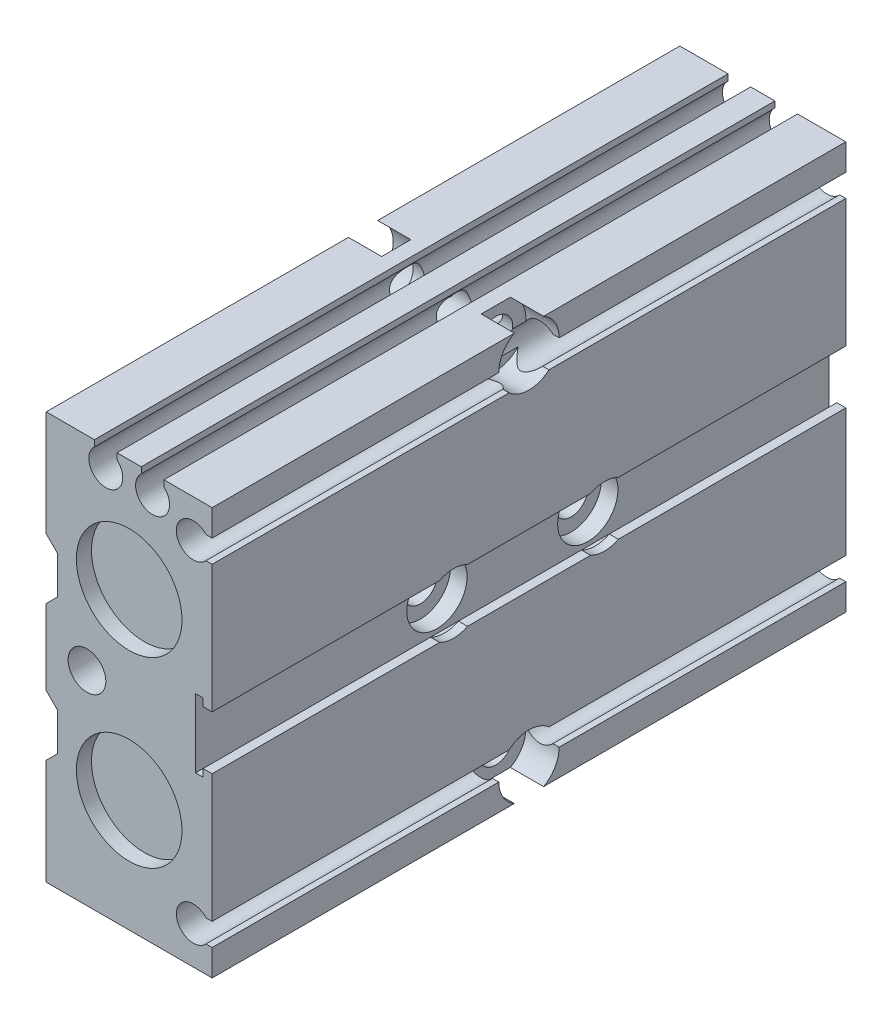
ISO-10303-21;
HEADER;
FILE_DESCRIPTION(('STEP AP214'),'2;1');
FILE_NAME('part.step','',(''),(''),'','','');
FILE_SCHEMA(('AUTOMOTIVE_DESIGN { 1 0 10303 214 1 1 1 1 }'));
ENDSEC;
DATA;
#1=APPLICATION_CONTEXT('core data for automotive mechanical design processes');
#2=APPLICATION_PROTOCOL_DEFINITION('international standard','automotive_design',2000,#1);
#3=PRODUCT_CONTEXT('',#1,'mechanical');
#4=PRODUCT('Part','Part','',(#3));
#5=PRODUCT_RELATED_PRODUCT_CATEGORY('part','',(#4));
#6=PRODUCT_DEFINITION_FORMATION('','',#4);
#7=PRODUCT_DEFINITION_CONTEXT('part definition',#1,'design');
#8=PRODUCT_DEFINITION('design','',#6,#7);
#9=PRODUCT_DEFINITION_SHAPE('','',#8);
#10=(LENGTH_UNIT() NAMED_UNIT(*) SI_UNIT(.MILLI.,.METRE.));
#11=(NAMED_UNIT(*) PLANE_ANGLE_UNIT() SI_UNIT($,.RADIAN.));
#12=(NAMED_UNIT(*) SI_UNIT($,.STERADIAN.) SOLID_ANGLE_UNIT());
#13=UNCERTAINTY_MEASURE_WITH_UNIT(LENGTH_MEASURE(1.E-05),#10,'distance_accuracy_value','');
#14=(GEOMETRIC_REPRESENTATION_CONTEXT(3) GLOBAL_UNCERTAINTY_ASSIGNED_CONTEXT((#13)) GLOBAL_UNIT_ASSIGNED_CONTEXT((#10,
#11,#12)) REPRESENTATION_CONTEXT('',''));
#15=CARTESIAN_POINT('',(0.,0.,0.));
#16=DIRECTION('',(0.,0.,1.));
#17=DIRECTION('',(1.,0.,0.));
#18=AXIS2_PLACEMENT_3D('',#15,#16,#17);
#19=CARTESIAN_POINT('',(11.,0.,79.0000000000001));
#20=DIRECTION('',(-1.,0.,0.));
#21=DIRECTION('',(0.,0.,1.));
#22=AXIS2_PLACEMENT_3D('',#19,#20,#21);
#23=CYLINDRICAL_SURFACE('',#22,2.25);
#24=CARTESIAN_POINT('',(6.6,0.,79.0000000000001));
#25=DIRECTION('',(-1.,0.,0.));
#26=DIRECTION('',(0.,0.,1.));
#27=AXIS2_PLACEMENT_3D('',#24,#25,#26);
#28=CIRCLE('',#27,2.25);
#29=CARTESIAN_POINT('',(6.6,0.,81.2500000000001));
#30=VERTEX_POINT('',#29);
#31=EDGE_CURVE('E567',#30,#30,#28,.F.);
#32=ORIENTED_EDGE('',*,*,#31,.T.);
#33=EDGE_LOOP('',(#32));
#34=FACE_BOUND('',#33,.T.);
#35=CARTESIAN_POINT('',(-6.6,0.,79.0000000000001));
#36=DIRECTION('',(-1.,0.,0.));
#37=DIRECTION('',(0.,0.,1.));
#38=AXIS2_PLACEMENT_3D('',#35,#36,#37);
#39=CIRCLE('',#38,2.25);
#40=CARTESIAN_POINT('',(-6.6,0.,81.2500000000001));
#41=VERTEX_POINT('',#40);
#42=EDGE_CURVE('E39',#41,#41,#39,.T.);
#43=ORIENTED_EDGE('',*,*,#42,.T.);
#44=EDGE_LOOP('',(#43));
#45=FACE_BOUND('',#44,.T.);
#46=ADVANCED_FACE('F35',(#34,#45),#23,.F.);
#47=CARTESIAN_POINT('',(11.,0.,99.0000000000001));
#48=DIRECTION('',(-1.,0.,0.));
#49=DIRECTION('',(0.,0.,1.));
#50=AXIS2_PLACEMENT_3D('',#47,#48,#49);
#51=CYLINDRICAL_SURFACE('',#50,2.25);
#52=CARTESIAN_POINT('',(6.6,0.,99.0000000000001));
#53=DIRECTION('',(-1.,0.,0.));
#54=DIRECTION('',(0.,0.,1.));
#55=AXIS2_PLACEMENT_3D('',#52,#53,#54);
#56=CIRCLE('',#55,2.25);
#57=CARTESIAN_POINT('',(6.6,0.,101.25));
#58=VERTEX_POINT('',#57);
#59=EDGE_CURVE('E555',#58,#58,#56,.F.);
#60=ORIENTED_EDGE('',*,*,#59,.T.);
#61=EDGE_LOOP('',(#60));
#62=FACE_BOUND('',#61,.T.);
#63=CARTESIAN_POINT('',(-6.6,0.,99.0000000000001));
#64=DIRECTION('',(-1.,0.,0.));
#65=DIRECTION('',(0.,0.,1.));
#66=AXIS2_PLACEMENT_3D('',#63,#64,#65);
#67=CIRCLE('',#66,2.25);
#68=CARTESIAN_POINT('',(-6.6,0.,101.25));
#69=VERTEX_POINT('',#68);
#70=EDGE_CURVE('E578',#69,#69,#67,.T.);
#71=ORIENTED_EDGE('',*,*,#70,.T.);
#72=EDGE_LOOP('',(#71));
#73=FACE_BOUND('',#72,.T.);
#74=ADVANCED_FACE('F2172',(#62,#73),#51,.F.);
#75=CARTESIAN_POINT('',(0.,12.1,7.));
#76=DIRECTION('',(0.,0.,1.));
#77=DIRECTION('',(1.,0.,0.));
#78=AXIS2_PLACEMENT_3D('',#75,#76,#77);
#79=CYLINDRICAL_SURFACE('',#78,4.);
#80=CARTESIAN_POINT('',(0.,12.1,47.));
#81=DIRECTION('',(0.,0.,1.));
#82=DIRECTION('',(1.,0.,0.));
#83=AXIS2_PLACEMENT_3D('',#80,#81,#82);
#84=CIRCLE('',#83,4.);
#85=CARTESIAN_POINT('',(4.,12.1,47.));
#86=VERTEX_POINT('',#85);
#87=EDGE_CURVE('E1323',#86,#86,#84,.F.);
#88=ORIENTED_EDGE('',*,*,#87,.F.);
#89=EDGE_LOOP('',(#88));
#90=FACE_BOUND('',#89,.T.);
#91=CARTESIAN_POINT('',(0.,12.1,49.));
#92=DIRECTION('',(0.,0.,1.));
#93=DIRECTION('',(1.,0.,0.));
#94=AXIS2_PLACEMENT_3D('',#91,#92,#93);
#95=CIRCLE('',#94,4.);
#96=CARTESIAN_POINT('',(4.,12.1,49.));
#97=VERTEX_POINT('',#96);
#98=EDGE_CURVE('E545',#97,#97,#95,.F.);
#99=ORIENTED_EDGE('',*,*,#98,.T.);
#100=EDGE_LOOP('',(#99));
#101=FACE_BOUND('',#100,.T.);
#102=ADVANCED_FACE('F2181',(#90,#101),#79,.T.);
#103=CARTESIAN_POINT('',(0.,-12.1,7.));
#104=DIRECTION('',(0.,0.,1.));
#105=DIRECTION('',(1.,0.,0.));
#106=AXIS2_PLACEMENT_3D('',#103,#104,#105);
#107=CYLINDRICAL_SURFACE('',#106,4.);
#108=CARTESIAN_POINT('',(0.,-12.1,47.));
#109=DIRECTION('',(0.,0.,1.));
#110=DIRECTION('',(1.,0.,0.));
#111=AXIS2_PLACEMENT_3D('',#108,#109,#110);
#112=CIRCLE('',#111,4.);
#113=CARTESIAN_POINT('',(4.,-12.1,47.));
#114=VERTEX_POINT('',#113);
#115=EDGE_CURVE('E1327',#114,#114,#112,.F.);
#116=ORIENTED_EDGE('',*,*,#115,.F.);
#117=EDGE_LOOP('',(#116));
#118=FACE_BOUND('',#117,.T.);
#119=CARTESIAN_POINT('',(0.,-12.1,49.));
#120=DIRECTION('',(0.,0.,1.));
#121=DIRECTION('',(1.,0.,0.));
#122=AXIS2_PLACEMENT_3D('',#119,#120,#121);
#123=CIRCLE('',#122,4.);
#124=CARTESIAN_POINT('',(4.,-12.1,49.));
#125=VERTEX_POINT('',#124);
#126=EDGE_CURVE('E1304',#125,#125,#123,.F.);
#127=ORIENTED_EDGE('',*,*,#126,.T.);
#128=EDGE_LOOP('',(#127));
#129=FACE_BOUND('',#128,.T.);
#130=ADVANCED_FACE('F2332',(#118,#129),#107,.T.);
#131=CARTESIAN_POINT('',(-5.,0.,69.));
#132=DIRECTION('',(1.,0.,0.));
#133=DIRECTION('',(0.,0.,-1.));
#134=AXIS2_PLACEMENT_3D('',#131,#132,#133);
#135=PLANE('',#134);
#136=CARTESIAN_POINT('',(-5.,0.,69.));
#137=DIRECTION('',(1.,0.,0.));
#138=DIRECTION('',(0.,0.,-1.));
#139=AXIS2_PLACEMENT_3D('',#136,#137,#138);
#140=CIRCLE('',#139,2.5);
#141=CARTESIAN_POINT('',(-5.,0.,66.5));
#142=VERTEX_POINT('',#141);
#143=EDGE_CURVE('E451',#142,#142,#140,.F.);
#144=ORIENTED_EDGE('',*,*,#143,.T.);
#145=EDGE_LOOP('',(#144));
#146=FACE_BOUND('',#145,.T.);
#147=ADVANCED_FACE('F1498',(#146),#135,.F.);
#148=CARTESIAN_POINT('',(-5.,0.,109.));
#149=DIRECTION('',(1.,0.,0.));
#150=DIRECTION('',(0.,0.,-1.));
#151=AXIS2_PLACEMENT_3D('',#148,#149,#150);
#152=PLANE('',#151);
#153=CARTESIAN_POINT('',(-5.,0.,109.));
#154=DIRECTION('',(1.,0.,0.));
#155=DIRECTION('',(0.,0.,-1.));
#156=AXIS2_PLACEMENT_3D('',#153,#154,#155);
#157=CIRCLE('',#156,2.5);
#158=CARTESIAN_POINT('',(-5.,0.,106.5));
#159=VERTEX_POINT('',#158);
#160=EDGE_CURVE('E1493',#159,#159,#157,.F.);
#161=ORIENTED_EDGE('',*,*,#160,.T.);
#162=EDGE_LOOP('',(#161));
#163=FACE_BOUND('',#162,.T.);
#164=ADVANCED_FACE('F2416',(#163),#152,.F.);
#165=CARTESIAN_POINT('',(-6.6,4.08,74.9200000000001));
#166=DIRECTION('',(1.,0.,0.));
#167=DIRECTION('',(0.,0.,1.));
#168=AXIS2_PLACEMENT_3D('',#165,#166,#167);
#169=PLANE('',#168);
#170=ORIENTED_EDGE('',*,*,#42,.F.);
#171=EDGE_LOOP('',(#170));
#172=FACE_BOUND('',#171,.T.);
#173=CARTESIAN_POINT('',(-6.6,0.,79.0000000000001));
#174=DIRECTION('',(1.,0.,0.));
#175=DIRECTION('',(0.,0.,-1.));
#176=AXIS2_PLACEMENT_3D('',#173,#174,#175);
#177=CIRCLE('',#176,4.00000000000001);
#178=CARTESIAN_POINT('',(-6.6,0.,75.0000000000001));
#179=VERTEX_POINT('',#178);
#180=EDGE_CURVE('E1490',#179,#179,#177,.F.);
#181=ORIENTED_EDGE('',*,*,#180,.T.);
#182=EDGE_LOOP('',(#181));
#183=FACE_BOUND('',#182,.T.);
#184=ADVANCED_FACE('F2420',(#172,#183),#169,.F.);
#185=CARTESIAN_POINT('',(-6.6,4.08,94.9200000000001));
#186=DIRECTION('',(1.,0.,0.));
#187=DIRECTION('',(0.,0.,1.));
#188=AXIS2_PLACEMENT_3D('',#185,#186,#187);
#189=PLANE('',#188);
#190=ORIENTED_EDGE('',*,*,#70,.F.);
#191=EDGE_LOOP('',(#190));
#192=FACE_BOUND('',#191,.T.);
#193=CARTESIAN_POINT('',(-6.6,0.,99.0000000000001));
#194=DIRECTION('',(1.,0.,0.));
#195=DIRECTION('',(0.,0.,-1.));
#196=AXIS2_PLACEMENT_3D('',#193,#194,#195);
#197=CIRCLE('',#196,4.00000000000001);
#198=CARTESIAN_POINT('',(-6.6,0.,95.0000000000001));
#199=VERTEX_POINT('',#198);
#200=EDGE_CURVE('E1487',#199,#199,#197,.F.);
#201=ORIENTED_EDGE('',*,*,#200,.T.);
#202=EDGE_LOOP('',(#201));
#203=FACE_BOUND('',#202,.T.);
#204=ADVANCED_FACE('F1711',(#192,#203),#189,.F.);
#205=CARTESIAN_POINT('',(9.8,-3.55,47.));
#206=DIRECTION('',(1.,0.,0.));
#207=DIRECTION('',(0.,0.,-1.));
#208=AXIS2_PLACEMENT_3D('',#205,#206,#207);
#209=PLANE('',#208);
#210=DIRECTION('',(0.,0.,-1.));
#211=VECTOR('',#210,1.);
#212=CARTESIAN_POINT('',(9.8,-3.55,47.));
#213=LINE('',#212,#211);
#214=CARTESIAN_POINT('',(9.8,-3.55,77.1567691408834));
#215=VERTEX_POINT('',#214);
#216=CARTESIAN_POINT('',(9.8,-3.55,47.));
#217=VERTEX_POINT('',#216);
#218=EDGE_CURVE('E558',#215,#217,#213,.T.);
#219=ORIENTED_EDGE('',*,*,#218,.T.);
#220=DIRECTION('',(0.,1.,0.));
#221=VECTOR('',#220,1.);
#222=CARTESIAN_POINT('',(9.8,-3.55,47.));
#223=LINE('',#222,#221);
#224=CARTESIAN_POINT('',(9.8,-4.55,47.));
#225=VERTEX_POINT('',#224);
#226=EDGE_CURVE('E565',#225,#217,#223,.T.);
#227=ORIENTED_EDGE('',*,*,#226,.F.);
#228=DIRECTION('',(0.,0.,-1.));
#229=VECTOR('',#228,1.);
#230=CARTESIAN_POINT('',(9.8,-4.55,47.));
#231=LINE('',#230,#229);
#232=CARTESIAN_POINT('',(9.8,-4.55,131.));
#233=VERTEX_POINT('',#232);
#234=EDGE_CURVE('E603',#225,#233,#231,.F.);
#235=ORIENTED_EDGE('',*,*,#234,.T.);
#236=DIRECTION('',(0.,1.,0.));
#237=VECTOR('',#236,1.);
#238=CARTESIAN_POINT('',(9.8,-3.55,131.));
#239=LINE('',#238,#237);
#240=CARTESIAN_POINT('',(9.8,-3.55,131.));
#241=VERTEX_POINT('',#240);
#242=EDGE_CURVE('E568',#241,#233,#239,.F.);
#243=ORIENTED_EDGE('',*,*,#242,.F.);
#244=DIRECTION('',(0.,0.,-1.));
#245=VECTOR('',#244,1.);
#246=CARTESIAN_POINT('',(9.8,-3.55,47.));
#247=LINE('',#246,#245);
#248=CARTESIAN_POINT('',(9.8,-3.55,100.843230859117));
#249=VERTEX_POINT('',#248);
#250=EDGE_CURVE('E571',#241,#249,#247,.T.);
#251=ORIENTED_EDGE('',*,*,#250,.T.);
#252=CARTESIAN_POINT('',(9.8,0.,99.0000000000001));
#253=DIRECTION('',(-1.,0.,0.));
#254=DIRECTION('',(0.,0.,1.));
#255=AXIS2_PLACEMENT_3D('',#252,#253,#254);
#256=CIRCLE('',#255,4.);
#257=CARTESIAN_POINT('',(9.8,-3.55,97.1567691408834));
#258=VERTEX_POINT('',#257);
#259=EDGE_CURVE('E1299',#249,#258,#256,.F.);
#260=ORIENTED_EDGE('',*,*,#259,.T.);
#261=DIRECTION('',(0.,0.,-1.));
#262=VECTOR('',#261,1.);
#263=CARTESIAN_POINT('',(9.8,-3.55,47.));
#264=LINE('',#263,#262);
#265=CARTESIAN_POINT('',(9.8,-3.55,80.8432308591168));
#266=VERTEX_POINT('',#265);
#267=EDGE_CURVE('E581',#258,#266,#264,.T.);
#268=ORIENTED_EDGE('',*,*,#267,.T.);
#269=CARTESIAN_POINT('',(9.8,0.,79.0000000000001));
#270=DIRECTION('',(-1.,0.,0.));
#271=DIRECTION('',(0.,0.,1.));
#272=AXIS2_PLACEMENT_3D('',#269,#270,#271);
#273=CIRCLE('',#272,4.);
#274=EDGE_CURVE('E584',#266,#215,#273,.F.);
#275=ORIENTED_EDGE('',*,*,#274,.T.);
#276=EDGE_LOOP('',(#219,#227,#235,#243,#251,#260,#268,#275));
#277=FACE_BOUND('',#276,.T.);
#278=ADVANCED_FACE('F1634',(#277),#209,.F.);
#279=CARTESIAN_POINT('',(6.6,0.,79.0000000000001));
#280=DIRECTION('',(-1.,0.,0.));
#281=DIRECTION('',(0.,0.,1.));
#282=AXIS2_PLACEMENT_3D('',#279,#280,#281);
#283=PLANE('',#282);
#284=ORIENTED_EDGE('',*,*,#31,.F.);
#285=EDGE_LOOP('',(#284));
#286=FACE_BOUND('',#285,.T.);
#287=CARTESIAN_POINT('',(6.6,0.,79.0000000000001));
#288=DIRECTION('',(-1.,0.,0.));
#289=DIRECTION('',(0.,0.,1.));
#290=AXIS2_PLACEMENT_3D('',#287,#288,#289);
#291=CIRCLE('',#290,4.);
#292=CARTESIAN_POINT('',(6.6,0.,83.0000000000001));
#293=VERTEX_POINT('',#292);
#294=EDGE_CURVE('E613',#293,#293,#291,.F.);
#295=ORIENTED_EDGE('',*,*,#294,.T.);
#296=EDGE_LOOP('',(#295));
#297=FACE_BOUND('',#296,.T.);
#298=ADVANCED_FACE('F2192',(#286,#297),#283,.F.);
#299=CARTESIAN_POINT('',(6.6,0.,99.0000000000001));
#300=DIRECTION('',(-1.,0.,0.));
#301=DIRECTION('',(0.,0.,1.));
#302=AXIS2_PLACEMENT_3D('',#299,#300,#301);
#303=PLANE('',#302);
#304=ORIENTED_EDGE('',*,*,#59,.F.);
#305=EDGE_LOOP('',(#304));
#306=FACE_BOUND('',#305,.T.);
#307=CARTESIAN_POINT('',(6.6,0.,99.0000000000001));
#308=DIRECTION('',(-1.,0.,0.));
#309=DIRECTION('',(0.,0.,1.));
#310=AXIS2_PLACEMENT_3D('',#307,#308,#309);
#311=CIRCLE('',#310,4.);
#312=CARTESIAN_POINT('',(6.6,0.,103.));
#313=VERTEX_POINT('',#312);
#314=EDGE_CURVE('E1479',#313,#313,#311,.F.);
#315=ORIENTED_EDGE('',*,*,#314,.T.);
#316=EDGE_LOOP('',(#315));
#317=FACE_BOUND('',#316,.T.);
#318=ADVANCED_FACE('F2188',(#306,#317),#303,.F.);
#319=CARTESIAN_POINT('',(9.7997725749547,4.55,47.));
#320=DIRECTION('',(1.,0.,0.));
#321=DIRECTION('',(0.,0.,-1.));
#322=AXIS2_PLACEMENT_3D('',#319,#320,#321);
#323=PLANE('',#322);
#324=DIRECTION('',(0.,0.,1.));
#325=VECTOR('',#324,1.);
#326=CARTESIAN_POINT('',(9.7997725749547,3.55,47.));
#327=LINE('',#326,#325);
#328=CARTESIAN_POINT('',(9.7997725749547,3.55,80.8432308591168));
#329=VERTEX_POINT('',#328);
#330=CARTESIAN_POINT('',(9.7997725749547,3.55,97.1567691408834));
#331=VERTEX_POINT('',#330);
#332=EDGE_CURVE('E532',#329,#331,#327,.T.);
#333=ORIENTED_EDGE('',*,*,#332,.T.);
#334=CARTESIAN_POINT('',(9.7997725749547,0.,99.0000000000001));
#335=DIRECTION('',(-1.,0.,0.));
#336=DIRECTION('',(0.,0.,1.));
#337=AXIS2_PLACEMENT_3D('',#334,#335,#336);
#338=CIRCLE('',#337,4.);
#339=CARTESIAN_POINT('',(9.7997725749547,3.55,100.843230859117));
#340=VERTEX_POINT('',#339);
#341=EDGE_CURVE('E1249',#331,#340,#338,.F.);
#342=ORIENTED_EDGE('',*,*,#341,.T.);
#343=DIRECTION('',(0.,0.,1.));
#344=VECTOR('',#343,1.);
#345=CARTESIAN_POINT('',(9.7997725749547,3.55,47.));
#346=LINE('',#345,#344);
#347=CARTESIAN_POINT('',(9.7997725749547,3.55,131.));
#348=VERTEX_POINT('',#347);
#349=EDGE_CURVE('E536',#340,#348,#346,.T.);
#350=ORIENTED_EDGE('',*,*,#349,.T.);
#351=DIRECTION('',(0.,1.,0.));
#352=VECTOR('',#351,1.);
#353=CARTESIAN_POINT('',(9.7997725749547,4.55,131.));
#354=LINE('',#353,#352);
#355=CARTESIAN_POINT('',(9.7997725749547,4.55,131.));
#356=VERTEX_POINT('',#355);
#357=EDGE_CURVE('E543',#356,#348,#354,.F.);
#358=ORIENTED_EDGE('',*,*,#357,.F.);
#359=DIRECTION('',(0.,0.,1.));
#360=VECTOR('',#359,1.);
#361=CARTESIAN_POINT('',(9.7997725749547,4.55,47.));
#362=LINE('',#361,#360);
#363=CARTESIAN_POINT('',(9.7997725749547,4.55,47.));
#364=VERTEX_POINT('',#363);
#365=EDGE_CURVE('E592',#356,#364,#362,.F.);
#366=ORIENTED_EDGE('',*,*,#365,.T.);
#367=DIRECTION('',(0.,1.,0.));
#368=VECTOR('',#367,1.);
#369=CARTESIAN_POINT('',(9.7997725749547,4.55,47.));
#370=LINE('',#369,#368);
#371=CARTESIAN_POINT('',(9.7997725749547,3.55,47.));
#372=VERTEX_POINT('',#371);
#373=EDGE_CURVE('E546',#372,#364,#370,.T.);
#374=ORIENTED_EDGE('',*,*,#373,.F.);
#375=DIRECTION('',(0.,0.,1.));
#376=VECTOR('',#375,1.);
#377=CARTESIAN_POINT('',(9.7997725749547,3.55,47.));
#378=LINE('',#377,#376);
#379=CARTESIAN_POINT('',(9.7997725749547,3.55,77.1567691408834));
#380=VERTEX_POINT('',#379);
#381=EDGE_CURVE('E549',#372,#380,#378,.T.);
#382=ORIENTED_EDGE('',*,*,#381,.T.);
#383=CARTESIAN_POINT('',(9.7997725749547,0.,79.0000000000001));
#384=DIRECTION('',(-1.,0.,0.));
#385=DIRECTION('',(0.,0.,1.));
#386=AXIS2_PLACEMENT_3D('',#383,#384,#385);
#387=CIRCLE('',#386,4.);
#388=EDGE_CURVE('E1265',#380,#329,#387,.F.);
#389=ORIENTED_EDGE('',*,*,#388,.T.);
#390=EDGE_LOOP('',(#333,#342,#350,#358,#366,#374,#382,#389));
#391=FACE_BOUND('',#390,.T.);
#392=ADVANCED_FACE('F1657',(#391),#323,.F.);
#393=CARTESIAN_POINT('',(0.,12.1,49.));
#394=DIRECTION('',(0.,0.,1.));
#395=DIRECTION('',(1.,0.,0.));
#396=AXIS2_PLACEMENT_3D('',#393,#394,#395);
#397=PLANE('',#396);
#398=ORIENTED_EDGE('',*,*,#98,.F.);
#399=EDGE_LOOP('',(#398));
#400=FACE_BOUND('',#399,.T.);
#401=CARTESIAN_POINT('',(0.,12.1,49.));
#402=DIRECTION('',(0.,0.,1.));
#403=DIRECTION('',(1.,0.,0.));
#404=AXIS2_PLACEMENT_3D('',#401,#402,#403);
#405=CIRCLE('',#404,7.);
#406=CARTESIAN_POINT('',(7.,12.1,49.));
#407=VERTEX_POINT('',#406);
#408=EDGE_CURVE('E1135',#407,#407,#405,.F.);
#409=ORIENTED_EDGE('',*,*,#408,.T.);
#410=EDGE_LOOP('',(#409));
#411=FACE_BOUND('',#410,.T.);
#412=ADVANCED_FACE('F1707',(#400,#411),#397,.F.);
#413=CARTESIAN_POINT('',(0.,-12.1,49.));
#414=DIRECTION('',(0.,0.,1.));
#415=DIRECTION('',(1.,0.,0.));
#416=AXIS2_PLACEMENT_3D('',#413,#414,#415);
#417=PLANE('',#416);
#418=ORIENTED_EDGE('',*,*,#126,.F.);
#419=EDGE_LOOP('',(#418));
#420=FACE_BOUND('',#419,.T.);
#421=CARTESIAN_POINT('',(0.,-12.1,49.));
#422=DIRECTION('',(0.,0.,1.));
#423=DIRECTION('',(1.,0.,0.));
#424=AXIS2_PLACEMENT_3D('',#421,#422,#423);
#425=CIRCLE('',#424,7.);
#426=CARTESIAN_POINT('',(7.,-12.1,49.));
#427=VERTEX_POINT('',#426);
#428=EDGE_CURVE('E920',#427,#427,#425,.F.);
#429=ORIENTED_EDGE('',*,*,#428,.T.);
#430=EDGE_LOOP('',(#429));
#431=FACE_BOUND('',#430,.T.);
#432=ADVANCED_FACE('F1701',(#420,#431),#417,.F.);
#433=CARTESIAN_POINT('',(-6.6,27.,84.92));
#434=DIRECTION('',(1.,0.,0.));
#435=DIRECTION('',(0.,0.,1.));
#436=AXIS2_PLACEMENT_3D('',#433,#434,#435);
#437=PLANE('',#436);
#438=CARTESIAN_POINT('',(-6.6,23.5,89.));
#439=DIRECTION('',(-1.,0.,0.));
#440=DIRECTION('',(0.,0.,1.));
#441=AXIS2_PLACEMENT_3D('',#438,#439,#440);
#442=CIRCLE('',#441,2.25);
#443=CARTESIAN_POINT('',(-6.6,23.5,91.25));
#444=VERTEX_POINT('',#443);
#445=EDGE_CURVE('E517',#444,#444,#442,.F.);
#446=ORIENTED_EDGE('',*,*,#445,.T.);
#447=EDGE_LOOP('',(#446));
#448=FACE_BOUND('',#447,.T.);
#449=CARTESIAN_POINT('',(-6.6,23.5,89.));
#450=DIRECTION('',(1.,0.,0.));
#451=DIRECTION('',(0.,0.,-1.));
#452=AXIS2_PLACEMENT_3D('',#449,#450,#451);
#453=CIRCLE('',#452,3.99999999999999);
#454=CARTESIAN_POINT('',(-6.6,27.,87.0635083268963));
#455=VERTEX_POINT('',#454);
#456=CARTESIAN_POINT('',(-6.6,27.,90.9364916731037));
#457=VERTEX_POINT('',#456);
#458=EDGE_CURVE('E444',#455,#457,#453,.F.);
#459=ORIENTED_EDGE('',*,*,#458,.T.);
#460=DIRECTION('',(0.,0.,1.));
#461=VECTOR('',#460,1.);
#462=CARTESIAN_POINT('',(-6.60000000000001,27.,47.));
#463=LINE('',#462,#461);
#464=EDGE_CURVE('E449',#455,#457,#463,.T.);
#465=ORIENTED_EDGE('',*,*,#464,.F.);
#466=EDGE_LOOP('',(#459,#465));
#467=FACE_BOUND('',#466,.T.);
#468=ADVANCED_FACE('F447',(#448,#467),#437,.F.);
#469=CARTESIAN_POINT('',(-4.6074375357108,26.1703688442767,47.));
#470=DIRECTION('',(-1.,0.,0.));
#471=DIRECTION('',(0.,0.,1.));
#472=AXIS2_PLACEMENT_3D('',#469,#470,#471);
#473=PLANE('',#472);
#474=DIRECTION('',(0.,0.,1.));
#475=VECTOR('',#474,1.);
#476=CARTESIAN_POINT('',(-4.6074375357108,26.1703688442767,47.));
#477=LINE('',#476,#475);
#478=CARTESIAN_POINT('',(-4.6074375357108,26.1703688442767,131.));
#479=VERTEX_POINT('',#478);
#480=CARTESIAN_POINT('',(-4.6074375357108,26.1703688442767,47.));
#481=VERTEX_POINT('',#480);
#482=EDGE_CURVE('E918',#479,#481,#477,.F.);
#483=ORIENTED_EDGE('',*,*,#482,.T.);
#484=DIRECTION('',(0.,1.,0.));
#485=VECTOR('',#484,1.);
#486=CARTESIAN_POINT('',(-4.6074375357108,26.1703688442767,47.));
#487=LINE('',#486,#485);
#488=CARTESIAN_POINT('',(-4.6074375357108,27.,47.));
#489=VERTEX_POINT('',#488);
#490=EDGE_CURVE('E1302',#489,#481,#487,.F.);
#491=ORIENTED_EDGE('',*,*,#490,.F.);
#492=DIRECTION('',(0.,0.,1.));
#493=VECTOR('',#492,1.);
#494=CARTESIAN_POINT('',(-4.6074375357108,27.,47.));
#495=LINE('',#494,#493);
#496=CARTESIAN_POINT('',(-4.6074375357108,27.,131.));
#497=VERTEX_POINT('',#496);
#498=EDGE_CURVE('E461',#497,#489,#495,.F.);
#499=ORIENTED_EDGE('',*,*,#498,.F.);
#500=DIRECTION('',(0.,1.,0.));
#501=VECTOR('',#500,1.);
#502=CARTESIAN_POINT('',(-4.6074375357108,26.1703688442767,131.));
#503=LINE('',#502,#501);
#504=EDGE_CURVE('E452',#479,#497,#503,.T.);
#505=ORIENTED_EDGE('',*,*,#504,.F.);
#506=EDGE_LOOP('',(#483,#491,#499,#505));
#507=FACE_BOUND('',#506,.T.);
#508=ADVANCED_FACE('F1512',(#507),#473,.F.);
#509=CARTESIAN_POINT('',(-11.,23.5,89.));
#510=DIRECTION('',(1.,0.,0.));
#511=DIRECTION('',(0.,0.,-1.));
#512=AXIS2_PLACEMENT_3D('',#509,#510,#511);
#513=CYLINDRICAL_SURFACE('',#512,3.99999999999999);
#514=CARTESIAN_POINT('',(-11.,23.5,89.));
#515=DIRECTION('',(1.,0.,0.));
#516=DIRECTION('',(0.,0.,-1.));
#517=AXIS2_PLACEMENT_3D('',#514,#515,#516);
#518=CIRCLE('',#517,3.99999999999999);
#519=CARTESIAN_POINT('',(-11.,27.,90.9364916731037));
#520=VERTEX_POINT('',#519);
#521=CARTESIAN_POINT('',(-11.,27.,87.0635083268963));
#522=VERTEX_POINT('',#521);
#523=EDGE_CURVE('E458',#520,#522,#518,.T.);
#524=ORIENTED_EDGE('',*,*,#523,.F.);
#525=DIRECTION('',(1.,0.,0.));
#526=VECTOR('',#525,1.);
#527=CARTESIAN_POINT('',(-11.,27.,90.9364916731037));
#528=LINE('',#527,#526);
#529=EDGE_CURVE('E455',#457,#520,#528,.F.);
#530=ORIENTED_EDGE('',*,*,#529,.F.);
#531=ORIENTED_EDGE('',*,*,#458,.F.);
#532=DIRECTION('',(1.,0.,0.));
#533=VECTOR('',#532,1.);
#534=CARTESIAN_POINT('',(-11.,27.,87.0635083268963));
#535=LINE('',#534,#533);
#536=EDGE_CURVE('E465',#522,#455,#535,.T.);
#537=ORIENTED_EDGE('',*,*,#536,.F.);
#538=EDGE_LOOP('',(#524,#530,#531,#537));
#539=FACE_BOUND('',#538,.T.);
#540=ADVANCED_FACE('F456',(#539),#513,.F.);
#541=CARTESIAN_POINT('',(-11.,0.,69.));
#542=DIRECTION('',(1.,0.,0.));
#543=DIRECTION('',(0.,0.,-1.));
#544=AXIS2_PLACEMENT_3D('',#541,#542,#543);
#545=CYLINDRICAL_SURFACE('',#544,2.5);
#546=CARTESIAN_POINT('',(-11.,0.,69.));
#547=DIRECTION('',(1.,0.,0.));
#548=DIRECTION('',(0.,0.,-1.));
#549=AXIS2_PLACEMENT_3D('',#546,#547,#548);
#550=CIRCLE('',#549,2.5);
#551=CARTESIAN_POINT('',(-11.,0.,66.5));
#552=VERTEX_POINT('',#551);
#553=EDGE_CURVE('E906',#552,#552,#550,.T.);
#554=ORIENTED_EDGE('',*,*,#553,.F.);
#555=EDGE_LOOP('',(#554));
#556=FACE_BOUND('',#555,.T.);
#557=ORIENTED_EDGE('',*,*,#143,.F.);
#558=EDGE_LOOP('',(#557));
#559=FACE_BOUND('',#558,.T.);
#560=ADVANCED_FACE('F1500',(#556,#559),#545,.F.);
#561=CARTESIAN_POINT('',(-11.,0.,109.));
#562=DIRECTION('',(1.,0.,0.));
#563=DIRECTION('',(0.,0.,-1.));
#564=AXIS2_PLACEMENT_3D('',#561,#562,#563);
#565=CYLINDRICAL_SURFACE('',#564,2.5);
#566=CARTESIAN_POINT('',(-11.,0.,109.));
#567=DIRECTION('',(1.,0.,0.));
#568=DIRECTION('',(0.,0.,-1.));
#569=AXIS2_PLACEMENT_3D('',#566,#567,#568);
#570=CIRCLE('',#569,2.5);
#571=CARTESIAN_POINT('',(-11.,0.,106.5));
#572=VERTEX_POINT('',#571);
#573=EDGE_CURVE('E903',#572,#572,#570,.T.);
#574=ORIENTED_EDGE('',*,*,#573,.F.);
#575=EDGE_LOOP('',(#574));
#576=FACE_BOUND('',#575,.T.);
#577=ORIENTED_EDGE('',*,*,#160,.F.);
#578=EDGE_LOOP('',(#577));
#579=FACE_BOUND('',#578,.T.);
#580=ADVANCED_FACE('F1502',(#576,#579),#565,.F.);
#581=CARTESIAN_POINT('',(-11.,0.,79.0000000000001));
#582=DIRECTION('',(1.,0.,0.));
#583=DIRECTION('',(0.,0.,-1.));
#584=AXIS2_PLACEMENT_3D('',#581,#582,#583);
#585=CYLINDRICAL_SURFACE('',#584,4.00000000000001);
#586=CARTESIAN_POINT('',(-11.,0.,79.0000000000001));
#587=DIRECTION('',(1.,0.,0.));
#588=DIRECTION('',(0.,0.,-1.));
#589=AXIS2_PLACEMENT_3D('',#586,#587,#588);
#590=CIRCLE('',#589,4.00000000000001);
#591=CARTESIAN_POINT('',(-11.,0.,75.0000000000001));
#592=VERTEX_POINT('',#591);
#593=EDGE_CURVE('E900',#592,#592,#590,.T.);
#594=ORIENTED_EDGE('',*,*,#593,.F.);
#595=EDGE_LOOP('',(#594));
#596=FACE_BOUND('',#595,.T.);
#597=ORIENTED_EDGE('',*,*,#180,.F.);
#598=EDGE_LOOP('',(#597));
#599=FACE_BOUND('',#598,.T.);
#600=ADVANCED_FACE('F1509',(#596,#599),#585,.F.);
#601=CARTESIAN_POINT('',(-11.,0.,99.0000000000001));
#602=DIRECTION('',(1.,0.,0.));
#603=DIRECTION('',(0.,0.,-1.));
#604=AXIS2_PLACEMENT_3D('',#601,#602,#603);
#605=CYLINDRICAL_SURFACE('',#604,4.00000000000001);
#606=CARTESIAN_POINT('',(-11.,0.,99.0000000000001));
#607=DIRECTION('',(1.,0.,0.));
#608=DIRECTION('',(0.,0.,-1.));
#609=AXIS2_PLACEMENT_3D('',#606,#607,#608);
#610=CIRCLE('',#609,4.00000000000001);
#611=CARTESIAN_POINT('',(-11.,0.,95.0000000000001));
#612=VERTEX_POINT('',#611);
#613=EDGE_CURVE('E896',#612,#612,#610,.T.);
#614=ORIENTED_EDGE('',*,*,#613,.F.);
#615=EDGE_LOOP('',(#614));
#616=FACE_BOUND('',#615,.T.);
#617=ORIENTED_EDGE('',*,*,#200,.F.);
#618=EDGE_LOOP('',(#617));
#619=FACE_BOUND('',#618,.T.);
#620=ADVANCED_FACE('F1716',(#616,#619),#605,.F.);
#621=CARTESIAN_POINT('',(6.6,-23.5,89.));
#622=DIRECTION('',(-1.,0.,0.));
#623=DIRECTION('',(0.,0.,1.));
#624=AXIS2_PLACEMENT_3D('',#621,#622,#623);
#625=PLANE('',#624);
#626=CARTESIAN_POINT('',(6.6,-23.5,89.));
#627=DIRECTION('',(-1.,0.,0.));
#628=DIRECTION('',(0.,0.,1.));
#629=AXIS2_PLACEMENT_3D('',#626,#627,#628);
#630=CIRCLE('',#629,4.);
#631=CARTESIAN_POINT('',(6.6,-20.7948029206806,86.0534921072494));
#632=VERTEX_POINT('',#631);
#633=CARTESIAN_POINT('',(6.6,-20.7948029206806,91.9465078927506));
#634=VERTEX_POINT('',#633);
#635=EDGE_CURVE('E1284',#632,#634,#630,.F.);
#636=ORIENTED_EDGE('',*,*,#635,.T.);
#637=DIRECTION('',(0.,0.,1.));
#638=VECTOR('',#637,1.);
#639=CARTESIAN_POINT('',(6.6,-20.7948029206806,47.));
#640=LINE('',#639,#638);
#641=EDGE_CURVE('E894',#634,#632,#640,.F.);
#642=ORIENTED_EDGE('',*,*,#641,.T.);
#643=EDGE_LOOP('',(#636,#642));
#644=FACE_BOUND('',#643,.T.);
#645=ADVANCED_FACE('F1719',(#644),#625,.F.);
#646=CARTESIAN_POINT('',(11.,0.,79.0000000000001));
#647=DIRECTION('',(-1.,0.,0.));
#648=DIRECTION('',(0.,0.,1.));
#649=AXIS2_PLACEMENT_3D('',#646,#647,#648);
#650=CYLINDRICAL_SURFACE('',#649,4.);
#651=CARTESIAN_POINT('',(11.,0.,79.0000000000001));
#652=DIRECTION('',(-1.,0.,0.));
#653=DIRECTION('',(0.,0.,1.));
#654=AXIS2_PLACEMENT_3D('',#651,#652,#653);
#655=CIRCLE('',#654,4.);
#656=CARTESIAN_POINT('',(11.,-3.55,77.1567691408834));
#657=VERTEX_POINT('',#656);
#658=CARTESIAN_POINT('',(11.,-3.55,80.8432308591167));
#659=VERTEX_POINT('',#658);
#660=EDGE_CURVE('E945',#657,#659,#655,.T.);
#661=ORIENTED_EDGE('',*,*,#660,.F.);
#662=DIRECTION('',(1.,0.,0.));
#663=VECTOR('',#662,1.);
#664=CARTESIAN_POINT('',(11.,-3.55,77.1567691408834));
#665=LINE('',#664,#663);
#666=EDGE_CURVE('E595',#657,#215,#665,.F.);
#667=ORIENTED_EDGE('',*,*,#666,.T.);
#668=ORIENTED_EDGE('',*,*,#274,.F.);
#669=DIRECTION('',(1.,0.,0.));
#670=VECTOR('',#669,1.);
#671=CARTESIAN_POINT('',(11.,-3.55,80.8432308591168));
#672=LINE('',#671,#670);
#673=EDGE_CURVE('E583',#266,#659,#672,.T.);
#674=ORIENTED_EDGE('',*,*,#673,.T.);
#675=EDGE_LOOP('',(#661,#667,#668,#674));
#676=FACE_BOUND('',#675,.T.);
#677=ADVANCED_FACE('F1765',(#676),#650,.F.);
#678=CARTESIAN_POINT('',(11.,-3.55,47.));
#679=DIRECTION('',(0.,-1.,0.));
#680=DIRECTION('',(0.,0.,-1.));
#681=AXIS2_PLACEMENT_3D('',#678,#679,#680);
#682=PLANE('',#681);
#683=ORIENTED_EDGE('',*,*,#267,.F.);
#684=DIRECTION('',(-1.,0.,0.));
#685=VECTOR('',#684,1.);
#686=CARTESIAN_POINT('',(11.,-3.55,97.1567691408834));
#687=LINE('',#686,#685);
#688=CARTESIAN_POINT('',(11.,-3.55,97.1567691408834));
#689=VERTEX_POINT('',#688);
#690=EDGE_CURVE('E1295',#258,#689,#687,.F.);
#691=ORIENTED_EDGE('',*,*,#690,.T.);
#692=DIRECTION('',(0.,0.,-1.));
#693=VECTOR('',#692,1.);
#694=CARTESIAN_POINT('',(11.,-3.55,47.));
#695=LINE('',#694,#693);
#696=EDGE_CURVE('E949',#659,#689,#695,.F.);
#697=ORIENTED_EDGE('',*,*,#696,.F.);
#698=ORIENTED_EDGE('',*,*,#673,.F.);
#699=EDGE_LOOP('',(#683,#691,#697,#698));
#700=FACE_BOUND('',#699,.T.);
#701=ADVANCED_FACE('F1770',(#700),#682,.F.);
#702=CARTESIAN_POINT('',(11.,0.,99.0000000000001));
#703=DIRECTION('',(-1.,0.,0.));
#704=DIRECTION('',(0.,0.,1.));
#705=AXIS2_PLACEMENT_3D('',#702,#703,#704);
#706=CYLINDRICAL_SURFACE('',#705,4.);
#707=CARTESIAN_POINT('',(11.,0.,99.0000000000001));
#708=DIRECTION('',(-1.,0.,0.));
#709=DIRECTION('',(0.,0.,1.));
#710=AXIS2_PLACEMENT_3D('',#707,#708,#709);
#711=CIRCLE('',#710,4.);
#712=CARTESIAN_POINT('',(11.,-3.55,100.843230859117));
#713=VERTEX_POINT('',#712);
#714=EDGE_CURVE('E950',#689,#713,#711,.T.);
#715=ORIENTED_EDGE('',*,*,#714,.F.);
#716=ORIENTED_EDGE('',*,*,#690,.F.);
#717=ORIENTED_EDGE('',*,*,#259,.F.);
#718=DIRECTION('',(1.,0.,0.));
#719=VECTOR('',#718,1.);
#720=CARTESIAN_POINT('',(11.,-3.55,100.843230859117));
#721=LINE('',#720,#719);
#722=EDGE_CURVE('E573',#249,#713,#721,.T.);
#723=ORIENTED_EDGE('',*,*,#722,.T.);
#724=EDGE_LOOP('',(#715,#716,#717,#723));
#725=FACE_BOUND('',#724,.T.);
#726=ADVANCED_FACE('F1776',(#725),#706,.F.);
#727=CARTESIAN_POINT('',(11.,-3.55,47.));
#728=DIRECTION('',(0.,-1.,0.));
#729=DIRECTION('',(0.,0.,-1.));
#730=AXIS2_PLACEMENT_3D('',#727,#728,#729);
#731=PLANE('',#730);
#732=ORIENTED_EDGE('',*,*,#250,.F.);
#733=DIRECTION('',(1.,0.,0.));
#734=VECTOR('',#733,1.);
#735=CARTESIAN_POINT('',(11.,-3.55,131.));
#736=LINE('',#735,#734);
#737=CARTESIAN_POINT('',(11.,-3.55,131.));
#738=VERTEX_POINT('',#737);
#739=EDGE_CURVE('E574',#738,#241,#736,.F.);
#740=ORIENTED_EDGE('',*,*,#739,.F.);
#741=DIRECTION('',(0.,0.,-1.));
#742=VECTOR('',#741,1.);
#743=CARTESIAN_POINT('',(11.,-3.55,47.));
#744=LINE('',#743,#742);
#745=EDGE_CURVE('E953',#713,#738,#744,.F.);
#746=ORIENTED_EDGE('',*,*,#745,.F.);
#747=ORIENTED_EDGE('',*,*,#722,.F.);
#748=EDGE_LOOP('',(#732,#740,#746,#747));
#749=FACE_BOUND('',#748,.T.);
#750=ADVANCED_FACE('F1631',(#749),#731,.F.);
#751=CARTESIAN_POINT('',(10.1770509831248,-20.5,47.));
#752=DIRECTION('',(0.,1.,0.));
#753=DIRECTION('',(0.,0.,1.));
#754=AXIS2_PLACEMENT_3D('',#751,#752,#753);
#755=PLANE('',#754);
#756=DIRECTION('',(0.,0.,-1.));
#757=VECTOR('',#756,1.);
#758=CARTESIAN_POINT('',(11.,-20.5,47.));
#759=LINE('',#758,#757);
#760=CARTESIAN_POINT('',(11.,-20.5,131.));
#761=VERTEX_POINT('',#760);
#762=CARTESIAN_POINT('',(11.,-20.5,91.6457513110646));
#763=VERTEX_POINT('',#762);
#764=EDGE_CURVE('E958',#761,#763,#759,.T.);
#765=ORIENTED_EDGE('',*,*,#764,.F.);
#766=DIRECTION('',(1.,0.,0.));
#767=VECTOR('',#766,1.);
#768=CARTESIAN_POINT('',(10.1770509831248,-20.5,131.));
#769=LINE('',#768,#767);
#770=CARTESIAN_POINT('',(10.1770509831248,-20.5,131.));
#771=VERTEX_POINT('',#770);
#772=EDGE_CURVE('E1285',#771,#761,#769,.T.);
#773=ORIENTED_EDGE('',*,*,#772,.F.);
#774=DIRECTION('',(0.,0.,1.));
#775=VECTOR('',#774,1.);
#776=CARTESIAN_POINT('',(10.1770509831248,-20.5,47.));
#777=LINE('',#776,#775);
#778=CARTESIAN_POINT('',(10.1770509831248,-20.5,91.6457513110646));
#779=VERTEX_POINT('',#778);
#780=EDGE_CURVE('E895',#771,#779,#777,.F.);
#781=ORIENTED_EDGE('',*,*,#780,.T.);
#782=DIRECTION('',(-1.,0.,0.));
#783=VECTOR('',#782,1.);
#784=CARTESIAN_POINT('',(11.,-20.5,91.6457513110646));
#785=LINE('',#784,#783);
#786=EDGE_CURVE('E1280',#779,#763,#785,.F.);
#787=ORIENTED_EDGE('',*,*,#786,.T.);
#788=EDGE_LOOP('',(#765,#773,#781,#787));
#789=FACE_BOUND('',#788,.T.);
#790=ADVANCED_FACE('F877',(#789),#755,.F.);
#791=CARTESIAN_POINT('',(11.,-23.5,89.));
#792=DIRECTION('',(-1.,0.,0.));
#793=DIRECTION('',(0.,0.,1.));
#794=AXIS2_PLACEMENT_3D('',#791,#792,#793);
#795=CYLINDRICAL_SURFACE('',#794,4.);
#796=CARTESIAN_POINT('',(10.1770509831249,-20.5,91.6457513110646));
#797=CARTESIAN_POINT('',(10.1286006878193,-20.4458804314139,91.5844015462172));
#798=CARTESIAN_POINT('',(10.077985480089,-20.3945184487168,91.5223527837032));
#799=CARTESIAN_POINT('',(9.97244557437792,-20.2971782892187,91.3975364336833));
#800=CARTESIAN_POINT('',(9.91751615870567,-20.2512061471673,91.3347681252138));
#801=CARTESIAN_POINT('',(9.80351388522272,-20.1646627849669,91.2093729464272));
#802=CARTESIAN_POINT('',(9.74444380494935,-20.1240879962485,91.1467460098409));
#803=CARTESIAN_POINT('',(9.62187850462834,-20.0483124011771,91.0226524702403));
#804=CARTESIAN_POINT('',(9.55838648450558,-20.0131077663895,90.9611850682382));
#805=CARTESIAN_POINT('',(9.43966613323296,-19.9547698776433,90.8531886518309));
#806=CARTESIAN_POINT('',(9.38538260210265,-19.9306376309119,90.8061635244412));
#807=CARTESIAN_POINT('',(9.27269965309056,-19.8859710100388,90.7150420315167));
#808=CARTESIAN_POINT('',(9.21429023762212,-19.8654458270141,90.6709533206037));
#809=CARTESIAN_POINT('',(9.09178962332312,-19.8282615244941,90.5875874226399));
#810=CARTESIAN_POINT('',(9.02763876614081,-19.8116516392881,90.5483741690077));
#811=CARTESIAN_POINT('',(8.89328702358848,-19.7835899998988,90.4797529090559));
#812=CARTESIAN_POINT('',(8.82312050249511,-19.7721110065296,90.4502933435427));
#813=CARTESIAN_POINT('',(8.70550319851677,-19.7589547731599,90.4159042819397));
#814=CARTESIAN_POINT('',(8.65981128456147,-19.7552022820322,90.4058915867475));
#815=CARTESIAN_POINT('',(8.56727648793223,-19.7505312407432,90.3933886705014));
#816=CARTESIAN_POINT('',(8.5204353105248,-19.7496087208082,90.3908879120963));
#817=CARTESIAN_POINT('',(8.42702137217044,-19.7506980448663,90.3938205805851));
#818=CARTESIAN_POINT('',(8.38044879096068,-19.7527116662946,90.3992588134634));
#819=CARTESIAN_POINT('',(8.28887672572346,-19.7594542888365,90.4171824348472));
#820=CARTESIAN_POINT('',(8.24387992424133,-19.7641877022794,90.4296792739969));
#821=CARTESIAN_POINT('',(8.13142958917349,-19.779312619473,90.4687144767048));
#822=CARTESIAN_POINT('',(8.06560717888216,-19.7913894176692,90.4991970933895));
#823=CARTESIAN_POINT('',(7.93928705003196,-19.820015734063,90.5681578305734));
#824=CARTESIAN_POINT('',(7.87881364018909,-19.8365844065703,90.6066700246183));
#825=CARTESIAN_POINT('',(7.75805933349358,-19.874837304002,90.6913048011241));
#826=CARTESIAN_POINT('',(7.69812137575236,-19.896808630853,90.7377791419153));
#827=CARTESIAN_POINT('',(7.58233145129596,-19.9446871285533,90.833749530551));
#828=CARTESIAN_POINT('',(7.52648392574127,-19.970598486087,90.8832487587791));
#829=CARTESIAN_POINT('',(7.41817298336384,-20.0262071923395,90.9839555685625));
#830=CARTESIAN_POINT('',(7.36571459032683,-20.055909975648,91.035165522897));
#831=CARTESIAN_POINT('',(7.26388073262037,-20.1190172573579,91.1383679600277));
#832=CARTESIAN_POINT('',(7.21450570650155,-20.1524222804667,91.19036055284));
#833=CARTESIAN_POINT('',(7.11120656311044,-20.2284243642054,91.3026233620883));
#834=CARTESIAN_POINT('',(7.05776993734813,-20.2716429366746,91.3629228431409));
#835=CARTESIAN_POINT('',(6.95476645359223,-20.3630842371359,91.4830344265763));
#836=CARTESIAN_POINT('',(6.90519969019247,-20.4113070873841,91.5428465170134));
#837=CARTESIAN_POINT('',(6.8104720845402,-20.5124633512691,91.6609438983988));
#838=CARTESIAN_POINT('',(6.76528127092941,-20.5653591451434,91.7192372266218));
#839=CARTESIAN_POINT('',(6.67926393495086,-20.6762461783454,91.8342203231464));
#840=CARTESIAN_POINT('',(6.63843906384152,-20.7342393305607,91.8909094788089));
#841=CARTESIAN_POINT('',(6.59999999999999,-20.7948029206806,91.9465078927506));
#842=B_SPLINE_CURVE_WITH_KNOTS('',3,(#796,#797,#798,#799,#800,#801,#802,#803,#804,#805,#806,
#807,#808,#809,#810,#811,#812,#813,#814,#815,#816,#817,#818,#819,#820,#821,#822,#823,#824,#825,
#826,#827,#828,#829,#830,#831,#832,#833,#834,#835,#836,#837,#838,#839,#840,#841),.UNSPECIFIED.,
.F.,.F.,(4,2,2,2,2,2,2,2,2,2,2,2,2,2,2,2,2,2,2,2,2,2,4),(0.,0.285150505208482,0.570617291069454,
0.855894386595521,1.14096714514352,1.36807444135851,1.59575229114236,1.82615631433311,
2.05532218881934,2.19550367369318,2.33548842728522,2.47555795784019,2.61585536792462,
2.83519823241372,3.05549154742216,3.29202720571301,3.52881598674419,3.76594807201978,
4.00311380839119,4.2771801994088,4.55125328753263,4.82329212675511,5.09543349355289),.UNSPECIFIED.);
#843=EDGE_CURVE('E888',#779,#634,#842,.T.);
#844=ORIENTED_EDGE('',*,*,#843,.T.);
#845=ORIENTED_EDGE('',*,*,#635,.F.);
#846=CARTESIAN_POINT('',(6.60000000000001,-20.7948029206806,86.0534921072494));
#847=CARTESIAN_POINT('',(6.64024762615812,-20.7313952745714,86.1117018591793));
#848=CARTESIAN_POINT('',(6.68310414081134,-20.6708073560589,86.171104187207));
#849=CARTESIAN_POINT('',(6.77358548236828,-20.5552150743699,86.2916417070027));
#850=CARTESIAN_POINT('',(6.82120864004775,-20.5002087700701,86.3527762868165));
#851=CARTESIAN_POINT('',(6.92113547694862,-20.3953301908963,86.4765800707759));
#852=CARTESIAN_POINT('',(6.97346832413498,-20.3454947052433,86.5392568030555));
#853=CARTESIAN_POINT('',(7.08235080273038,-20.2513010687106,86.6650184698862));
#854=CARTESIAN_POINT('',(7.13890012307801,-20.2069425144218,86.7281033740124));
#855=CARTESIAN_POINT('',(7.28312387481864,-20.1045410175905,86.8827171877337));
#856=CARTESIAN_POINT('',(7.37320628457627,-20.0495162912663,86.9740613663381));
#857=CARTESIAN_POINT('',(7.51614692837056,-19.9758014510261,87.1072206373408));
#858=CARTESIAN_POINT('',(7.56503791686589,-19.9527210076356,87.1509177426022));
#859=CARTESIAN_POINT('',(7.6659287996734,-19.9095838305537,87.23614608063));
#860=CARTESIAN_POINT('',(7.71792668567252,-19.8895251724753,87.2776786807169));
#861=CARTESIAN_POINT('',(7.82190633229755,-19.8539588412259,87.3543864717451));
#862=CARTESIAN_POINT('',(7.87363144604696,-19.8382301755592,87.3898033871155));
#863=CARTESIAN_POINT('',(7.98104601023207,-19.8099614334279,87.4556897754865));
#864=CARTESIAN_POINT('',(8.03673370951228,-19.7974199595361,87.4861614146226));
#865=CARTESIAN_POINT('',(8.14174335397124,-19.7781903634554,87.5341634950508));
#866=CARTESIAN_POINT('',(8.19030717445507,-19.7708461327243,87.5530485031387));
#867=CARTESIAN_POINT('',(8.290057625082,-19.7592568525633,87.5832757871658));
#868=CARTESIAN_POINT('',(8.34123718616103,-19.755003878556,87.59463734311));
#869=CARTESIAN_POINT('',(8.44565036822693,-19.7500452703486,87.6079152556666));
#870=CARTESIAN_POINT('',(8.49890074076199,-19.7493805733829,87.60972260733));
#871=CARTESIAN_POINT('',(8.60468345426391,-19.7518117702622,87.6031850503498));
#872=CARTESIAN_POINT('',(8.65721517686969,-19.754910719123,87.5948318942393));
#873=CARTESIAN_POINT('',(8.76813664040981,-19.7652288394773,87.567618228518));
#874=CARTESIAN_POINT('',(8.8260878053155,-19.7730366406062,87.547268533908));
#875=CARTESIAN_POINT('',(8.93802580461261,-19.7923122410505,87.4987574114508));
#876=CARTESIAN_POINT('',(8.99199729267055,-19.8037933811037,87.4705675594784));
#877=CARTESIAN_POINT('',(9.09573139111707,-19.829646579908,87.4095296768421));
#878=CARTESIAN_POINT('',(9.14552751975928,-19.8439916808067,87.3767258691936));
#879=CARTESIAN_POINT('',(9.24207236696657,-19.8752879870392,87.307989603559));
#880=CARTESIAN_POINT('',(9.28881790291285,-19.8922418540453,87.2720539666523));
#881=CARTESIAN_POINT('',(9.42552010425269,-19.9468074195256,87.161091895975));
#882=CARTESIAN_POINT('',(9.5116397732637,-19.988043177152,87.0831077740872));
#883=CARTESIAN_POINT('',(9.64940116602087,-20.0646976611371,86.9499769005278));
#884=CARTESIAN_POINT('',(9.70319837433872,-20.0976970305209,86.8955846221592));
#885=CARTESIAN_POINT('',(9.80749866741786,-20.1678150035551,86.78623615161));
#886=CARTESIAN_POINT('',(9.8580007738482,-20.2049348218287,86.7312797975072));
#887=CARTESIAN_POINT('',(9.95509419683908,-20.2827301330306,86.622270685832));
#888=CARTESIAN_POINT('',(10.00173180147,-20.3233458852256,86.5682164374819));
#889=CARTESIAN_POINT('',(10.091805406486,-20.4086229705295,86.4606885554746));
#890=CARTESIAN_POINT('',(10.1352427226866,-20.4532826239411,86.4072146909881));
#891=CARTESIAN_POINT('',(10.1770509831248,-20.5,86.3542486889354));
#892=B_SPLINE_CURVE_WITH_KNOTS('',3,(#846,#847,#848,#849,#850,#851,#852,#853,#854,#855,#856,
#857,#858,#859,#860,#861,#862,#863,#864,#865,#866,#867,#868,#869,#870,#871,#872,#873,#874,#875,
#876,#877,#878,#879,#880,#881,#882,#883,#884,#885,#886,#887,#888,#889,#890,#891),.UNSPECIFIED.,
.F.,.F.,(4,2,2,2,2,2,2,2,2,2,2,2,2,2,2,2,2,2,2,2,2,2,4),(0.,0.284906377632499,0.569713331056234,
0.856424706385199,1.14311495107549,1.5609052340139,1.76933704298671,1.97763554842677,
2.17126777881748,2.36481496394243,2.52215307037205,2.67908639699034,2.83780638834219,
2.99665530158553,3.18136438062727,3.366752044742,3.55047064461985,3.73437794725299,
4.10329320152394,4.35311666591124,4.60301396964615,4.84926732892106,5.09541886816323),.UNSPECIFIED.);
#893=CARTESIAN_POINT('',(10.1770509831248,-20.5,86.3542486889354));
#894=VERTEX_POINT('',#893);
#895=EDGE_CURVE('E882',#632,#894,#892,.T.);
#896=ORIENTED_EDGE('',*,*,#895,.T.);
#897=DIRECTION('',(1.,0.,0.));
#898=VECTOR('',#897,1.);
#899=CARTESIAN_POINT('',(10.1770509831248,-20.5,86.3542486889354));
#900=LINE('',#899,#898);
#901=CARTESIAN_POINT('',(11.,-20.5,86.3542486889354));
#902=VERTEX_POINT('',#901);
#903=EDGE_CURVE('E562',#894,#902,#900,.T.);
#904=ORIENTED_EDGE('',*,*,#903,.T.);
#905=CARTESIAN_POINT('',(11.,-23.5,89.));
#906=DIRECTION('',(-1.,0.,0.));
#907=DIRECTION('',(0.,0.,1.));
#908=AXIS2_PLACEMENT_3D('',#905,#906,#907);
#909=CIRCLE('',#908,4.);
#910=EDGE_CURVE('E954',#763,#902,#909,.T.);
#911=ORIENTED_EDGE('',*,*,#910,.F.);
#912=ORIENTED_EDGE('',*,*,#786,.F.);
#913=EDGE_LOOP('',(#844,#845,#896,#904,#911,#912));
#914=FACE_BOUND('',#913,.T.);
#915=ADVANCED_FACE('F872',(#914),#795,.F.);
#916=CARTESIAN_POINT('',(10.1770509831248,-20.5,47.));
#917=DIRECTION('',(0.,1.,0.));
#918=DIRECTION('',(0.,0.,1.));
#919=AXIS2_PLACEMENT_3D('',#916,#917,#918);
#920=PLANE('',#919);
#921=DIRECTION('',(0.,0.,1.));
#922=VECTOR('',#921,1.);
#923=CARTESIAN_POINT('',(10.1770509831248,-20.5,47.));
#924=LINE('',#923,#922);
#925=CARTESIAN_POINT('',(10.1770509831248,-20.5,47.));
#926=VERTEX_POINT('',#925);
#927=EDGE_CURVE('E1037',#894,#926,#924,.F.);
#928=ORIENTED_EDGE('',*,*,#927,.T.);
#929=DIRECTION('',(1.,0.,0.));
#930=VECTOR('',#929,1.);
#931=CARTESIAN_POINT('',(10.1770509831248,-20.5,47.));
#932=LINE('',#931,#930);
#933=CARTESIAN_POINT('',(11.,-20.5,47.));
#934=VERTEX_POINT('',#933);
#935=EDGE_CURVE('E1278',#934,#926,#932,.F.);
#936=ORIENTED_EDGE('',*,*,#935,.F.);
#937=DIRECTION('',(0.,0.,-1.));
#938=VECTOR('',#937,1.);
#939=CARTESIAN_POINT('',(11.,-20.5,47.));
#940=LINE('',#939,#938);
#941=EDGE_CURVE('E957',#902,#934,#940,.T.);
#942=ORIENTED_EDGE('',*,*,#941,.F.);
#943=ORIENTED_EDGE('',*,*,#903,.F.);
#944=EDGE_LOOP('',(#928,#936,#942,#943));
#945=FACE_BOUND('',#944,.T.);
#946=ADVANCED_FACE('F868',(#945),#920,.F.);
#947=CARTESIAN_POINT('',(11.,-3.55,47.));
#948=DIRECTION('',(0.,-1.,0.));
#949=DIRECTION('',(0.,0.,-1.));
#950=AXIS2_PLACEMENT_3D('',#947,#948,#949);
#951=PLANE('',#950);
#952=DIRECTION('',(0.,0.,-1.));
#953=VECTOR('',#952,1.);
#954=CARTESIAN_POINT('',(11.,-3.55,47.));
#955=LINE('',#954,#953);
#956=CARTESIAN_POINT('',(11.,-3.55,47.));
#957=VERTEX_POINT('',#956);
#958=EDGE_CURVE('E1016',#957,#657,#955,.F.);
#959=ORIENTED_EDGE('',*,*,#958,.F.);
#960=DIRECTION('',(1.,0.,0.));
#961=VECTOR('',#960,1.);
#962=CARTESIAN_POINT('',(11.,-3.55,47.));
#963=LINE('',#962,#961);
#964=EDGE_CURVE('E561',#217,#957,#963,.T.);
#965=ORIENTED_EDGE('',*,*,#964,.F.);
#966=ORIENTED_EDGE('',*,*,#218,.F.);
#967=ORIENTED_EDGE('',*,*,#666,.F.);
#968=EDGE_LOOP('',(#959,#965,#966,#967));
#969=FACE_BOUND('',#968,.T.);
#970=ADVANCED_FACE('F864',(#969),#951,.F.);
#971=CARTESIAN_POINT('',(8.80000000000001,4.55,47.));
#972=DIRECTION('',(0.,1.,0.));
#973=DIRECTION('',(0.,0.,1.));
#974=AXIS2_PLACEMENT_3D('',#971,#972,#973);
#975=PLANE('',#974);
#976=DIRECTION('',(0.,0.,1.));
#977=VECTOR('',#976,1.);
#978=CARTESIAN_POINT('',(8.80000000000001,4.55,47.));
#979=LINE('',#978,#977);
#980=CARTESIAN_POINT('',(8.80000000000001,4.55,131.));
#981=VERTEX_POINT('',#980);
#982=CARTESIAN_POINT('',(8.80000000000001,4.55,47.));
#983=VERTEX_POINT('',#982);
#984=EDGE_CURVE('E1013',#981,#983,#979,.F.);
#985=ORIENTED_EDGE('',*,*,#984,.T.);
#986=DIRECTION('',(1.,0.,0.));
#987=VECTOR('',#986,1.);
#988=CARTESIAN_POINT('',(8.80000000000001,4.55,47.));
#989=LINE('',#988,#987);
#990=EDGE_CURVE('E589',#364,#983,#989,.F.);
#991=ORIENTED_EDGE('',*,*,#990,.F.);
#992=ORIENTED_EDGE('',*,*,#365,.F.);
#993=DIRECTION('',(1.,0.,0.));
#994=VECTOR('',#993,1.);
#995=CARTESIAN_POINT('',(8.80000000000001,4.55,131.));
#996=LINE('',#995,#994);
#997=EDGE_CURVE('E585',#981,#356,#996,.T.);
#998=ORIENTED_EDGE('',*,*,#997,.F.);
#999=EDGE_LOOP('',(#985,#991,#992,#998));
#1000=FACE_BOUND('',#999,.T.);
#1001=ADVANCED_FACE('F860',(#1000),#975,.F.);
#1002=CARTESIAN_POINT('',(9.8,-4.55,47.));
#1003=DIRECTION('',(0.,-1.,0.));
#1004=DIRECTION('',(0.,0.,-1.));
#1005=AXIS2_PLACEMENT_3D('',#1002,#1003,#1004);
#1006=PLANE('',#1005);
#1007=ORIENTED_EDGE('',*,*,#234,.F.);
#1008=DIRECTION('',(1.,0.,0.));
#1009=VECTOR('',#1008,1.);
#1010=CARTESIAN_POINT('',(9.8,-4.55,47.));
#1011=LINE('',#1010,#1009);
#1012=CARTESIAN_POINT('',(8.80000000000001,-4.55,47.));
#1013=VERTEX_POINT('',#1012);
#1014=EDGE_CURVE('E588',#1013,#225,#1011,.T.);
#1015=ORIENTED_EDGE('',*,*,#1014,.F.);
#1016=DIRECTION('',(0.,0.,1.));
#1017=VECTOR('',#1016,1.);
#1018=CARTESIAN_POINT('',(8.80000000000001,-4.55,47.));
#1019=LINE('',#1018,#1017);
#1020=CARTESIAN_POINT('',(8.80000000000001,-4.55,131.));
#1021=VERTEX_POINT('',#1020);
#1022=EDGE_CURVE('E963',#1013,#1021,#1019,.T.);
#1023=ORIENTED_EDGE('',*,*,#1022,.T.);
#1024=DIRECTION('',(1.,0.,0.));
#1025=VECTOR('',#1024,1.);
#1026=CARTESIAN_POINT('',(9.8,-4.55,131.));
#1027=LINE('',#1026,#1025);
#1028=EDGE_CURVE('E608',#233,#1021,#1027,.F.);
#1029=ORIENTED_EDGE('',*,*,#1028,.F.);
#1030=EDGE_LOOP('',(#1007,#1015,#1023,#1029));
#1031=FACE_BOUND('',#1030,.T.);
#1032=ADVANCED_FACE('F856',(#1031),#1006,.F.);
#1033=CARTESIAN_POINT('',(11.,0.,79.0000000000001));
#1034=DIRECTION('',(-1.,0.,0.));
#1035=DIRECTION('',(0.,0.,1.));
#1036=AXIS2_PLACEMENT_3D('',#1033,#1034,#1035);
#1037=CYLINDRICAL_SURFACE('',#1036,4.);
#1038=CARTESIAN_POINT('',(8.80000000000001,0.,79.0000000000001));
#1039=DIRECTION('',(-1.,0.,0.));
#1040=DIRECTION('',(0.,0.,1.));
#1041=AXIS2_PLACEMENT_3D('',#1038,#1039,#1040);
#1042=CIRCLE('',#1041,4.);
#1043=CARTESIAN_POINT('',(8.80000000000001,0.,83.0000000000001));
#1044=VERTEX_POINT('',#1043);
#1045=EDGE_CURVE('E959',#1044,#1044,#1042,.F.);
#1046=ORIENTED_EDGE('',*,*,#1045,.T.);
#1047=EDGE_LOOP('',(#1046));
#1048=FACE_BOUND('',#1047,.T.);
#1049=ORIENTED_EDGE('',*,*,#294,.F.);
#1050=EDGE_LOOP('',(#1049));
#1051=FACE_BOUND('',#1050,.T.);
#1052=ADVANCED_FACE('F852',(#1048,#1051),#1037,.F.);
#1053=CARTESIAN_POINT('',(11.,0.,99.0000000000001));
#1054=DIRECTION('',(-1.,0.,0.));
#1055=DIRECTION('',(0.,0.,1.));
#1056=AXIS2_PLACEMENT_3D('',#1053,#1054,#1055);
#1057=CYLINDRICAL_SURFACE('',#1056,4.);
#1058=CARTESIAN_POINT('',(8.80000000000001,0.,99.0000000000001));
#1059=DIRECTION('',(-1.,0.,0.));
#1060=DIRECTION('',(0.,0.,1.));
#1061=AXIS2_PLACEMENT_3D('',#1058,#1059,#1060);
#1062=CIRCLE('',#1061,4.);
#1063=CARTESIAN_POINT('',(8.80000000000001,0.,103.));
#1064=VERTEX_POINT('',#1063);
#1065=EDGE_CURVE('E962',#1064,#1064,#1062,.F.);
#1066=ORIENTED_EDGE('',*,*,#1065,.T.);
#1067=EDGE_LOOP('',(#1066));
#1068=FACE_BOUND('',#1067,.T.);
#1069=ORIENTED_EDGE('',*,*,#314,.F.);
#1070=EDGE_LOOP('',(#1069));
#1071=FACE_BOUND('',#1070,.T.);
#1072=ADVANCED_FACE('F848',(#1068,#1071),#1057,.F.);
#1073=CARTESIAN_POINT('',(11.,0.,79.0000000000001));
#1074=DIRECTION('',(-1.,0.,0.));
#1075=DIRECTION('',(0.,0.,1.));
#1076=AXIS2_PLACEMENT_3D('',#1073,#1074,#1075);
#1077=CYLINDRICAL_SURFACE('',#1076,4.);
#1078=ORIENTED_EDGE('',*,*,#388,.F.);
#1079=DIRECTION('',(1.,0.,0.));
#1080=VECTOR('',#1079,1.);
#1081=CARTESIAN_POINT('',(9.7997725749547,3.55,77.1567691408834));
#1082=LINE('',#1081,#1080);
#1083=CARTESIAN_POINT('',(11.,3.55,77.1567691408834));
#1084=VERTEX_POINT('',#1083);
#1085=EDGE_CURVE('E540',#380,#1084,#1082,.T.);
#1086=ORIENTED_EDGE('',*,*,#1085,.T.);
#1087=CARTESIAN_POINT('',(11.,0.,79.0000000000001));
#1088=DIRECTION('',(-1.,0.,0.));
#1089=DIRECTION('',(0.,0.,1.));
#1090=AXIS2_PLACEMENT_3D('',#1087,#1088,#1089);
#1091=CIRCLE('',#1090,4.);
#1092=CARTESIAN_POINT('',(11.,3.55,80.8432308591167));
#1093=VERTEX_POINT('',#1092);
#1094=EDGE_CURVE('E966',#1093,#1084,#1091,.T.);
#1095=ORIENTED_EDGE('',*,*,#1094,.F.);
#1096=DIRECTION('',(1.,0.,0.));
#1097=VECTOR('',#1096,1.);
#1098=CARTESIAN_POINT('',(9.7997725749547,3.55,80.8432308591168));
#1099=LINE('',#1098,#1097);
#1100=EDGE_CURVE('E1242',#1093,#329,#1099,.F.);
#1101=ORIENTED_EDGE('',*,*,#1100,.T.);
#1102=EDGE_LOOP('',(#1078,#1086,#1095,#1101));
#1103=FACE_BOUND('',#1102,.T.);
#1104=ADVANCED_FACE('F844',(#1103),#1077,.F.);
#1105=CARTESIAN_POINT('',(9.7997725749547,3.55,47.));
#1106=DIRECTION('',(0.,1.,0.));
#1107=DIRECTION('',(0.,0.,1.));
#1108=AXIS2_PLACEMENT_3D('',#1105,#1106,#1107);
#1109=PLANE('',#1108);
#1110=ORIENTED_EDGE('',*,*,#381,.F.);
#1111=DIRECTION('',(1.,0.,0.));
#1112=VECTOR('',#1111,1.);
#1113=CARTESIAN_POINT('',(9.7997725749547,3.55,47.));
#1114=LINE('',#1113,#1112);
#1115=CARTESIAN_POINT('',(11.,3.55,47.));
#1116=VERTEX_POINT('',#1115);
#1117=EDGE_CURVE('E551',#1116,#372,#1114,.F.);
#1118=ORIENTED_EDGE('',*,*,#1117,.F.);
#1119=DIRECTION('',(0.,0.,-1.));
#1120=VECTOR('',#1119,1.);
#1121=CARTESIAN_POINT('',(11.,3.55,47.));
#1122=LINE('',#1121,#1120);
#1123=EDGE_CURVE('E969',#1084,#1116,#1122,.T.);
#1124=ORIENTED_EDGE('',*,*,#1123,.F.);
#1125=ORIENTED_EDGE('',*,*,#1085,.F.);
#1126=EDGE_LOOP('',(#1110,#1118,#1124,#1125));
#1127=FACE_BOUND('',#1126,.T.);
#1128=ADVANCED_FACE('F840',(#1127),#1109,.F.);
#1129=CARTESIAN_POINT('',(9.7997725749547,3.55,47.));
#1130=DIRECTION('',(0.,1.,0.));
#1131=DIRECTION('',(0.,0.,1.));
#1132=AXIS2_PLACEMENT_3D('',#1129,#1130,#1131);
#1133=PLANE('',#1132);
#1134=DIRECTION('',(0.,0.,-1.));
#1135=VECTOR('',#1134,1.);
#1136=CARTESIAN_POINT('',(11.,3.55,47.));
#1137=LINE('',#1136,#1135);
#1138=CARTESIAN_POINT('',(11.,3.55,131.));
#1139=VERTEX_POINT('',#1138);
#1140=CARTESIAN_POINT('',(11.,3.55,100.843230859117));
#1141=VERTEX_POINT('',#1140);
#1142=EDGE_CURVE('E978',#1139,#1141,#1137,.T.);
#1143=ORIENTED_EDGE('',*,*,#1142,.F.);
#1144=DIRECTION('',(1.,0.,0.));
#1145=VECTOR('',#1144,1.);
#1146=CARTESIAN_POINT('',(9.7997725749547,3.55,131.));
#1147=LINE('',#1146,#1145);
#1148=EDGE_CURVE('E539',#348,#1139,#1147,.T.);
#1149=ORIENTED_EDGE('',*,*,#1148,.F.);
#1150=ORIENTED_EDGE('',*,*,#349,.F.);
#1151=DIRECTION('',(-1.,0.,0.));
#1152=VECTOR('',#1151,1.);
#1153=CARTESIAN_POINT('',(11.,3.55,100.843230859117));
#1154=LINE('',#1153,#1152);
#1155=EDGE_CURVE('E535',#340,#1141,#1154,.F.);
#1156=ORIENTED_EDGE('',*,*,#1155,.T.);
#1157=EDGE_LOOP('',(#1143,#1149,#1150,#1156));
#1158=FACE_BOUND('',#1157,.T.);
#1159=ADVANCED_FACE('F836',(#1158),#1133,.F.);
#1160=CARTESIAN_POINT('',(11.,0.,99.0000000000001));
#1161=DIRECTION('',(-1.,0.,0.));
#1162=DIRECTION('',(0.,0.,1.));
#1163=AXIS2_PLACEMENT_3D('',#1160,#1161,#1162);
#1164=CYLINDRICAL_SURFACE('',#1163,4.);
#1165=ORIENTED_EDGE('',*,*,#341,.F.);
#1166=DIRECTION('',(1.,0.,0.));
#1167=VECTOR('',#1166,1.);
#1168=CARTESIAN_POINT('',(9.7997725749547,3.55,97.1567691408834));
#1169=LINE('',#1168,#1167);
#1170=CARTESIAN_POINT('',(11.,3.55,97.1567691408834));
#1171=VERTEX_POINT('',#1170);
#1172=EDGE_CURVE('E534',#331,#1171,#1169,.T.);
#1173=ORIENTED_EDGE('',*,*,#1172,.T.);
#1174=CARTESIAN_POINT('',(11.,0.,99.0000000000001));
#1175=DIRECTION('',(-1.,0.,0.));
#1176=DIRECTION('',(0.,0.,1.));
#1177=AXIS2_PLACEMENT_3D('',#1174,#1175,#1176);
#1178=CIRCLE('',#1177,4.);
#1179=EDGE_CURVE('E975',#1141,#1171,#1178,.T.);
#1180=ORIENTED_EDGE('',*,*,#1179,.F.);
#1181=ORIENTED_EDGE('',*,*,#1155,.F.);
#1182=EDGE_LOOP('',(#1165,#1173,#1180,#1181));
#1183=FACE_BOUND('',#1182,.T.);
#1184=ADVANCED_FACE('F832',(#1183),#1164,.F.);
#1185=CARTESIAN_POINT('',(9.7997725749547,3.55,47.));
#1186=DIRECTION('',(0.,1.,0.));
#1187=DIRECTION('',(0.,0.,1.));
#1188=AXIS2_PLACEMENT_3D('',#1185,#1186,#1187);
#1189=PLANE('',#1188);
#1190=DIRECTION('',(0.,0.,-1.));
#1191=VECTOR('',#1190,1.);
#1192=CARTESIAN_POINT('',(11.,3.55,47.));
#1193=LINE('',#1192,#1191);
#1194=EDGE_CURVE('E977',#1171,#1093,#1193,.T.);
#1195=ORIENTED_EDGE('',*,*,#1194,.F.);
#1196=ORIENTED_EDGE('',*,*,#1172,.F.);
#1197=ORIENTED_EDGE('',*,*,#332,.F.);
#1198=ORIENTED_EDGE('',*,*,#1100,.F.);
#1199=EDGE_LOOP('',(#1195,#1196,#1197,#1198));
#1200=FACE_BOUND('',#1199,.T.);
#1201=ADVANCED_FACE('F828',(#1200),#1189,.F.);
#1202=CARTESIAN_POINT('',(10.1770509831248,23.5,47.));
#1203=DIRECTION('',(0.,1.,0.));
#1204=DIRECTION('',(0.,0.,1.));
#1205=AXIS2_PLACEMENT_3D('',#1202,#1203,#1204);
#1206=PLANE('',#1205);
#1207=DIRECTION('',(0.,0.,1.));
#1208=VECTOR('',#1207,1.);
#1209=CARTESIAN_POINT('',(10.1770509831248,23.5,47.));
#1210=LINE('',#1209,#1208);
#1211=CARTESIAN_POINT('',(10.1770509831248,23.5,85.));
#1212=VERTEX_POINT('',#1211);
#1213=CARTESIAN_POINT('',(10.1770509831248,23.5,47.));
#1214=VERTEX_POINT('',#1213);
#1215=EDGE_CURVE('E1445',#1212,#1214,#1210,.F.);
#1216=ORIENTED_EDGE('',*,*,#1215,.T.);
#1217=DIRECTION('',(1.,0.,0.));
#1218=VECTOR('',#1217,1.);
#1219=CARTESIAN_POINT('',(10.1770509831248,23.5,47.));
#1220=LINE('',#1219,#1218);
#1221=CARTESIAN_POINT('',(11.,23.5,47.));
#1222=VERTEX_POINT('',#1221);
#1223=EDGE_CURVE('E1238',#1222,#1214,#1220,.F.);
#1224=ORIENTED_EDGE('',*,*,#1223,.F.);
#1225=DIRECTION('',(0.,0.,-1.));
#1226=VECTOR('',#1225,1.);
#1227=CARTESIAN_POINT('',(11.,23.5,47.));
#1228=LINE('',#1227,#1226);
#1229=CARTESIAN_POINT('',(11.,23.5,85.));
#1230=VERTEX_POINT('',#1229);
#1231=EDGE_CURVE('E1132',#1230,#1222,#1228,.T.);
#1232=ORIENTED_EDGE('',*,*,#1231,.F.);
#1233=DIRECTION('',(-1.,0.,0.));
#1234=VECTOR('',#1233,1.);
#1235=CARTESIAN_POINT('',(11.,23.5,85.));
#1236=LINE('',#1235,#1234);
#1237=EDGE_CURVE('E522',#1230,#1212,#1236,.T.);
#1238=ORIENTED_EDGE('',*,*,#1237,.T.);
#1239=EDGE_LOOP('',(#1216,#1224,#1232,#1238));
#1240=FACE_BOUND('',#1239,.T.);
#1241=ADVANCED_FACE('F824',(#1240),#1206,.F.);
#1242=CARTESIAN_POINT('',(11.,20.5,47.));
#1243=DIRECTION('',(0.,-1.,0.));
#1244=DIRECTION('',(0.,0.,-1.));
#1245=AXIS2_PLACEMENT_3D('',#1242,#1243,#1244);
#1246=PLANE('',#1245);
#1247=DIRECTION('',(0.,0.,-1.));
#1248=VECTOR('',#1247,1.);
#1249=CARTESIAN_POINT('',(11.,20.5,47.));
#1250=LINE('',#1249,#1248);
#1251=CARTESIAN_POINT('',(11.,20.5,47.));
#1252=VERTEX_POINT('',#1251);
#1253=CARTESIAN_POINT('',(11.,20.5,86.3542486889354));
#1254=VERTEX_POINT('',#1253);
#1255=EDGE_CURVE('E974',#1252,#1254,#1250,.F.);
#1256=ORIENTED_EDGE('',*,*,#1255,.F.);
#1257=DIRECTION('',(1.,0.,0.));
#1258=VECTOR('',#1257,1.);
#1259=CARTESIAN_POINT('',(11.,20.5,47.));
#1260=LINE('',#1259,#1258);
#1261=CARTESIAN_POINT('',(10.1770509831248,20.5,47.));
#1262=VERTEX_POINT('',#1261);
#1263=EDGE_CURVE('E1236',#1262,#1252,#1260,.T.);
#1264=ORIENTED_EDGE('',*,*,#1263,.F.);
#1265=DIRECTION('',(0.,0.,1.));
#1266=VECTOR('',#1265,1.);
#1267=CARTESIAN_POINT('',(10.1770509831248,20.5,47.));
#1268=LINE('',#1267,#1266);
#1269=CARTESIAN_POINT('',(10.1770509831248,20.5,86.3542486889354));
#1270=VERTEX_POINT('',#1269);
#1271=EDGE_CURVE('E807',#1262,#1270,#1268,.T.);
#1272=ORIENTED_EDGE('',*,*,#1271,.T.);
#1273=DIRECTION('',(-1.,0.,0.));
#1274=VECTOR('',#1273,1.);
#1275=CARTESIAN_POINT('',(11.,20.5,86.3542486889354));
#1276=LINE('',#1275,#1274);
#1277=EDGE_CURVE('E1231',#1270,#1254,#1276,.F.);
#1278=ORIENTED_EDGE('',*,*,#1277,.T.);
#1279=EDGE_LOOP('',(#1256,#1264,#1272,#1278));
#1280=FACE_BOUND('',#1279,.T.);
#1281=ADVANCED_FACE('F820',(#1280),#1246,.F.);
#1282=CARTESIAN_POINT('',(6.6,23.5,89.));
#1283=DIRECTION('',(-1.,0.,0.));
#1284=DIRECTION('',(0.,0.,1.));
#1285=AXIS2_PLACEMENT_3D('',#1282,#1283,#1284);
#1286=PLANE('',#1285);
#1287=CARTESIAN_POINT('',(6.6,23.5,89.));
#1288=DIRECTION('',(-1.,0.,0.));
#1289=DIRECTION('',(0.,0.,1.));
#1290=AXIS2_PLACEMENT_3D('',#1287,#1288,#1289);
#1291=CIRCLE('',#1290,4.);
#1292=CARTESIAN_POINT('',(6.6,20.7948029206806,91.9465078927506));
#1293=VERTEX_POINT('',#1292);
#1294=CARTESIAN_POINT('',(6.60000000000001,20.7948029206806,86.0534921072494));
#1295=VERTEX_POINT('',#1294);
#1296=EDGE_CURVE('E1235',#1293,#1295,#1291,.F.);
#1297=ORIENTED_EDGE('',*,*,#1296,.T.);
#1298=DIRECTION('',(0.,0.,1.));
#1299=VECTOR('',#1298,1.);
#1300=CARTESIAN_POINT('',(6.6,20.7948029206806,47.));
#1301=LINE('',#1300,#1299);
#1302=EDGE_CURVE('E806',#1295,#1293,#1301,.T.);
#1303=ORIENTED_EDGE('',*,*,#1302,.T.);
#1304=EDGE_LOOP('',(#1297,#1303));
#1305=FACE_BOUND('',#1304,.T.);
#1306=ADVANCED_FACE('F814',(#1305),#1286,.F.);
#1307=CARTESIAN_POINT('',(11.,23.5,89.));
#1308=DIRECTION('',(-1.,0.,0.));
#1309=DIRECTION('',(0.,0.,1.));
#1310=AXIS2_PLACEMENT_3D('',#1307,#1308,#1309);
#1311=CYLINDRICAL_SURFACE('',#1310,4.);
#1312=DIRECTION('',(1.,0.,0.));
#1313=VECTOR('',#1312,1.);
#1314=CARTESIAN_POINT('',(11.,20.5,91.6457513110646));
#1315=LINE('',#1314,#1313);
#1316=CARTESIAN_POINT('',(10.1770509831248,20.5,91.6457513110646));
#1317=VERTEX_POINT('',#1316);
#1318=CARTESIAN_POINT('',(11.,20.5,91.6457513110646));
#1319=VERTEX_POINT('',#1318);
#1320=EDGE_CURVE('E1225',#1317,#1319,#1315,.T.);
#1321=ORIENTED_EDGE('',*,*,#1320,.T.);
#1322=CARTESIAN_POINT('',(11.,23.5,89.));
#1323=DIRECTION('',(-1.,0.,0.));
#1324=DIRECTION('',(0.,0.,1.));
#1325=AXIS2_PLACEMENT_3D('',#1322,#1323,#1324);
#1326=CIRCLE('',#1325,4.);
#1327=EDGE_CURVE('E970',#1254,#1319,#1326,.T.);
#1328=ORIENTED_EDGE('',*,*,#1327,.F.);
#1329=ORIENTED_EDGE('',*,*,#1277,.F.);
#1330=CARTESIAN_POINT('',(10.1770509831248,20.5,86.3542486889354));
#1331=CARTESIAN_POINT('',(10.1286006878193,20.4458804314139,86.4155984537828));
#1332=CARTESIAN_POINT('',(10.077985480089,20.3945184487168,86.4776472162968));
#1333=CARTESIAN_POINT('',(9.97244557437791,20.2971782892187,86.6024635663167));
#1334=CARTESIAN_POINT('',(9.91751615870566,20.2512061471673,86.6652318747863));
#1335=CARTESIAN_POINT('',(9.80351388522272,20.1646627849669,86.7906270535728));
#1336=CARTESIAN_POINT('',(9.74444380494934,20.1240879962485,86.8532539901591));
#1337=CARTESIAN_POINT('',(9.62187850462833,20.0483124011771,86.9773475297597));
#1338=CARTESIAN_POINT('',(9.55838648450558,20.0131077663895,87.0388149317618));
#1339=CARTESIAN_POINT('',(9.43966613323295,19.9547698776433,87.1468113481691));
#1340=CARTESIAN_POINT('',(9.38538260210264,19.9306376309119,87.1938364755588));
#1341=CARTESIAN_POINT('',(9.27269965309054,19.8859710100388,87.2849579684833));
#1342=CARTESIAN_POINT('',(9.21429023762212,19.8654458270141,87.3290466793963));
#1343=CARTESIAN_POINT('',(9.09178962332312,19.8282615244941,87.4124125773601));
#1344=CARTESIAN_POINT('',(9.02763876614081,19.8116516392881,87.4516258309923));
#1345=CARTESIAN_POINT('',(8.89328702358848,19.7835899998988,87.5202470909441));
#1346=CARTESIAN_POINT('',(8.8231205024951,19.7721110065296,87.5497066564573));
#1347=CARTESIAN_POINT('',(8.70550319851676,19.7589547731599,87.5840957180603));
#1348=CARTESIAN_POINT('',(8.65981128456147,19.7552022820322,87.5941084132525));
#1349=CARTESIAN_POINT('',(8.56727648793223,19.7505312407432,87.6066113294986));
#1350=CARTESIAN_POINT('',(8.52043531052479,19.7496087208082,87.6091120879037));
#1351=CARTESIAN_POINT('',(8.42702137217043,19.7506980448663,87.6061794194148));
#1352=CARTESIAN_POINT('',(8.38044879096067,19.7527116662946,87.6007411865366));
#1353=CARTESIAN_POINT('',(8.28887672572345,19.7594542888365,87.5828175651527));
#1354=CARTESIAN_POINT('',(8.24387992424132,19.7641877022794,87.5703207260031));
#1355=CARTESIAN_POINT('',(8.13142958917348,19.779312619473,87.5312855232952));
#1356=CARTESIAN_POINT('',(8.06560717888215,19.7913894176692,87.5008029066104));
#1357=CARTESIAN_POINT('',(7.93928705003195,19.820015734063,87.4318421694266));
#1358=CARTESIAN_POINT('',(7.87881364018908,19.8365844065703,87.3933299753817));
#1359=CARTESIAN_POINT('',(7.75805933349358,19.874837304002,87.3086951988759));
#1360=CARTESIAN_POINT('',(7.69812137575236,19.8968086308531,87.2622208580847));
#1361=CARTESIAN_POINT('',(7.58233145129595,19.9446871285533,87.166250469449));
#1362=CARTESIAN_POINT('',(7.52648392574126,19.9705984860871,87.1167512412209));
#1363=CARTESIAN_POINT('',(7.41817298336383,20.0262071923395,87.0160444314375));
#1364=CARTESIAN_POINT('',(7.36571459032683,20.055909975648,86.964834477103));
#1365=CARTESIAN_POINT('',(7.26388073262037,20.1190172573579,86.8616320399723));
#1366=CARTESIAN_POINT('',(7.21450570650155,20.1524222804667,86.80963944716));
#1367=CARTESIAN_POINT('',(7.11120656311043,20.2284243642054,86.6973766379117));
#1368=CARTESIAN_POINT('',(7.05776993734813,20.2716429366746,86.6370771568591));
#1369=CARTESIAN_POINT('',(6.95476645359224,20.3630842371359,86.5169655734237));
#1370=CARTESIAN_POINT('',(6.90519969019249,20.4113070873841,86.4571534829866));
#1371=CARTESIAN_POINT('',(6.81047208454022,20.512463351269,86.3390561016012));
#1372=CARTESIAN_POINT('',(6.76528127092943,20.5653591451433,86.2807627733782));
#1373=CARTESIAN_POINT('',(6.67926393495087,20.6762461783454,86.1657796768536));
#1374=CARTESIAN_POINT('',(6.63843906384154,20.7342393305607,86.1090905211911));
#1375=CARTESIAN_POINT('',(6.60000000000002,20.7948029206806,86.0534921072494));
#1376=B_SPLINE_CURVE_WITH_KNOTS('',3,(#1330,#1331,#1332,#1333,#1334,#1335,#1336,#1337,#1338,
#1339,#1340,#1341,#1342,#1343,#1344,#1345,#1346,#1347,#1348,#1349,#1350,#1351,#1352,#1353,#1354,
#1355,#1356,#1357,#1358,#1359,#1360,#1361,#1362,#1363,#1364,#1365,#1366,#1367,#1368,#1369,#1370,
#1371,#1372,#1373,#1374,#1375),.UNSPECIFIED.,.F.,.F.,(4,2,2,2,2,2,2,2,2,2,2,2,2,2,2,2,2,2,2,2,2,
2,4),(0.,0.285150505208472,0.570617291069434,0.855894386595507,1.14096714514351,
1.36807444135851,1.59575229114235,1.82615631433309,2.05532218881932,2.19550367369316,
2.33548842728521,2.47555795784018,2.61585536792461,2.83519823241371,3.05549154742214,
3.29202720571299,3.52881598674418,3.76594807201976,4.00311380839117,4.27718019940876,
4.55125328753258,4.82329212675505,5.09543349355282),.UNSPECIFIED.);
#1377=EDGE_CURVE('E801',#1270,#1295,#1376,.T.);
#1378=ORIENTED_EDGE('',*,*,#1377,.T.);
#1379=ORIENTED_EDGE('',*,*,#1296,.F.);
#1380=CARTESIAN_POINT('',(6.6,20.7948029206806,91.9465078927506));
#1381=CARTESIAN_POINT('',(6.6402476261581,20.7313952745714,91.8882981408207));
#1382=CARTESIAN_POINT('',(6.68310414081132,20.6708073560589,91.8288958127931));
#1383=CARTESIAN_POINT('',(6.77358548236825,20.5552150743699,91.7083582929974));
#1384=CARTESIAN_POINT('',(6.82120864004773,20.5002087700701,91.6472237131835));
#1385=CARTESIAN_POINT('',(6.9211354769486,20.3953301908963,91.5234199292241));
#1386=CARTESIAN_POINT('',(6.97346832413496,20.3454947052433,91.4607431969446));
#1387=CARTESIAN_POINT('',(7.08235080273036,20.2513010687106,91.3349815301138));
#1388=CARTESIAN_POINT('',(7.13890012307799,20.2069425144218,91.2718966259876));
#1389=CARTESIAN_POINT('',(7.28312387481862,20.1045410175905,91.1172828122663));
#1390=CARTESIAN_POINT('',(7.37320628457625,20.0495162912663,91.0259386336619));
#1391=CARTESIAN_POINT('',(7.51614692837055,19.9758014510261,90.8927793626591));
#1392=CARTESIAN_POINT('',(7.56503791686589,19.9527210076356,90.8490822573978));
#1393=CARTESIAN_POINT('',(7.66592879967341,19.9095838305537,90.76385391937));
#1394=CARTESIAN_POINT('',(7.71792668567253,19.8895251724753,90.7223213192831));
#1395=CARTESIAN_POINT('',(7.82190633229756,19.8539588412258,90.6456135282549));
#1396=CARTESIAN_POINT('',(7.87363144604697,19.8382301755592,90.6101966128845));
#1397=CARTESIAN_POINT('',(7.98104601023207,19.8099614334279,90.5443102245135));
#1398=CARTESIAN_POINT('',(8.03673370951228,19.7974199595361,90.5138385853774));
#1399=CARTESIAN_POINT('',(8.14174335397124,19.7781903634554,90.4658365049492));
#1400=CARTESIAN_POINT('',(8.19030717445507,19.7708461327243,90.4469514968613));
#1401=CARTESIAN_POINT('',(8.290057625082,19.7592568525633,90.4167242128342));
#1402=CARTESIAN_POINT('',(8.34123718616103,19.755003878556,90.40536265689));
#1403=CARTESIAN_POINT('',(8.44565036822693,19.7500452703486,90.3920847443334));
#1404=CARTESIAN_POINT('',(8.49890074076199,19.7493805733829,90.39027739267));
#1405=CARTESIAN_POINT('',(8.60468345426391,19.7518117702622,90.3968149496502));
#1406=CARTESIAN_POINT('',(8.65721517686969,19.754910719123,90.4051681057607));
#1407=CARTESIAN_POINT('',(8.76813664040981,19.7652288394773,90.432381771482));
#1408=CARTESIAN_POINT('',(8.8260878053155,19.7730366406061,90.452731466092));
#1409=CARTESIAN_POINT('',(8.93802580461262,19.7923122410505,90.5012425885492));
#1410=CARTESIAN_POINT('',(8.99199729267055,19.8037933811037,90.5294324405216));
#1411=CARTESIAN_POINT('',(9.09573139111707,19.829646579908,90.5904703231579));
#1412=CARTESIAN_POINT('',(9.14552751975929,19.8439916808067,90.6232741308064));
#1413=CARTESIAN_POINT('',(9.24207236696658,19.8752879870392,90.692010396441));
#1414=CARTESIAN_POINT('',(9.28881790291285,19.8922418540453,90.7279460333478));
#1415=CARTESIAN_POINT('',(9.42552010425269,19.9468074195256,90.838908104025));
#1416=CARTESIAN_POINT('',(9.5116397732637,19.988043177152,90.9168922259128));
#1417=CARTESIAN_POINT('',(9.64940116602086,20.0646976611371,91.0500230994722));
#1418=CARTESIAN_POINT('',(9.70319837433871,20.0976970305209,91.1044153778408));
#1419=CARTESIAN_POINT('',(9.80749866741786,20.1678150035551,91.21376384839));
#1420=CARTESIAN_POINT('',(9.8580007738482,20.2049348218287,91.2687202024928));
#1421=CARTESIAN_POINT('',(9.95509419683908,20.2827301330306,91.377729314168));
#1422=CARTESIAN_POINT('',(10.00173180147,20.3233458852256,91.4317835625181));
#1423=CARTESIAN_POINT('',(10.091805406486,20.4086229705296,91.5393114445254));
#1424=CARTESIAN_POINT('',(10.1352427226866,20.4532826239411,91.5927853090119));
#1425=CARTESIAN_POINT('',(10.1770509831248,20.5,91.6457513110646));
#1426=B_SPLINE_CURVE_WITH_KNOTS('',3,(#1380,#1381,#1382,#1383,#1384,#1385,#1386,#1387,#1388,
#1389,#1390,#1391,#1392,#1393,#1394,#1395,#1396,#1397,#1398,#1399,#1400,#1401,#1402,#1403,#1404,
#1405,#1406,#1407,#1408,#1409,#1410,#1411,#1412,#1413,#1414,#1415,#1416,#1417,#1418,#1419,#1420,
#1421,#1422,#1423,#1424,#1425),.UNSPECIFIED.,.F.,.F.,(4,2,2,2,2,2,2,2,2,2,2,2,2,2,2,2,2,2,2,2,2,
2,4),(0.,0.284906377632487,0.569713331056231,0.8564247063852,1.14311495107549,1.56090523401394,
1.76933704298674,1.97763554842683,2.17126777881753,2.36481496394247,2.52215307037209,
2.67908639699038,2.83780638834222,2.99665530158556,3.18136438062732,3.36675204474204,
3.55047064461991,3.73437794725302,4.10329320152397,4.35311666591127,4.60301396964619,
4.8492673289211,5.09541886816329),.UNSPECIFIED.);
#1427=EDGE_CURVE('E796',#1293,#1317,#1426,.T.);
#1428=ORIENTED_EDGE('',*,*,#1427,.T.);
#1429=EDGE_LOOP('',(#1321,#1328,#1329,#1378,#1379,#1428));
#1430=FACE_BOUND('',#1429,.T.);
#1431=ADVANCED_FACE('F808',(#1430),#1311,.F.);
#1432=CARTESIAN_POINT('',(11.,20.5,47.));
#1433=DIRECTION('',(0.,-1.,0.));
#1434=DIRECTION('',(0.,0.,-1.));
#1435=AXIS2_PLACEMENT_3D('',#1432,#1433,#1434);
#1436=PLANE('',#1435);
#1437=DIRECTION('',(0.,0.,1.));
#1438=VECTOR('',#1437,1.);
#1439=CARTESIAN_POINT('',(10.1770509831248,20.5,47.));
#1440=LINE('',#1439,#1438);
#1441=CARTESIAN_POINT('',(10.1770509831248,20.5,131.));
#1442=VERTEX_POINT('',#1441);
#1443=EDGE_CURVE('E1441',#1317,#1442,#1440,.T.);
#1444=ORIENTED_EDGE('',*,*,#1443,.T.);
#1445=DIRECTION('',(1.,0.,0.));
#1446=VECTOR('',#1445,1.);
#1447=CARTESIAN_POINT('',(11.,20.5,131.));
#1448=LINE('',#1447,#1446);
#1449=CARTESIAN_POINT('',(11.,20.5,131.));
#1450=VERTEX_POINT('',#1449);
#1451=EDGE_CURVE('E1229',#1450,#1442,#1448,.F.);
#1452=ORIENTED_EDGE('',*,*,#1451,.F.);
#1453=DIRECTION('',(0.,0.,-1.));
#1454=VECTOR('',#1453,1.);
#1455=CARTESIAN_POINT('',(11.,20.5,47.));
#1456=LINE('',#1455,#1454);
#1457=EDGE_CURVE('E973',#1319,#1450,#1456,.F.);
#1458=ORIENTED_EDGE('',*,*,#1457,.F.);
#1459=ORIENTED_EDGE('',*,*,#1320,.F.);
#1460=EDGE_LOOP('',(#1444,#1452,#1458,#1459));
#1461=FACE_BOUND('',#1460,.T.);
#1462=ADVANCED_FACE('F813',(#1461),#1436,.F.);
#1463=CARTESIAN_POINT('',(10.1770509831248,23.5,47.));
#1464=DIRECTION('',(0.,1.,0.));
#1465=DIRECTION('',(0.,0.,1.));
#1466=AXIS2_PLACEMENT_3D('',#1463,#1464,#1465);
#1467=PLANE('',#1466);
#1468=DIRECTION('',(0.,0.,-1.));
#1469=VECTOR('',#1468,1.);
#1470=CARTESIAN_POINT('',(11.,23.5,47.));
#1471=LINE('',#1470,#1469);
#1472=CARTESIAN_POINT('',(11.,23.5,131.));
#1473=VERTEX_POINT('',#1472);
#1474=CARTESIAN_POINT('',(11.,23.5,93.));
#1475=VERTEX_POINT('',#1474);
#1476=EDGE_CURVE('E1189',#1473,#1475,#1471,.T.);
#1477=ORIENTED_EDGE('',*,*,#1476,.F.);
#1478=DIRECTION('',(1.,0.,0.));
#1479=VECTOR('',#1478,1.);
#1480=CARTESIAN_POINT('',(10.1770509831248,23.5,131.));
#1481=LINE('',#1480,#1479);
#1482=CARTESIAN_POINT('',(10.1770509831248,23.5,131.));
#1483=VERTEX_POINT('',#1482);
#1484=EDGE_CURVE('E1223',#1483,#1473,#1481,.T.);
#1485=ORIENTED_EDGE('',*,*,#1484,.F.);
#1486=DIRECTION('',(0.,0.,1.));
#1487=VECTOR('',#1486,1.);
#1488=CARTESIAN_POINT('',(10.1770509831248,23.5,47.));
#1489=LINE('',#1488,#1487);
#1490=CARTESIAN_POINT('',(10.1770509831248,23.5,93.));
#1491=VERTEX_POINT('',#1490);
#1492=EDGE_CURVE('E1439',#1483,#1491,#1489,.F.);
#1493=ORIENTED_EDGE('',*,*,#1492,.T.);
#1494=DIRECTION('',(-1.,0.,0.));
#1495=VECTOR('',#1494,1.);
#1496=CARTESIAN_POINT('',(11.,23.5,93.));
#1497=LINE('',#1496,#1495);
#1498=EDGE_CURVE('E1220',#1491,#1475,#1497,.F.);
#1499=ORIENTED_EDGE('',*,*,#1498,.T.);
#1500=EDGE_LOOP('',(#1477,#1485,#1493,#1499));
#1501=FACE_BOUND('',#1500,.T.);
#1502=ADVANCED_FACE('F1673',(#1501),#1467,.F.);
#1503=CARTESIAN_POINT('',(11.,23.5,89.));
#1504=DIRECTION('',(-1.,0.,0.));
#1505=DIRECTION('',(0.,0.,1.));
#1506=AXIS2_PLACEMENT_3D('',#1503,#1504,#1505);
#1507=CYLINDRICAL_SURFACE('',#1506,4.);
#1508=CARTESIAN_POINT('',(6.60000000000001,23.5,89.));
#1509=DIRECTION('',(-1.,0.,0.));
#1510=DIRECTION('',(0.,0.,1.));
#1511=AXIS2_PLACEMENT_3D('',#1508,#1509,#1510);
#1512=CIRCLE('',#1511,4.);
#1513=CARTESIAN_POINT('',(6.60000000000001,23.2051970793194,92.98912161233));
#1514=VERTEX_POINT('',#1513);
#1515=CARTESIAN_POINT('',(6.6,27.,90.9364916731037));
#1516=VERTEX_POINT('',#1515);
#1517=EDGE_CURVE('E1222',#1514,#1516,#1512,.T.);
#1518=ORIENTED_EDGE('',*,*,#1517,.T.);
#1519=DIRECTION('',(1.,0.,0.));
#1520=VECTOR('',#1519,1.);
#1521=CARTESIAN_POINT('',(-11.,27.,90.9364916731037));
#1522=LINE('',#1521,#1520);
#1523=CARTESIAN_POINT('',(11.,27.,90.9364916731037));
#1524=VERTEX_POINT('',#1523);
#1525=EDGE_CURVE('E1185',#1524,#1516,#1522,.F.);
#1526=ORIENTED_EDGE('',*,*,#1525,.F.);
#1527=CARTESIAN_POINT('',(11.,23.5,89.));
#1528=DIRECTION('',(-1.,0.,0.));
#1529=DIRECTION('',(0.,0.,1.));
#1530=AXIS2_PLACEMENT_3D('',#1527,#1528,#1529);
#1531=CIRCLE('',#1530,4.);
#1532=EDGE_CURVE('E749',#1475,#1524,#1531,.T.);
#1533=ORIENTED_EDGE('',*,*,#1532,.F.);
#1534=ORIENTED_EDGE('',*,*,#1498,.F.);
#1535=CARTESIAN_POINT('',(10.1770509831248,23.5,93.));
#1536=CARTESIAN_POINT('',(10.1350599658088,23.5469483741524,93.0000002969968));
#1537=CARTESIAN_POINT('',(10.0911213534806,23.5921027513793,92.99917352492));
#1538=CARTESIAN_POINT('',(9.99965209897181,23.6785423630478,92.9962471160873));
#1539=CARTESIAN_POINT('',(9.95212251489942,23.7198287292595,92.9941478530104));
#1540=CARTESIAN_POINT('',(9.80471364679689,23.8373840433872,92.9865198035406));
#1541=CARTESIAN_POINT('',(9.69988385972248,23.9074946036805,92.979658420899));
#1542=CARTESIAN_POINT('',(9.48013412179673,24.0291945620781,92.9653156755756));
#1543=CARTESIAN_POINT('',(9.36521722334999,24.0807895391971,92.9578345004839));
#1544=CARTESIAN_POINT('',(9.12830593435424,24.1641354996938,92.9447069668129));
#1545=CARTESIAN_POINT('',(9.00631347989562,24.195891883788,92.9390601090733));
#1546=CARTESIAN_POINT('',(8.75792524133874,24.2387377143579,92.9312536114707));
#1547=CARTESIAN_POINT('',(8.63150857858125,24.249710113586,92.9291137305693));
#1548=CARTESIAN_POINT('',(8.37861676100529,24.2502784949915,92.9290052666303));
#1549=CARTESIAN_POINT('',(8.25214160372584,24.2398734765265,92.9310368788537));
#1550=CARTESIAN_POINT('',(8.00483618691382,24.1983606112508,92.9386189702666));
#1551=CARTESIAN_POINT('',(7.88394815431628,24.1675844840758,92.9441130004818));
#1552=CARTESIAN_POINT('',(7.64894831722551,24.0865437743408,92.956973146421));
#1553=CARTESIAN_POINT('',(7.5348393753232,24.0362710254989,92.9643400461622));
#1554=CARTESIAN_POINT('',(7.31474894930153,23.9166688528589,92.9787013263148));
#1555=CARTESIAN_POINT('',(7.20892184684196,23.8470546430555,92.9856881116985));
#1556=CARTESIAN_POINT('',(7.010414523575,23.6910111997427,92.9961967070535));
#1557=CARTESIAN_POINT('',(6.91771485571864,23.604607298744,92.9997236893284));
#1558=CARTESIAN_POINT('',(6.78981585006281,23.4635276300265,93.0001173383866));
#1559=CARTESIAN_POINT('',(6.74872352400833,23.4140902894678,92.9994031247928));
#1560=CARTESIAN_POINT('',(6.67097773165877,23.3119803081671,92.9959056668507));
#1561=CARTESIAN_POINT('',(6.6343203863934,23.2593105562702,92.9931242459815));
#1562=CARTESIAN_POINT('',(6.60000000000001,23.2051970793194,92.98912161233));
#1563=B_SPLINE_CURVE_WITH_KNOTS('',3,(#1535,#1536,#1537,#1538,#1539,#1540,#1541,#1542,#1543,
#1544,#1545,#1546,#1547,#1548,#1549,#1550,#1551,#1552,#1553,#1554,#1555,#1556,#1557,#1558,#1559,
#1560,#1561,#1562),.UNSPECIFIED.,.F.,.F.,(4,2,2,2,2,2,2,2,2,2,2,2,2,4),(0.,0.188829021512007,
0.377602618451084,0.75457153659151,1.13142677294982,1.5081793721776,1.88704745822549,
2.26593327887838,2.63879636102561,3.01181578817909,3.39064869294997,3.76891438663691,
3.96154707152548,4.15401003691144),.UNSPECIFIED.);
#1564=EDGE_CURVE('E790',#1491,#1514,#1563,.T.);
#1565=ORIENTED_EDGE('',*,*,#1564,.T.);
#1566=EDGE_LOOP('',(#1518,#1526,#1533,#1534,#1565));
#1567=FACE_BOUND('',#1566,.T.);
#1568=ADVANCED_FACE('F1676',(#1567),#1507,.F.);
#1569=CARTESIAN_POINT('',(6.6,23.5,89.));
#1570=DIRECTION('',(-1.,0.,0.));
#1571=DIRECTION('',(0.,0.,1.));
#1572=AXIS2_PLACEMENT_3D('',#1569,#1570,#1571);
#1573=PLANE('',#1572);
#1574=CARTESIAN_POINT('',(6.60000000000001,23.5,89.));
#1575=DIRECTION('',(-1.,0.,0.));
#1576=DIRECTION('',(0.,0.,1.));
#1577=AXIS2_PLACEMENT_3D('',#1574,#1575,#1576);
#1578=CIRCLE('',#1577,2.25);
#1579=CARTESIAN_POINT('',(6.60000000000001,23.2051970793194,91.2306033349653));
#1580=VERTEX_POINT('',#1579);
#1581=CARTESIAN_POINT('',(6.60000000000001,23.2051970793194,86.7693966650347));
#1582=VERTEX_POINT('',#1581);
#1583=EDGE_CURVE('E1172',#1580,#1582,#1578,.T.);
#1584=ORIENTED_EDGE('',*,*,#1583,.T.);
#1585=DIRECTION('',(0.,0.,1.));
#1586=VECTOR('',#1585,1.);
#1587=CARTESIAN_POINT('',(6.60000000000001,23.2051970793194,47.));
#1588=LINE('',#1587,#1586);
#1589=CARTESIAN_POINT('',(6.60000000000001,23.2051970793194,85.01087838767));
#1590=VERTEX_POINT('',#1589);
#1591=EDGE_CURVE('E984',#1582,#1590,#1588,.F.);
#1592=ORIENTED_EDGE('',*,*,#1591,.T.);
#1593=CARTESIAN_POINT('',(6.60000000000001,23.5,89.));
#1594=DIRECTION('',(-1.,0.,0.));
#1595=DIRECTION('',(0.,0.,1.));
#1596=AXIS2_PLACEMENT_3D('',#1593,#1594,#1595);
#1597=CIRCLE('',#1596,4.);
#1598=CARTESIAN_POINT('',(6.6,27.,87.0635083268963));
#1599=VERTEX_POINT('',#1598);
#1600=EDGE_CURVE('E1217',#1590,#1599,#1597,.F.);
#1601=ORIENTED_EDGE('',*,*,#1600,.T.);
#1602=DIRECTION('',(0.,0.,1.));
#1603=VECTOR('',#1602,1.);
#1604=CARTESIAN_POINT('',(6.6,27.,47.));
#1605=LINE('',#1604,#1603);
#1606=EDGE_CURVE('E1188',#1516,#1599,#1605,.F.);
#1607=ORIENTED_EDGE('',*,*,#1606,.F.);
#1608=ORIENTED_EDGE('',*,*,#1517,.F.);
#1609=DIRECTION('',(0.,0.,1.));
#1610=VECTOR('',#1609,1.);
#1611=CARTESIAN_POINT('',(6.60000000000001,23.2051970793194,47.));
#1612=LINE('',#1611,#1610);
#1613=EDGE_CURVE('E1436',#1514,#1580,#1612,.F.);
#1614=ORIENTED_EDGE('',*,*,#1613,.T.);
#1615=EDGE_LOOP('',(#1584,#1592,#1601,#1607,#1608,#1614));
#1616=FACE_BOUND('',#1615,.T.);
#1617=ADVANCED_FACE('F1890',(#1616),#1573,.F.);
#1618=CARTESIAN_POINT('',(11.,23.5,89.));
#1619=DIRECTION('',(-1.,0.,0.));
#1620=DIRECTION('',(0.,0.,1.));
#1621=AXIS2_PLACEMENT_3D('',#1618,#1619,#1620);
#1622=CYLINDRICAL_SURFACE('',#1621,4.);
#1623=ORIENTED_EDGE('',*,*,#1237,.F.);
#1624=CARTESIAN_POINT('',(11.,23.5,89.));
#1625=DIRECTION('',(-1.,0.,0.));
#1626=DIRECTION('',(0.,0.,1.));
#1627=AXIS2_PLACEMENT_3D('',#1624,#1625,#1626);
#1628=CIRCLE('',#1627,4.);
#1629=CARTESIAN_POINT('',(11.,27.,87.0635083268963));
#1630=VERTEX_POINT('',#1629);
#1631=EDGE_CURVE('E1136',#1630,#1230,#1628,.T.);
#1632=ORIENTED_EDGE('',*,*,#1631,.F.);
#1633=DIRECTION('',(1.,0.,0.));
#1634=VECTOR('',#1633,1.);
#1635=CARTESIAN_POINT('',(-11.,27.,87.0635083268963));
#1636=LINE('',#1635,#1634);
#1637=EDGE_CURVE('E1202',#1599,#1630,#1636,.T.);
#1638=ORIENTED_EDGE('',*,*,#1637,.F.);
#1639=ORIENTED_EDGE('',*,*,#1600,.F.);
#1640=CARTESIAN_POINT('',(6.60000000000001,23.2051970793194,85.01087838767));
#1641=CARTESIAN_POINT('',(6.63297711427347,23.2572029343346,85.0070304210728));
#1642=CARTESIAN_POINT('',(6.66813477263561,23.3078926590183,85.0043114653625));
#1643=CARTESIAN_POINT('',(6.74250751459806,23.4062391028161,85.0007977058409));
#1644=CARTESIAN_POINT('',(6.7817207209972,23.4538972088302,85.0000020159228));
#1645=CARTESIAN_POINT('',(6.86383753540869,23.5457228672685,84.9999979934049));
#1646=CARTESIAN_POINT('',(6.90673247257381,23.5898981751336,85.0007860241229));
#1647=CARTESIAN_POINT('',(6.99596418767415,23.6745638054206,85.0035864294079));
#1648=CARTESIAN_POINT('',(7.04230129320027,23.7150537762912,85.0055989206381));
#1649=CARTESIAN_POINT('',(7.18589450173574,23.8304822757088,85.0129304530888));
#1650=CARTESIAN_POINT('',(7.28789949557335,23.8995656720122,85.0195464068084));
#1651=CARTESIAN_POINT('',(7.50173732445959,24.0201657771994,85.0334985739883));
#1652=CARTESIAN_POINT('',(7.61357395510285,24.0716756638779,85.0408350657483));
#1653=CARTESIAN_POINT('',(7.84774990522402,24.1570934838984,85.0540951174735));
#1654=CARTESIAN_POINT('',(7.97030437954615,24.1904230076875,85.0599693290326));
#1655=CARTESIAN_POINT('',(8.21937213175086,24.2360175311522,85.068228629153));
#1656=CARTESIAN_POINT('',(8.34588476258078,24.2482859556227,85.0706142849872));
#1657=CARTESIAN_POINT('',(8.59775545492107,24.2513613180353,85.0712015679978));
#1658=CARTESIAN_POINT('',(8.72311052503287,24.2424077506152,85.0694498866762));
#1659=CARTESIAN_POINT('',(8.97051925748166,24.2038128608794,85.0623580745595));
#1660=CARTESIAN_POINT('',(9.09257196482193,24.1741656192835,85.0570169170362));
#1661=CARTESIAN_POINT('',(9.32971344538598,24.0951556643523,85.0443234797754));
#1662=CARTESIAN_POINT('',(9.44481527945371,24.0458313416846,85.0369751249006));
#1663=CARTESIAN_POINT('',(9.66521550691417,23.9288095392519,85.0226171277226));
#1664=CARTESIAN_POINT('',(9.77052333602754,23.8611299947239,85.0156071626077));
#1665=CARTESIAN_POINT('',(9.92505651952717,23.742593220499,85.007135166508));
#1666=CARTESIAN_POINT('',(9.97862700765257,23.6973708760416,85.0045882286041));
#1667=CARTESIAN_POINT('',(10.0812821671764,23.6021678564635,85.0010214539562));
#1668=CARTESIAN_POINT('',(10.1303725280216,23.5521933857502,84.9999996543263));
#1669=CARTESIAN_POINT('',(10.1770509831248,23.5,85.));
#1670=B_SPLINE_CURVE_WITH_KNOTS('',3,(#1640,#1641,#1642,#1643,#1644,#1645,#1646,#1647,#1648,
#1649,#1650,#1651,#1652,#1653,#1654,#1655,#1656,#1657,#1658,#1659,#1660,#1661,#1662,#1663,#1664,
#1665,#1666,#1667,#1668,#1669),.UNSPECIFIED.,.F.,.F.,(4,2,2,2,2,2,2,2,2,2,2,2,2,2,4),(0.,
0.185016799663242,0.36994834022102,0.554455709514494,0.738980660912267,1.10728925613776,
1.47574067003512,1.85531667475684,2.23483094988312,2.61008275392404,2.9854419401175,
3.36007234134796,3.73433799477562,3.94450668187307,4.15440464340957),.UNSPECIFIED.);
#1671=EDGE_CURVE('E781',#1590,#1212,#1670,.T.);
#1672=ORIENTED_EDGE('',*,*,#1671,.T.);
#1673=EDGE_LOOP('',(#1623,#1632,#1638,#1639,#1672));
#1674=FACE_BOUND('',#1673,.T.);
#1675=ADVANCED_FACE('F1452',(#1674),#1622,.F.);
#1676=CARTESIAN_POINT('',(4.6074375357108,27.,47.));
#1677=DIRECTION('',(1.,0.,0.));
#1678=DIRECTION('',(0.,0.,-1.));
#1679=AXIS2_PLACEMENT_3D('',#1676,#1677,#1678);
#1680=PLANE('',#1679);
#1681=DIRECTION('',(0.,0.,1.));
#1682=VECTOR('',#1681,1.);
#1683=CARTESIAN_POINT('',(4.6074375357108,27.,47.));
#1684=LINE('',#1683,#1682);
#1685=CARTESIAN_POINT('',(4.6074375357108,27.,47.));
#1686=VERTEX_POINT('',#1685);
#1687=CARTESIAN_POINT('',(4.6074375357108,27.,131.));
#1688=VERTEX_POINT('',#1687);
#1689=EDGE_CURVE('E525',#1686,#1688,#1684,.T.);
#1690=ORIENTED_EDGE('',*,*,#1689,.F.);
#1691=DIRECTION('',(0.,1.,0.));
#1692=VECTOR('',#1691,1.);
#1693=CARTESIAN_POINT('',(4.6074375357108,27.,47.));
#1694=LINE('',#1693,#1692);
#1695=CARTESIAN_POINT('',(4.6074375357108,26.1836737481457,47.));
#1696=VERTEX_POINT('',#1695);
#1697=EDGE_CURVE('E518',#1696,#1686,#1694,.T.);
#1698=ORIENTED_EDGE('',*,*,#1697,.F.);
#1699=DIRECTION('',(0.,0.,-1.));
#1700=VECTOR('',#1699,1.);
#1701=CARTESIAN_POINT('',(4.6074375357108,26.1836737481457,47.));
#1702=LINE('',#1701,#1700);
#1703=CARTESIAN_POINT('',(4.6074375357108,26.1836737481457,131.));
#1704=VERTEX_POINT('',#1703);
#1705=EDGE_CURVE('E509',#1696,#1704,#1702,.F.);
#1706=ORIENTED_EDGE('',*,*,#1705,.T.);
#1707=DIRECTION('',(0.,1.,0.));
#1708=VECTOR('',#1707,1.);
#1709=CARTESIAN_POINT('',(4.6074375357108,27.,131.));
#1710=LINE('',#1709,#1708);
#1711=EDGE_CURVE('E515',#1688,#1704,#1710,.F.);
#1712=ORIENTED_EDGE('',*,*,#1711,.F.);
#1713=EDGE_LOOP('',(#1690,#1698,#1706,#1712));
#1714=FACE_BOUND('',#1713,.T.);
#1715=ADVANCED_FACE('F1684',(#1714),#1680,.F.);
#1716=CARTESIAN_POINT('',(11.,23.5,89.));
#1717=DIRECTION('',(-1.,0.,0.));
#1718=DIRECTION('',(0.,0.,1.));
#1719=AXIS2_PLACEMENT_3D('',#1716,#1717,#1718);
#1720=CYLINDRICAL_SURFACE('',#1719,2.25);
#1721=CARTESIAN_POINT('',(3.1,22.25,87.129171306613));
#1722=CARTESIAN_POINT('',(2.98226503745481,22.2500064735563,87.1291586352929));
#1723=CARTESIAN_POINT('',(2.86448488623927,22.2593035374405,87.1228525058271));
#1724=CARTESIAN_POINT('',(2.63283782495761,22.2958967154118,87.0991911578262));
#1725=CARTESIAN_POINT('',(2.51897756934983,22.3232219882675,87.0818180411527));
#1726=CARTESIAN_POINT('',(2.2989470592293,22.3942707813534,87.0400173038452));
#1727=CARTESIAN_POINT('',(2.19272582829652,22.4378706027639,87.0156432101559));
#1728=CARTESIAN_POINT('',(1.98859710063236,22.5403209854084,86.9641216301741));
#1729=CARTESIAN_POINT('',(1.89069615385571,22.5991834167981,86.9369719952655));
#1730=CARTESIAN_POINT('',(1.69400820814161,22.7387956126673,86.8811919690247));
#1731=CARTESIAN_POINT('',(1.59638637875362,22.821273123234,86.852744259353));
#1732=CARTESIAN_POINT('',(1.41563607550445,23.0027546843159,86.803629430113));
#1733=CARTESIAN_POINT('',(1.33248505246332,23.1017325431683,86.7829501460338));
#1734=CARTESIAN_POINT('',(1.20169997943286,23.2881381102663,86.7585290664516));
#1735=CARTESIAN_POINT('',(1.15033951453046,23.3725718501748,86.7519008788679));
#1736=CARTESIAN_POINT('',(1.05912291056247,23.5476180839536,86.7488069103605));
#1737=CARTESIAN_POINT('',(1.01925617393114,23.6382247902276,86.7523317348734));
#1738=CARTESIAN_POINT('',(0.951924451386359,23.8232412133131,86.7713919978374));
#1739=CARTESIAN_POINT('',(0.924516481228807,23.9176663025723,86.7869817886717));
#1740=CARTESIAN_POINT('',(0.882593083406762,24.1063656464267,86.831082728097));
#1741=CARTESIAN_POINT('',(0.868077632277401,24.2006399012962,86.8595938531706));
#1742=CARTESIAN_POINT('',(0.851598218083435,24.3789608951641,86.9267489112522));
#1743=CARTESIAN_POINT('',(0.848822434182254,24.4632603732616,86.9645380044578));
#1744=CARTESIAN_POINT('',(0.852071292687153,24.6264209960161,87.0500847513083));
#1745=CARTESIAN_POINT('',(0.858098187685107,24.7052807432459,87.0978449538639));
#1746=CARTESIAN_POINT('',(0.877827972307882,24.8622447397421,87.2064993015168));
#1747=CARTESIAN_POINT('',(0.892126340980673,24.9397432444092,87.2681544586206));
#1748=CARTESIAN_POINT('',(0.9261872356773,25.0853538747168,87.4003612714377));
#1749=CARTESIAN_POINT('',(0.945952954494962,25.153460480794,87.4709181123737));
#1750=CARTESIAN_POINT('',(0.992363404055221,25.2916042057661,87.6339356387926));
#1751=CARTESIAN_POINT('',(1.01960145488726,25.3595438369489,87.728009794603));
#1752=CARTESIAN_POINT('',(1.07370642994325,25.480314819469,87.9256130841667));
#1753=CARTESIAN_POINT('',(1.10057282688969,25.5331264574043,88.0291543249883));
#1754=CARTESIAN_POINT('',(1.1522198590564,25.6277989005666,88.2571145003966));
#1755=CARTESIAN_POINT('',(1.17637777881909,25.6676251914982,88.3825542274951));
#1756=CARTESIAN_POINT('',(1.20335002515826,25.7105745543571,88.5754846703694));
#1757=CARTESIAN_POINT('',(1.21079520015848,25.7220910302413,88.6405548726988));
#1758=CARTESIAN_POINT('',(1.22208353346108,25.7393714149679,88.7717778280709));
#1759=CARTESIAN_POINT('',(1.22592756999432,25.745136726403,88.8379303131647));
#1760=CARTESIAN_POINT('',(1.22944255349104,25.7504088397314,88.9616982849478));
#1761=CARTESIAN_POINT('',(1.22960364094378,25.7506507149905,89.0192699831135));
#1762=CARTESIAN_POINT('',(1.22699115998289,25.7467314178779,89.1342029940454));
#1763=CARTESIAN_POINT('',(1.22421662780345,25.742568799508,89.1915642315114));
#1764=CARTESIAN_POINT('',(1.2116892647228,25.7235389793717,89.3626319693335));
#1765=CARTESIAN_POINT('',(1.19773408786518,25.7021321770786,89.4753803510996));
#1766=CARTESIAN_POINT('',(1.16274311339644,25.6447963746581,89.688343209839));
#1767=CARTESIAN_POINT('',(1.14218278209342,25.6098165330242,89.7889037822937));
#1768=CARTESIAN_POINT('',(1.09722187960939,25.5264616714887,89.9834400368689));
#1769=CARTESIAN_POINT('',(1.07281846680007,25.4780767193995,90.0774107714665));
#1770=CARTESIAN_POINT('',(1.01930321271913,25.3591614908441,90.2733217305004));
#1771=CARTESIAN_POINT('',(0.990111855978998,25.2862415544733,90.3737976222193));
#1772=CARTESIAN_POINT('',(0.93660360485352,25.1240914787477,90.5621227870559));
#1773=CARTESIAN_POINT('',(0.912283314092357,25.0348727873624,90.6499808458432));
#1774=CARTESIAN_POINT('',(0.877523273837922,24.8598535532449,90.7954676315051));
#1775=CARTESIAN_POINT('',(0.865335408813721,24.7765520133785,90.8556752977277));
#1776=CARTESIAN_POINT('',(0.850603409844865,24.6018596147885,90.9644239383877));
#1777=CARTESIAN_POINT('',(0.848050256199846,24.5104764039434,91.0129757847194));
#1778=CARTESIAN_POINT('',(0.855084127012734,24.3215955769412,91.0971960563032));
#1779=CARTESIAN_POINT('',(0.864750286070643,24.224062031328,91.1327785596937));
#1780=CARTESIAN_POINT('',(0.897971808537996,24.0272292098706,91.1897519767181));
#1781=CARTESIAN_POINT('',(0.921521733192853,23.9279306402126,91.2111484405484));
#1782=CARTESIAN_POINT('',(0.979471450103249,23.7421619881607,91.2386920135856));
#1783=CARTESIAN_POINT('',(1.01246029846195,23.6554458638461,91.2462126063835));
#1784=CARTESIAN_POINT('',(1.08903168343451,23.4865358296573,91.2515469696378));
#1785=CARTESIAN_POINT('',(1.13261665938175,23.4043429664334,91.2493585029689));
#1786=CARTESIAN_POINT('',(1.23134090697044,23.2430425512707,91.2368063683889));
#1787=CARTESIAN_POINT('',(1.28689614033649,23.1642192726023,91.2260955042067));
#1788=CARTESIAN_POINT('',(1.40695273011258,23.0149822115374,91.1984146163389));
#1789=CARTESIAN_POINT('',(1.47145741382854,22.9445715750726,91.1814422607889));
#1790=CARTESIAN_POINT('',(1.6203594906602,22.8012801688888,91.1402771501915));
#1791=CARTESIAN_POINT('',(1.7062564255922,22.7301726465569,91.1153378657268));
#1792=CARTESIAN_POINT('',(1.88737473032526,22.6014705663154,91.0639665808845));
#1793=CARTESIAN_POINT('',(1.98261016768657,22.5438968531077,91.0375323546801));
#1794=CARTESIAN_POINT('',(2.19686873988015,22.4351825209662,90.9831590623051));
#1795=CARTESIAN_POINT('',(2.31727060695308,22.3865044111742,90.9556445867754));
#1796=CARTESIAN_POINT('',(2.56624684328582,22.3103718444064,90.9103120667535));
#1797=CARTESIAN_POINT('',(2.69480435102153,22.2828750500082,90.8924747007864));
#1798=CARTESIAN_POINT('',(2.94471140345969,22.2521513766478,90.8723500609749));
#1799=CARTESIAN_POINT('',(3.06572461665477,22.2470335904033,90.8688528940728));
#1800=CARTESIAN_POINT('',(3.30665960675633,22.256269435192,90.875009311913));
#1801=CARTESIAN_POINT('',(3.42658132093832,22.270624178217,90.8846636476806));
#1802=CARTESIAN_POINT('',(3.64757807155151,22.3150777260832,90.9128598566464));
#1803=CARTESIAN_POINT('',(3.74922729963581,22.3431605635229,90.930242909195));
#1804=CARTESIAN_POINT('',(3.94673475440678,22.4127732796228,90.9702912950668));
#1805=CARTESIAN_POINT('',(4.04258853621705,22.4543133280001,90.9929606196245));
#1806=CARTESIAN_POINT('',(4.24093261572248,22.5570554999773,91.0437963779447));
#1807=CARTESIAN_POINT('',(4.34230679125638,22.6202572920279,91.0722799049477));
#1808=CARTESIAN_POINT('',(4.53420166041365,22.7622432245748,91.1269694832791));
#1809=CARTESIAN_POINT('',(4.62472433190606,22.8410245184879,91.1531759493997));
#1810=CARTESIAN_POINT('',(4.78343438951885,23.003360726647,91.1959223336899));
#1811=CARTESIAN_POINT('',(4.8529897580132,23.0853705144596,91.2132198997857));
#1812=CARTESIAN_POINT('',(4.98019600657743,23.2594531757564,91.2388295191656));
#1813=CARTESIAN_POINT('',(5.03785583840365,23.3515184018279,91.2471483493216));
#1814=CARTESIAN_POINT('',(5.13980477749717,23.5441487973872,91.2516420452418));
#1815=CARTESIAN_POINT('',(5.18397976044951,23.644777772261,91.2477162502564));
#1816=CARTESIAN_POINT('',(5.25677691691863,23.8499040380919,91.2250111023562));
#1817=CARTESIAN_POINT('',(5.28541289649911,23.9543978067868,91.2062449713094));
#1818=CARTESIAN_POINT('',(5.3241995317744,24.1480942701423,91.1566348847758));
#1819=CARTESIAN_POINT('',(5.33634919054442,24.2374255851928,91.1278042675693));
#1820=CARTESIAN_POINT('',(5.35000885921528,24.4124437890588,91.058832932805));
#1821=CARTESIAN_POINT('',(5.35151699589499,24.498130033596,91.0186902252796));
#1822=CARTESIAN_POINT('',(5.34556794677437,24.6638181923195,90.9279513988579));
#1823=CARTESIAN_POINT('',(5.33807431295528,24.7437955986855,90.8773134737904));
#1824=CARTESIAN_POINT('',(5.31619237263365,24.8961327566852,90.7669667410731));
#1825=CARTESIAN_POINT('',(5.30180224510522,24.9684904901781,90.7072555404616));
#1826=CARTESIAN_POINT('',(5.26568524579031,25.1155660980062,90.5697580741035));
#1827=CARTESIAN_POINT('',(5.24315276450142,25.1888083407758,90.490608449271));
#1828=CARTESIAN_POINT('',(5.19529403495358,25.3230014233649,90.3231421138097));
#1829=CARTESIAN_POINT('',(5.16996386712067,25.3839346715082,90.2348125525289));
#1830=CARTESIAN_POINT('',(5.1155220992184,25.5025749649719,90.0335392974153));
#1831=CARTESIAN_POINT('',(5.08655312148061,25.5577148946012,89.9190304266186));
#1832=CARTESIAN_POINT('',(5.03565368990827,25.6482528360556,89.6809182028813));
#1833=CARTESIAN_POINT('',(5.01371534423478,25.6836730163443,89.5573252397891));
#1834=CARTESIAN_POINT('',(4.99040006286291,25.7202753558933,89.3698306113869));
#1835=CARTESIAN_POINT('',(4.98425487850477,25.729693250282,89.3080428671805));
#1836=CARTESIAN_POINT('',(4.97526663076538,25.7433611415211,89.1836729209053));
#1837=CARTESIAN_POINT('',(4.97242179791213,25.7476139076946,89.1210911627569));
#1838=CARTESIAN_POINT('',(4.97024894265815,25.7508687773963,88.9957571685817));
#1839=CARTESIAN_POINT('',(4.97091936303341,25.7498732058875,88.9330050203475));
#1840=CARTESIAN_POINT('',(4.97571305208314,25.7426647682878,88.8079533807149));
#1841=CARTESIAN_POINT('',(4.97983609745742,25.7364522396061,88.7456538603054));
#1842=CARTESIAN_POINT('',(4.99528232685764,25.7127418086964,88.5786430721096));
#1843=CARTESIAN_POINT('',(5.00962821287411,25.6903830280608,88.4748620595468));
#1844=CARTESIAN_POINT('',(5.04492769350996,25.631770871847,88.2725463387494));
#1845=CARTESIAN_POINT('',(5.06588580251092,25.5955079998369,88.1740152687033));
#1846=CARTESIAN_POINT('',(5.11352724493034,25.505514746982,87.9734912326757));
#1847=CARTESIAN_POINT('',(5.14058155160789,25.4503434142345,87.8722327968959));
#1848=CARTESIAN_POINT('',(5.19434866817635,25.3251430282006,87.6791549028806));
#1849=CARTESIAN_POINT('',(5.2210610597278,25.2550973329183,87.5873461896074));
#1850=CARTESIAN_POINT('',(5.27285594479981,25.091146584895,87.4038585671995));
#1851=CARTESIAN_POINT('',(5.29731048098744,24.9953484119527,87.3136494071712));
#1852=CARTESIAN_POINT('',(5.32477805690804,24.8400469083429,87.1913748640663));
#1853=CARTESIAN_POINT('',(5.33239688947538,24.7863717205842,87.1528039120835));
#1854=CARTESIAN_POINT('',(5.34383129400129,24.6755603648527,87.0803817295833));
#1855=CARTESIAN_POINT('',(5.34764874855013,24.6184259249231,87.0465281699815));
#1856=CARTESIAN_POINT('',(5.351410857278,24.4767192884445,86.970869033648));
#1857=CARTESIAN_POINT('',(5.34906933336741,24.3906618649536,86.9316555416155));
#1858=CARTESIAN_POINT('',(5.33363603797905,24.2151902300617,86.8646271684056));
#1859=CARTESIAN_POINT('',(5.32055257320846,24.125778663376,86.8368035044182));
#1860=CARTESIAN_POINT('',(5.2827575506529,23.9463959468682,86.7927912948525));
#1861=CARTESIAN_POINT('',(5.25802926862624,23.85642417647,86.7766195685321));
#1862=CARTESIAN_POINT('',(5.19701470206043,23.6791302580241,86.7553628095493));
#1863=CARTESIAN_POINT('',(5.16072398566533,23.5918091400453,86.7502820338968));
#1864=CARTESIAN_POINT('',(5.0778989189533,23.4233669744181,86.7497434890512));
#1865=CARTESIAN_POINT('',(5.03147822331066,23.342189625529,86.7541834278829));
#1866=CARTESIAN_POINT('',(4.92936595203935,23.1867678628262,86.7705379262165));
#1867=CARTESIAN_POINT('',(4.8736721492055,23.1125251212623,86.7824542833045));
#1868=CARTESIAN_POINT('',(4.74588281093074,22.9622724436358,86.8136723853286));
#1869=CARTESIAN_POINT('',(4.67258325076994,22.8874564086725,86.8337715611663));
#1870=CARTESIAN_POINT('',(4.51694310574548,22.7491030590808,86.8777520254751));
#1871=CARTESIAN_POINT('',(4.43459098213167,22.6855804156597,86.9016381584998));
#1872=CARTESIAN_POINT('',(4.24546553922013,22.5594605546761,86.9546605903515));
#1873=CARTESIAN_POINT('',(4.13703856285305,22.4993805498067,86.9839247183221));
#1874=CARTESIAN_POINT('',(3.9108507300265,22.3975346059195,87.0377547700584));
#1875=CARTESIAN_POINT('',(3.79310033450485,22.3557484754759,87.0623258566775));
#1876=CARTESIAN_POINT('',(3.57937528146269,22.299579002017,87.0967644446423));
#1877=CARTESIAN_POINT('',(3.48482807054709,22.2810540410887,87.1087342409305));
#1878=CARTESIAN_POINT('',(3.2935294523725,22.2562671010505,87.1249395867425));
#1879=CARTESIAN_POINT('',(3.19677999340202,22.2499946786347,87.1291817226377));
#1880=CARTESIAN_POINT('',(3.1,22.25,87.129171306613));
#1881=B_SPLINE_CURVE_WITH_KNOTS('',3,(#1721,#1722,#1723,#1724,#1725,#1726,#1727,#1728,#1729,
#1730,#1731,#1732,#1733,#1734,#1735,#1736,#1737,#1738,#1739,#1740,#1741,#1742,#1743,#1744,#1745,
#1746,#1747,#1748,#1749,#1750,#1751,#1752,#1753,#1754,#1755,#1756,#1757,#1758,#1759,#1760,#1761,
#1762,#1763,#1764,#1765,#1766,#1767,#1768,#1769,#1770,#1771,#1772,#1773,#1774,#1775,#1776,#1777,
#1778,#1779,#1780,#1781,#1782,#1783,#1784,#1785,#1786,#1787,#1788,#1789,#1790,#1791,#1792,#1793,
#1794,#1795,#1796,#1797,#1798,#1799,#1800,#1801,#1802,#1803,#1804,#1805,#1806,#1807,#1808,#1809,
#1810,#1811,#1812,#1813,#1814,#1815,#1816,#1817,#1818,#1819,#1820,#1821,#1822,#1823,#1824,#1825,
#1826,#1827,#1828,#1829,#1830,#1831,#1832,#1833,#1834,#1835,#1836,#1837,#1838,#1839,#1840,#1841,
#1842,#1843,#1844,#1845,#1846,#1847,#1848,#1849,#1850,#1851,#1852,#1853,#1854,#1855,#1856,#1857,
#1858,#1859,#1860,#1861,#1862,#1863,#1864,#1865,#1866,#1867,#1868,#1869,#1870,#1871,#1872,#1873,
#1874,#1875,#1876,#1877,#1878,#1879,#1880),.UNSPECIFIED.,.T.,.F.,(4,2,2,2,2,2,2,2,2,2,2,2,2,2,2,
2,2,2,2,2,2,2,2,2,2,2,2,2,2,2,2,2,2,2,2,2,2,2,2,2,2,2,2,2,2,2,2,2,2,2,2,2,2,2,2,2,2,2,2,2,2,2,2,
2,2,2,2,2,2,2,2,2,2,2,2,2,2,2,2,4),(0.,0.352793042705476,0.706158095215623,1.05689025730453,
1.40789601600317,1.79881573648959,2.18912074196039,2.48505179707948,2.78070911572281,
3.07770617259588,3.37470268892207,3.65078677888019,3.92694153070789,4.2260126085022,
4.52525870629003,4.88143194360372,5.23806722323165,5.63689150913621,5.83609650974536,
6.0352529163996,6.20772426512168,6.38025225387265,6.7251370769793,7.04931343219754,
7.37373062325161,7.75467459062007,8.13535201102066,8.4446104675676,8.75357933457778,
9.06455943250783,9.37541778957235,9.65339874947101,9.93144376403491,10.221434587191,
10.5115335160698,10.8530389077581,11.1950668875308,11.5912575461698,11.9866542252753,
12.3479038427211,12.7091740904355,13.0286033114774,13.3482744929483,13.7152385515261,
14.0821356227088,14.4075774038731,14.7327733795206,15.0606497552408,15.3882343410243,
15.6708170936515,15.9534495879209,16.2372303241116,16.5210860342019,16.850370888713,
17.1801230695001,17.5693898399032,17.9582181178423,18.1463693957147,18.3344197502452,
18.522386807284,18.7103417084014,19.0302486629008,19.3503745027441,19.7043305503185,
20.0586847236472,20.4576240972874,20.6569194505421,20.8561160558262,21.1385866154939,
21.420838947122,21.7034978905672,21.9862653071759,22.2660098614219,22.5458217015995,
22.8646028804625,23.1837952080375,23.5642451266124,23.9442740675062,24.2345230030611,
24.5245244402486),.UNSPECIFIED.);
#1882=CARTESIAN_POINT('',(3.1,22.25,87.129171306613));
#1883=VERTEX_POINT('',#1882);
#1884=EDGE_CURVE('E741',#1883,#1883,#1881,.T.);
#1885=ORIENTED_EDGE('',*,*,#1884,.T.);
#1886=EDGE_LOOP('',(#1885));
#1887=FACE_BOUND('',#1886,.T.);
#1888=CARTESIAN_POINT('',(-3.1,22.25,87.129171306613));
#1889=CARTESIAN_POINT('',(-3.21773496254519,22.2500064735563,87.1291586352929));
#1890=CARTESIAN_POINT('',(-3.33551511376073,22.2593035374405,87.1228525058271));
#1891=CARTESIAN_POINT('',(-3.5671621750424,22.2958967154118,87.0991911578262));
#1892=CARTESIAN_POINT('',(-3.68102243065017,22.3232219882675,87.0818180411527));
#1893=CARTESIAN_POINT('',(-3.9010529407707,22.3942707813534,87.0400173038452));
#1894=CARTESIAN_POINT('',(-4.00727417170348,22.4378706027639,87.0156432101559));
#1895=CARTESIAN_POINT('',(-4.21140289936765,22.5403209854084,86.9641216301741));
#1896=CARTESIAN_POINT('',(-4.3093038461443,22.5991834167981,86.9369719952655));
#1897=CARTESIAN_POINT('',(-4.50599179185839,22.7387956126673,86.8811919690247));
#1898=CARTESIAN_POINT('',(-4.60361362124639,22.821273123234,86.852744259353));
#1899=CARTESIAN_POINT('',(-4.78436392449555,23.0027546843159,86.803629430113));
#1900=CARTESIAN_POINT('',(-4.86751494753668,23.1017325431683,86.7829501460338));
#1901=CARTESIAN_POINT('',(-4.99830002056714,23.2881381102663,86.7585290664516));
#1902=CARTESIAN_POINT('',(-5.04966048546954,23.3725718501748,86.7519008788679));
#1903=CARTESIAN_POINT('',(-5.14087708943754,23.5476180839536,86.7488069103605));
#1904=CARTESIAN_POINT('',(-5.18074382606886,23.6382247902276,86.7523317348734));
#1905=CARTESIAN_POINT('',(-5.24807554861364,23.8232412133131,86.7713919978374));
#1906=CARTESIAN_POINT('',(-5.2754835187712,23.9176663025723,86.7869817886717));
#1907=CARTESIAN_POINT('',(-5.31740691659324,24.1063656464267,86.831082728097));
#1908=CARTESIAN_POINT('',(-5.3319223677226,24.2006399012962,86.8595938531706));
#1909=CARTESIAN_POINT('',(-5.34840178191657,24.3789608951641,86.9267489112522));
#1910=CARTESIAN_POINT('',(-5.35117756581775,24.4632603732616,86.9645380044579));
#1911=CARTESIAN_POINT('',(-5.34792870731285,24.6264209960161,87.0500847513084));
#1912=CARTESIAN_POINT('',(-5.3419018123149,24.7052807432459,87.0978449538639));
#1913=CARTESIAN_POINT('',(-5.32217202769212,24.8622447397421,87.2064993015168));
#1914=CARTESIAN_POINT('',(-5.30787365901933,24.9397432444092,87.2681544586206));
#1915=CARTESIAN_POINT('',(-5.2738127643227,25.0853538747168,87.4003612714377));
#1916=CARTESIAN_POINT('',(-5.25404704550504,25.1534604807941,87.4709181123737));
#1917=CARTESIAN_POINT('',(-5.20763659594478,25.2916042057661,87.6339356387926));
#1918=CARTESIAN_POINT('',(-5.18039854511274,25.3595438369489,87.728009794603));
#1919=CARTESIAN_POINT('',(-5.12629357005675,25.480314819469,87.9256130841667));
#1920=CARTESIAN_POINT('',(-5.09942717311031,25.5331264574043,88.0291543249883));
#1921=CARTESIAN_POINT('',(-5.0477801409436,25.6277989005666,88.2571145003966));
#1922=CARTESIAN_POINT('',(-5.02362222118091,25.6676251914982,88.3825542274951));
#1923=CARTESIAN_POINT('',(-4.99664997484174,25.7105745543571,88.5754846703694));
#1924=CARTESIAN_POINT('',(-4.98920479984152,25.7220910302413,88.6405548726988));
#1925=CARTESIAN_POINT('',(-4.97791646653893,25.7393714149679,88.7717778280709));
#1926=CARTESIAN_POINT('',(-4.97407243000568,25.745136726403,88.8379303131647));
#1927=CARTESIAN_POINT('',(-4.97055744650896,25.7504088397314,88.9616982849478));
#1928=CARTESIAN_POINT('',(-4.97039635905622,25.7506507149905,89.0192699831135));
#1929=CARTESIAN_POINT('',(-4.97300884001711,25.7467314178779,89.1342029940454));
#1930=CARTESIAN_POINT('',(-4.97578337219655,25.742568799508,89.1915642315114));
#1931=CARTESIAN_POINT('',(-4.9883107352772,25.7235389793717,89.3626319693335));
#1932=CARTESIAN_POINT('',(-5.00226591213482,25.7021321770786,89.4753803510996));
#1933=CARTESIAN_POINT('',(-5.03725688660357,25.6447963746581,89.688343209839));
#1934=CARTESIAN_POINT('',(-5.05781721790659,25.6098165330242,89.7889037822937));
#1935=CARTESIAN_POINT('',(-5.10277812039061,25.5264616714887,89.9834400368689));
#1936=CARTESIAN_POINT('',(-5.12718153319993,25.4780767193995,90.0774107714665));
#1937=CARTESIAN_POINT('',(-5.18069678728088,25.3591614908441,90.2733217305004));
#1938=CARTESIAN_POINT('',(-5.20988814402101,25.2862415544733,90.3737976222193));
#1939=CARTESIAN_POINT('',(-5.26339639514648,25.1240914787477,90.5621227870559));
#1940=CARTESIAN_POINT('',(-5.28771668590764,25.0348727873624,90.6499808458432));
#1941=CARTESIAN_POINT('',(-5.32247672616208,24.8598535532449,90.7954676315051));
#1942=CARTESIAN_POINT('',(-5.33466459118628,24.7765520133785,90.8556752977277));
#1943=CARTESIAN_POINT('',(-5.34939659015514,24.6018596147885,90.9644239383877));
#1944=CARTESIAN_POINT('',(-5.35194974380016,24.5104764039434,91.0129757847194));
#1945=CARTESIAN_POINT('',(-5.34491587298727,24.3215955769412,91.0971960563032));
#1946=CARTESIAN_POINT('',(-5.33524971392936,24.224062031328,91.1327785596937));
#1947=CARTESIAN_POINT('',(-5.30202819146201,24.0272292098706,91.1897519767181));
#1948=CARTESIAN_POINT('',(-5.27847826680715,23.9279306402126,91.2111484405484));
#1949=CARTESIAN_POINT('',(-5.22052854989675,23.7421619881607,91.2386920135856));
#1950=CARTESIAN_POINT('',(-5.18753970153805,23.6554458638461,91.2462126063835));
#1951=CARTESIAN_POINT('',(-5.1109683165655,23.4865358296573,91.2515469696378));
#1952=CARTESIAN_POINT('',(-5.06738334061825,23.4043429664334,91.2493585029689));
#1953=CARTESIAN_POINT('',(-4.96865909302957,23.2430425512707,91.2368063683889));
#1954=CARTESIAN_POINT('',(-4.91310385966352,23.1642192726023,91.2260955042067));
#1955=CARTESIAN_POINT('',(-4.79304726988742,23.0149822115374,91.1984146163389));
#1956=CARTESIAN_POINT('',(-4.72854258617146,22.9445715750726,91.1814422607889));
#1957=CARTESIAN_POINT('',(-4.5796405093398,22.8012801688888,91.1402771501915));
#1958=CARTESIAN_POINT('',(-4.49374357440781,22.7301726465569,91.1153378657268));
#1959=CARTESIAN_POINT('',(-4.31262526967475,22.6014705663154,91.0639665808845));
#1960=CARTESIAN_POINT('',(-4.21738983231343,22.5438968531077,91.0375323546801));
#1961=CARTESIAN_POINT('',(-4.00313126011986,22.4351825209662,90.9831590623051));
#1962=CARTESIAN_POINT('',(-3.88272939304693,22.3865044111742,90.9556445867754));
#1963=CARTESIAN_POINT('',(-3.63375315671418,22.3103718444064,90.9103120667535));
#1964=CARTESIAN_POINT('',(-3.50519564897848,22.2828750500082,90.8924747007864));
#1965=CARTESIAN_POINT('',(-3.25528859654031,22.2521513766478,90.8723500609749));
#1966=CARTESIAN_POINT('',(-3.13427538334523,22.2470335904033,90.8688528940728));
#1967=CARTESIAN_POINT('',(-2.89334039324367,22.256269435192,90.875009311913));
#1968=CARTESIAN_POINT('',(-2.77341867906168,22.270624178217,90.8846636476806));
#1969=CARTESIAN_POINT('',(-2.55242192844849,22.3150777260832,90.9128598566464));
#1970=CARTESIAN_POINT('',(-2.4507727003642,22.3431605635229,90.930242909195));
#1971=CARTESIAN_POINT('',(-2.25326524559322,22.4127732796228,90.9702912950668));
#1972=CARTESIAN_POINT('',(-2.15741146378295,22.4543133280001,90.9929606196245));
#1973=CARTESIAN_POINT('',(-1.95906738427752,22.5570554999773,91.0437963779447));
#1974=CARTESIAN_POINT('',(-1.85769320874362,22.6202572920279,91.0722799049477));
#1975=CARTESIAN_POINT('',(-1.66579833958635,22.7622432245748,91.1269694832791));
#1976=CARTESIAN_POINT('',(-1.57527566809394,22.8410245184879,91.1531759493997));
#1977=CARTESIAN_POINT('',(-1.41656561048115,23.003360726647,91.1959223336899));
#1978=CARTESIAN_POINT('',(-1.3470102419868,23.0853705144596,91.2132198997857));
#1979=CARTESIAN_POINT('',(-1.21980399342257,23.2594531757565,91.2388295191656));
#1980=CARTESIAN_POINT('',(-1.16214416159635,23.3515184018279,91.2471483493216));
#1981=CARTESIAN_POINT('',(-1.06019522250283,23.5441487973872,91.2516420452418));
#1982=CARTESIAN_POINT('',(-1.01602023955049,23.644777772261,91.2477162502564));
#1983=CARTESIAN_POINT('',(-0.943223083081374,23.8499040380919,91.2250111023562));
#1984=CARTESIAN_POINT('',(-0.914587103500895,23.9543978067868,91.2062449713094));
#1985=CARTESIAN_POINT('',(-0.875800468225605,24.1480942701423,91.1566348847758));
#1986=CARTESIAN_POINT('',(-0.863650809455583,24.2374255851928,91.1278042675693));
#1987=CARTESIAN_POINT('',(-0.849991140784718,24.4124437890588,91.058832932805));
#1988=CARTESIAN_POINT('',(-0.848483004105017,24.498130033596,91.0186902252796));
#1989=CARTESIAN_POINT('',(-0.854432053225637,24.6638181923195,90.9279513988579));
#1990=CARTESIAN_POINT('',(-0.861925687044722,24.7437955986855,90.8773134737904));
#1991=CARTESIAN_POINT('',(-0.883807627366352,24.8961327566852,90.7669667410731));
#1992=CARTESIAN_POINT('',(-0.89819775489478,24.9684904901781,90.7072555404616));
#1993=CARTESIAN_POINT('',(-0.934314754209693,25.1155660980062,90.5697580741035));
#1994=CARTESIAN_POINT('',(-0.956847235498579,25.1888083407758,90.490608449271));
#1995=CARTESIAN_POINT('',(-1.00470596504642,25.3230014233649,90.3231421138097));
#1996=CARTESIAN_POINT('',(-1.03003613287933,25.3839346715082,90.2348125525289));
#1997=CARTESIAN_POINT('',(-1.0844779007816,25.5025749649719,90.0335392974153));
#1998=CARTESIAN_POINT('',(-1.1134468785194,25.5577148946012,89.9190304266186));
#1999=CARTESIAN_POINT('',(-1.16434631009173,25.6482528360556,89.6809182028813));
#2000=CARTESIAN_POINT('',(-1.18628465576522,25.6836730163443,89.5573252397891));
#2001=CARTESIAN_POINT('',(-1.20959993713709,25.7202753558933,89.3698306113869));
#2002=CARTESIAN_POINT('',(-1.21574512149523,25.729693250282,89.3080428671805));
#2003=CARTESIAN_POINT('',(-1.22473336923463,25.7433611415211,89.1836729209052));
#2004=CARTESIAN_POINT('',(-1.22757820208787,25.7476139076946,89.1210911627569));
#2005=CARTESIAN_POINT('',(-1.22975105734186,25.7508687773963,88.9957571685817));
#2006=CARTESIAN_POINT('',(-1.22908063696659,25.7498732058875,88.9330050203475));
#2007=CARTESIAN_POINT('',(-1.22428694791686,25.7426647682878,88.8079533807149));
#2008=CARTESIAN_POINT('',(-1.22016390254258,25.7364522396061,88.7456538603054));
#2009=CARTESIAN_POINT('',(-1.20471767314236,25.7127418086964,88.5786430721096));
#2010=CARTESIAN_POINT('',(-1.19037178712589,25.6903830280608,88.4748620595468));
#2011=CARTESIAN_POINT('',(-1.15507230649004,25.631770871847,88.2725463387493));
#2012=CARTESIAN_POINT('',(-1.13411419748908,25.5955079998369,88.1740152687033));
#2013=CARTESIAN_POINT('',(-1.08647275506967,25.505514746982,87.9734912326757));
#2014=CARTESIAN_POINT('',(-1.05941844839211,25.4503434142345,87.8722327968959));
#2015=CARTESIAN_POINT('',(-1.00565133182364,25.3251430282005,87.6791549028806));
#2016=CARTESIAN_POINT('',(-0.978938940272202,25.2550973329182,87.5873461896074));
#2017=CARTESIAN_POINT('',(-0.927144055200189,25.091146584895,87.4038585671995));
#2018=CARTESIAN_POINT('',(-0.902689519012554,24.9953484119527,87.3136494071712));
#2019=CARTESIAN_POINT('',(-0.875221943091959,24.8400469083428,87.1913748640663));
#2020=CARTESIAN_POINT('',(-0.867603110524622,24.7863717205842,87.1528039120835));
#2021=CARTESIAN_POINT('',(-0.856168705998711,24.6755603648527,87.0803817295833));
#2022=CARTESIAN_POINT('',(-0.852351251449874,24.6184259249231,87.0465281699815));
#2023=CARTESIAN_POINT('',(-0.848589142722,24.4767192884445,86.970869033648));
#2024=CARTESIAN_POINT('',(-0.850930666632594,24.3906618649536,86.9316555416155));
#2025=CARTESIAN_POINT('',(-0.866363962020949,24.2151902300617,86.8646271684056));
#2026=CARTESIAN_POINT('',(-0.87944742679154,24.125778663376,86.8368035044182));
#2027=CARTESIAN_POINT('',(-0.917242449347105,23.9463959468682,86.7927912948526));
#2028=CARTESIAN_POINT('',(-0.941970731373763,23.85642417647,86.7766195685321));
#2029=CARTESIAN_POINT('',(-1.00298529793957,23.6791302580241,86.7553628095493));
#2030=CARTESIAN_POINT('',(-1.03927601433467,23.5918091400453,86.7502820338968));
#2031=CARTESIAN_POINT('',(-1.12210108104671,23.4233669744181,86.7497434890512));
#2032=CARTESIAN_POINT('',(-1.16852177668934,23.342189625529,86.7541834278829));
#2033=CARTESIAN_POINT('',(-1.27063404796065,23.1867678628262,86.7705379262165));
#2034=CARTESIAN_POINT('',(-1.32632785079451,23.1125251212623,86.7824542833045));
#2035=CARTESIAN_POINT('',(-1.45411718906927,22.9622724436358,86.8136723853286));
#2036=CARTESIAN_POINT('',(-1.52741674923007,22.8874564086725,86.8337715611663));
#2037=CARTESIAN_POINT('',(-1.68305689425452,22.7491030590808,86.8777520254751));
#2038=CARTESIAN_POINT('',(-1.76540901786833,22.6855804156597,86.9016381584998));
#2039=CARTESIAN_POINT('',(-1.95453446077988,22.5594605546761,86.9546605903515));
#2040=CARTESIAN_POINT('',(-2.06296143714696,22.4993805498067,86.9839247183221));
#2041=CARTESIAN_POINT('',(-2.28914926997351,22.3975346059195,87.0377547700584));
#2042=CARTESIAN_POINT('',(-2.40689966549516,22.3557484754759,87.0623258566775));
#2043=CARTESIAN_POINT('',(-2.62062471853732,22.299579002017,87.0967644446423));
#2044=CARTESIAN_POINT('',(-2.71517192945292,22.2810540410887,87.1087342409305));
#2045=CARTESIAN_POINT('',(-2.90647054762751,22.2562671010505,87.1249395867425));
#2046=CARTESIAN_POINT('',(-3.00322000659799,22.2499946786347,87.1291817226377));
#2047=CARTESIAN_POINT('',(-3.1,22.25,87.129171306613));
#2048=B_SPLINE_CURVE_WITH_KNOTS('',3,(#1888,#1889,#1890,#1891,#1892,#1893,#1894,#1895,#1896,
#1897,#1898,#1899,#1900,#1901,#1902,#1903,#1904,#1905,#1906,#1907,#1908,#1909,#1910,#1911,#1912,
#1913,#1914,#1915,#1916,#1917,#1918,#1919,#1920,#1921,#1922,#1923,#1924,#1925,#1926,#1927,#1928,
#1929,#1930,#1931,#1932,#1933,#1934,#1935,#1936,#1937,#1938,#1939,#1940,#1941,#1942,#1943,#1944,
#1945,#1946,#1947,#1948,#1949,#1950,#1951,#1952,#1953,#1954,#1955,#1956,#1957,#1958,#1959,#1960,
#1961,#1962,#1963,#1964,#1965,#1966,#1967,#1968,#1969,#1970,#1971,#1972,#1973,#1974,#1975,#1976,
#1977,#1978,#1979,#1980,#1981,#1982,#1983,#1984,#1985,#1986,#1987,#1988,#1989,#1990,#1991,#1992,
#1993,#1994,#1995,#1996,#1997,#1998,#1999,#2000,#2001,#2002,#2003,#2004,#2005,#2006,#2007,#2008,
#2009,#2010,#2011,#2012,#2013,#2014,#2015,#2016,#2017,#2018,#2019,#2020,#2021,#2022,#2023,#2024,
#2025,#2026,#2027,#2028,#2029,#2030,#2031,#2032,#2033,#2034,#2035,#2036,#2037,#2038,#2039,#2040,
#2041,#2042,#2043,#2044,#2045,#2046,#2047),.UNSPECIFIED.,.T.,.F.,(4,2,2,2,2,2,2,2,2,2,2,2,2,2,2,
2,2,2,2,2,2,2,2,2,2,2,2,2,2,2,2,2,2,2,2,2,2,2,2,2,2,2,2,2,2,2,2,2,2,2,2,2,2,2,2,2,2,2,2,2,2,2,2,
2,2,2,2,2,2,2,2,2,2,2,2,2,2,2,2,4),(0.,0.352793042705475,0.706158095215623,1.05689025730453,
1.40789601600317,1.79881573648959,2.18912074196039,2.48505179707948,2.78070911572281,
3.07770617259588,3.37470268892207,3.6507867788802,3.92694153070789,4.2260126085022,
4.52525870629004,4.88143194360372,5.23806722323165,5.63689150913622,5.83609650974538,
6.0352529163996,6.20772426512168,6.38025225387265,6.7251370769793,7.04931343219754,
7.37373062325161,7.75467459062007,8.13535201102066,8.4446104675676,8.75357933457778,
9.06455943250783,9.37541778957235,9.65339874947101,9.93144376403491,10.221434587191,
10.5115335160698,10.8530389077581,11.1950668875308,11.5912575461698,11.9866542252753,
12.3479038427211,12.7091740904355,13.0286033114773,13.3482744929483,13.7152385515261,
14.0821356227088,14.4075774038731,14.7327733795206,15.0606497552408,15.3882343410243,
15.6708170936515,15.9534495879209,16.2372303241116,16.5210860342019,16.850370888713,
17.1801230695,17.5693898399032,17.9582181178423,18.1463693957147,18.3344197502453,
18.522386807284,18.7103417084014,19.0302486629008,19.3503745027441,19.7043305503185,
20.0586847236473,20.4576240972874,20.6569194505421,20.8561160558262,21.1385866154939,
21.420838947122,21.7034978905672,21.9862653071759,22.2660098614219,22.5458217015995,
22.8646028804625,23.1837952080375,23.5642451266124,23.9442740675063,24.2345230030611,
24.5245244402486),.UNSPECIFIED.);
#2049=CARTESIAN_POINT('',(-3.1,22.25,87.129171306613));
#2050=VERTEX_POINT('',#2049);
#2051=EDGE_CURVE('E912',#2050,#2050,#2048,.T.);
#2052=ORIENTED_EDGE('',*,*,#2051,.T.);
#2053=EDGE_LOOP('',(#2052));
#2054=FACE_BOUND('',#2053,.T.);
#2055=CARTESIAN_POINT('',(6.60000000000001,23.2051970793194,91.2306033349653));
#2056=CARTESIAN_POINT('',(6.57403174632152,23.1642777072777,91.2252030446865));
#2057=CARTESIAN_POINT('',(6.54947466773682,23.1226208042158,91.2185442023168));
#2058=CARTESIAN_POINT('',(6.50327520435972,23.0382161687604,91.2025196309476));
#2059=CARTESIAN_POINT('',(6.48163337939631,22.9954682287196,91.1931533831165));
#2060=CARTESIAN_POINT('',(6.44143779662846,22.9094337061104,91.1715642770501));
#2061=CARTESIAN_POINT('',(6.42287341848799,22.866149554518,91.1593516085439));
#2062=CARTESIAN_POINT('',(6.38877040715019,22.7793511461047,91.1319572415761));
#2063=CARTESIAN_POINT('',(6.37323136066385,22.7358369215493,91.1167759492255));
#2064=CARTESIAN_POINT('',(6.33106623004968,22.6054312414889,91.0666131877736));
#2065=CARTESIAN_POINT('',(6.30893472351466,22.518769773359,91.02703535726));
#2066=CARTESIAN_POINT('',(6.27566962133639,22.3497238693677,90.9361301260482));
#2067=CARTESIAN_POINT('',(6.26453584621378,22.2673393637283,90.8848029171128));
#2068=CARTESIAN_POINT('',(6.25129275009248,22.1097639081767,90.7717545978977));
#2069=CARTESIAN_POINT('',(6.24915106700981,22.0345481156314,90.7100715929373));
#2070=CARTESIAN_POINT('',(6.25143615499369,21.8927561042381,90.5775629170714));
#2071=CARTESIAN_POINT('',(6.25586812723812,21.8261867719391,90.5067300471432));
#2072=CARTESIAN_POINT('',(6.26981088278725,21.6936687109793,90.3461286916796));
#2073=CARTESIAN_POINT('',(6.27998211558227,21.6293018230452,90.2551125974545));
#2074=CARTESIAN_POINT('',(6.3021720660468,21.5147552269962,90.064737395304));
#2075=CARTESIAN_POINT('',(6.31419193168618,21.464584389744,89.9653731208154));
#2076=CARTESIAN_POINT('',(6.33833231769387,21.37373880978,89.7465434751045));
#2077=CARTESIAN_POINT('',(6.35025546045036,21.3352008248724,89.6261585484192));
#2078=CARTESIAN_POINT('',(6.36851093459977,21.2787837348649,89.3802551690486));
#2079=CARTESIAN_POINT('',(6.37484598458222,21.2608945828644,89.2547392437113));
#2080=CARTESIAN_POINT('',(6.37986566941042,21.2466152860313,89.0051465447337));
#2081=CARTESIAN_POINT('',(6.37871833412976,21.2497529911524,88.881100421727));
#2082=CARTESIAN_POINT('',(6.36952322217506,21.2762897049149,88.6354680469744));
#2083=CARTESIAN_POINT('',(6.36147446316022,21.2996915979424,88.513882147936));
#2084=CARTESIAN_POINT('',(6.34117283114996,21.3651074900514,88.2794523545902));
#2085=CARTESIAN_POINT('',(6.32902689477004,21.4066552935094,88.1664678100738));
#2086=CARTESIAN_POINT('',(6.30402387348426,21.5071797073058,87.9485240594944));
#2087=CARTESIAN_POINT('',(6.29116608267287,21.5661738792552,87.8435730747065));
#2088=CARTESIAN_POINT('',(6.26834356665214,21.7044024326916,87.6382046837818));
#2089=CARTESIAN_POINT('',(6.25859251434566,21.7846202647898,87.5384132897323));
#2090=CARTESIAN_POINT('',(6.25110578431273,21.9168113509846,87.3999700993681));
#2091=CARTESIAN_POINT('',(6.24979917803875,21.9628293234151,87.3557135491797));
#2092=CARTESIAN_POINT('',(6.2502510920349,22.0584410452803,87.2712804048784));
#2093=CARTESIAN_POINT('',(6.25200848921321,22.1080334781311,87.2311023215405));
#2094=CARTESIAN_POINT('',(6.2611816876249,22.2373082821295,87.1351799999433));
#2095=CARTESIAN_POINT('',(6.27109281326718,22.3190664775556,87.0824010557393));
#2096=CARTESIAN_POINT('',(6.30172262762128,22.4871821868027,86.9885462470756));
#2097=CARTESIAN_POINT('',(6.32243577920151,22.573537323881,86.9474644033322));
#2098=CARTESIAN_POINT('',(6.36322691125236,22.7064217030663,86.8940060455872));
#2099=CARTESIAN_POINT('',(6.37901506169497,22.7525650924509,86.8772197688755));
#2100=CARTESIAN_POINT('',(6.41399224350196,22.8446864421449,86.84699998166));
#2101=CARTESIAN_POINT('',(6.43318196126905,22.8906643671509,86.8335671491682));
#2102=CARTESIAN_POINT('',(6.47504801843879,22.9821458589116,86.8098925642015));
#2103=CARTESIAN_POINT('',(6.49774200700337,23.0276457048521,86.7996678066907));
#2104=CARTESIAN_POINT('',(6.54642632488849,23.1174407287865,86.7822870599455));
#2105=CARTESIAN_POINT('',(6.57241592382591,23.1617361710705,86.7751303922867));
#2106=CARTESIAN_POINT('',(6.60000000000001,23.2051970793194,86.7693966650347));
#2107=B_SPLINE_CURVE_WITH_KNOTS('',3,(#2055,#2056,#2057,#2058,#2059,#2060,#2061,#2062,#2063,
#2064,#2065,#2066,#2067,#2068,#2069,#2070,#2071,#2072,#2073,#2074,#2075,#2076,#2077,#2078,#2079,
#2080,#2081,#2082,#2083,#2084,#2085,#2086,#2087,#2088,#2089,#2090,#2091,#2092,#2093,#2094,#2095,
#2096,#2097,#2098,#2099,#2100,#2101,#2102,#2103,#2104,#2105,#2106),.UNSPECIFIED.,.F.,.F.,(4,2,2,
2,2,2,2,2,2,2,2,2,2,2,2,2,2,2,2,2,2,2,2,2,2,4),(0.,0.146259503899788,0.292547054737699,
0.438318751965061,0.58407052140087,0.875883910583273,1.16769253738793,1.45845005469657,
1.74943774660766,2.0839453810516,2.41866158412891,2.79769409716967,3.17654211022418,
3.54691219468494,3.91733500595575,4.27875461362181,4.640539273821,5.02352337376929,
5.21484522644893,5.40609696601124,5.69821002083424,5.99017348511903,6.14471546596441,
6.29928866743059,6.45466741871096,6.61001179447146),.UNSPECIFIED.);
#2108=EDGE_CURVE('E979',#1580,#1582,#2107,.T.);
#2109=ORIENTED_EDGE('',*,*,#2108,.T.);
#2110=ORIENTED_EDGE('',*,*,#1583,.F.);
#2111=EDGE_LOOP('',(#2109,#2110));
#2112=FACE_BOUND('',#2111,.T.);
#2113=ORIENTED_EDGE('',*,*,#445,.F.);
#2114=EDGE_LOOP('',(#2113));
#2115=FACE_BOUND('',#2114,.T.);
#2116=ADVANCED_FACE('F751',(#1887,#2054,#2112,#2115),#1720,.F.);
#2117=CARTESIAN_POINT('',(4.6074375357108,26.1836737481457,47.));
#2118=DIRECTION('',(0.,-1.,0.));
#2119=DIRECTION('',(0.,0.,-1.));
#2120=AXIS2_PLACEMENT_3D('',#2117,#2118,#2119);
#2121=PLANE('',#2120);
#2122=ORIENTED_EDGE('',*,*,#1705,.F.);
#2123=DIRECTION('',(1.,0.,0.));
#2124=VECTOR('',#2123,1.);
#2125=CARTESIAN_POINT('',(4.6074375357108,26.1836737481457,47.));
#2126=LINE('',#2125,#2124);
#2127=CARTESIAN_POINT('',(4.59256246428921,26.1836737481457,47.));
#2128=VERTEX_POINT('',#2127);
#2129=EDGE_CURVE('E512',#2128,#1696,#2126,.T.);
#2130=ORIENTED_EDGE('',*,*,#2129,.F.);
#2131=DIRECTION('',(0.,0.,1.));
#2132=VECTOR('',#2131,1.);
#2133=CARTESIAN_POINT('',(4.59256246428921,26.1836737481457,47.));
#2134=LINE('',#2133,#2132);
#2135=CARTESIAN_POINT('',(4.59256246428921,26.1836737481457,131.));
#2136=VERTEX_POINT('',#2135);
#2137=EDGE_CURVE('E506',#2128,#2136,#2134,.T.);
#2138=ORIENTED_EDGE('',*,*,#2137,.T.);
#2139=DIRECTION('',(1.,0.,0.));
#2140=VECTOR('',#2139,1.);
#2141=CARTESIAN_POINT('',(4.6074375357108,26.1836737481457,131.));
#2142=LINE('',#2141,#2140);
#2143=EDGE_CURVE('E476',#1704,#2136,#2142,.F.);
#2144=ORIENTED_EDGE('',*,*,#2143,.F.);
#2145=EDGE_LOOP('',(#2122,#2130,#2138,#2144));
#2146=FACE_BOUND('',#2145,.T.);
#2147=ADVANCED_FACE('F1688',(#2146),#2121,.F.);
#2148=CARTESIAN_POINT('',(-1.6074375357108,27.,47.));
#2149=DIRECTION('',(1.,0.,0.));
#2150=DIRECTION('',(0.,0.,-1.));
#2151=AXIS2_PLACEMENT_3D('',#2148,#2149,#2150);
#2152=PLANE('',#2151);
#2153=DIRECTION('',(0.,0.,1.));
#2154=VECTOR('',#2153,1.);
#2155=CARTESIAN_POINT('',(-1.6074375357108,27.,47.));
#2156=LINE('',#2155,#2154);
#2157=CARTESIAN_POINT('',(-1.6074375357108,27.,47.));
#2158=VERTEX_POINT('',#2157);
#2159=CARTESIAN_POINT('',(-1.6074375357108,27.,131.));
#2160=VERTEX_POINT('',#2159);
#2161=EDGE_CURVE('E487',#2158,#2160,#2156,.T.);
#2162=ORIENTED_EDGE('',*,*,#2161,.F.);
#2163=DIRECTION('',(0.,1.,0.));
#2164=VECTOR('',#2163,1.);
#2165=CARTESIAN_POINT('',(-1.6074375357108,27.,47.));
#2166=LINE('',#2165,#2164);
#2167=CARTESIAN_POINT('',(-1.6074375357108,26.1836737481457,47.));
#2168=VERTEX_POINT('',#2167);
#2169=EDGE_CURVE('E473',#2168,#2158,#2166,.T.);
#2170=ORIENTED_EDGE('',*,*,#2169,.F.);
#2171=DIRECTION('',(0.,0.,1.));
#2172=VECTOR('',#2171,1.);
#2173=CARTESIAN_POINT('',(-1.6074375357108,26.1836737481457,47.));
#2174=LINE('',#2173,#2172);
#2175=CARTESIAN_POINT('',(-1.6074375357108,26.1836737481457,131.));
#2176=VERTEX_POINT('',#2175);
#2177=EDGE_CURVE('E467',#2168,#2176,#2174,.T.);
#2178=ORIENTED_EDGE('',*,*,#2177,.T.);
#2179=DIRECTION('',(0.,1.,0.));
#2180=VECTOR('',#2179,1.);
#2181=CARTESIAN_POINT('',(-1.6074375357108,27.,131.));
#2182=LINE('',#2181,#2180);
#2183=EDGE_CURVE('E475',#2160,#2176,#2182,.F.);
#2184=ORIENTED_EDGE('',*,*,#2183,.F.);
#2185=EDGE_LOOP('',(#2162,#2170,#2178,#2184));
#2186=FACE_BOUND('',#2185,.T.);
#2187=ADVANCED_FACE('F1561',(#2186),#2152,.F.);
#2188=CARTESIAN_POINT('',(1.6074375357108,26.1836737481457,47.));
#2189=DIRECTION('',(-1.,0.,0.));
#2190=DIRECTION('',(0.,0.,1.));
#2191=AXIS2_PLACEMENT_3D('',#2188,#2189,#2190);
#2192=PLANE('',#2191);
#2193=DIRECTION('',(0.,0.,1.));
#2194=VECTOR('',#2193,1.);
#2195=CARTESIAN_POINT('',(1.6074375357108,26.1836737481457,47.));
#2196=LINE('',#2195,#2194);
#2197=CARTESIAN_POINT('',(1.6074375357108,26.1836737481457,131.));
#2198=VERTEX_POINT('',#2197);
#2199=CARTESIAN_POINT('',(1.6074375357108,26.1836737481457,47.));
#2200=VERTEX_POINT('',#2199);
#2201=EDGE_CURVE('E748',#2198,#2200,#2196,.F.);
#2202=ORIENTED_EDGE('',*,*,#2201,.T.);
#2203=DIRECTION('',(0.,1.,0.));
#2204=VECTOR('',#2203,1.);
#2205=CARTESIAN_POINT('',(1.6074375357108,26.1836737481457,47.));
#2206=LINE('',#2205,#2204);
#2207=CARTESIAN_POINT('',(1.6074375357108,27.,47.));
#2208=VERTEX_POINT('',#2207);
#2209=EDGE_CURVE('E480',#2208,#2200,#2206,.F.);
#2210=ORIENTED_EDGE('',*,*,#2209,.F.);
#2211=DIRECTION('',(0.,0.,1.));
#2212=VECTOR('',#2211,1.);
#2213=CARTESIAN_POINT('',(1.6074375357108,27.,47.));
#2214=LINE('',#2213,#2212);
#2215=CARTESIAN_POINT('',(1.6074375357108,27.,131.));
#2216=VERTEX_POINT('',#2215);
#2217=EDGE_CURVE('E483',#2216,#2208,#2214,.F.);
#2218=ORIENTED_EDGE('',*,*,#2217,.F.);
#2219=DIRECTION('',(0.,1.,0.));
#2220=VECTOR('',#2219,1.);
#2221=CARTESIAN_POINT('',(1.6074375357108,26.1836737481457,131.));
#2222=LINE('',#2221,#2220);
#2223=EDGE_CURVE('E1178',#2198,#2216,#2222,.T.);
#2224=ORIENTED_EDGE('',*,*,#2223,.F.);
#2225=EDGE_LOOP('',(#2202,#2210,#2218,#2224));
#2226=FACE_BOUND('',#2225,.T.);
#2227=ADVANCED_FACE('F1557',(#2226),#2192,.F.);
#2228=CARTESIAN_POINT('',(-5.6,0.,126.));
#2229=DIRECTION('',(0.,0.,-1.));
#2230=DIRECTION('',(-1.,0.,0.));
#2231=AXIS2_PLACEMENT_3D('',#2228,#2229,#2230);
#2232=PLANE('',#2231);
#2233=CARTESIAN_POINT('',(-5.6,0.,126.));
#2234=DIRECTION('',(0.,0.,-1.));
#2235=DIRECTION('',(-1.,0.,0.));
#2236=AXIS2_PLACEMENT_3D('',#2233,#2234,#2235);
#2237=CIRCLE('',#2236,2.5);
#2238=CARTESIAN_POINT('',(-8.1,0.,126.));
#2239=VERTEX_POINT('',#2238);
#2240=EDGE_CURVE('E486',#2239,#2239,#2237,.F.);
#2241=ORIENTED_EDGE('',*,*,#2240,.T.);
#2242=EDGE_LOOP('',(#2241));
#2243=FACE_BOUND('',#2242,.T.);
#2244=ADVANCED_FACE('F1935',(#2243),#2232,.F.);
#2245=CARTESIAN_POINT('',(0.,12.1,129.));
#2246=DIRECTION('',(0.,0.,-1.));
#2247=DIRECTION('',(-1.,0.,0.));
#2248=AXIS2_PLACEMENT_3D('',#2245,#2246,#2247);
#2249=PLANE('',#2248);
#2250=CARTESIAN_POINT('',(0.,12.1,129.));
#2251=DIRECTION('',(0.,0.,-1.));
#2252=DIRECTION('',(-1.,0.,0.));
#2253=AXIS2_PLACEMENT_3D('',#2250,#2251,#2252);
#2254=CIRCLE('',#2253,7.);
#2255=CARTESIAN_POINT('',(-7.,12.1,129.));
#2256=VERTEX_POINT('',#2255);
#2257=EDGE_CURVE('E736',#2256,#2256,#2254,.F.);
#2258=ORIENTED_EDGE('',*,*,#2257,.T.);
#2259=EDGE_LOOP('',(#2258));
#2260=FACE_BOUND('',#2259,.T.);
#2261=ADVANCED_FACE('F1943',(#2260),#2249,.F.);
#2262=CARTESIAN_POINT('',(0.,-12.1,129.));
#2263=DIRECTION('',(0.,0.,-1.));
#2264=DIRECTION('',(-1.,0.,0.));
#2265=AXIS2_PLACEMENT_3D('',#2262,#2263,#2264);
#2266=PLANE('',#2265);
#2267=CARTESIAN_POINT('',(0.,-12.1,129.));
#2268=DIRECTION('',(0.,0.,-1.));
#2269=DIRECTION('',(-1.,0.,0.));
#2270=AXIS2_PLACEMENT_3D('',#2267,#2268,#2269);
#2271=CIRCLE('',#2270,7.);
#2272=CARTESIAN_POINT('',(-7.,-12.1,129.));
#2273=VERTEX_POINT('',#2272);
#2274=EDGE_CURVE('E733',#2273,#2273,#2271,.F.);
#2275=ORIENTED_EDGE('',*,*,#2274,.T.);
#2276=EDGE_LOOP('',(#2275));
#2277=FACE_BOUND('',#2276,.T.);
#2278=ADVANCED_FACE('F1952',(#2277),#2266,.F.);
#2279=CARTESIAN_POINT('',(11.,27.,47.));
#2280=DIRECTION('',(1.,0.,0.));
#2281=DIRECTION('',(0.,0.,-1.));
#2282=AXIS2_PLACEMENT_3D('',#2279,#2280,#2281);
#2283=PLANE('',#2282);
#2284=DIRECTION('',(0.,1.,0.));
#2285=VECTOR('',#2284,1.);
#2286=CARTESIAN_POINT('',(11.,0.,47.));
#2287=LINE('',#2286,#2285);
#2288=CARTESIAN_POINT('',(11.,27.,47.));
#2289=VERTEX_POINT('',#2288);
#2290=EDGE_CURVE('E716',#1222,#2289,#2287,.T.);
#2291=ORIENTED_EDGE('',*,*,#2290,.T.);
#2292=DIRECTION('',(0.,0.,1.));
#2293=VECTOR('',#2292,1.);
#2294=CARTESIAN_POINT('',(11.,27.,47.));
#2295=LINE('',#2294,#2293);
#2296=EDGE_CURVE('E529',#1630,#2289,#2295,.F.);
#2297=ORIENTED_EDGE('',*,*,#2296,.F.);
#2298=ORIENTED_EDGE('',*,*,#1631,.T.);
#2299=ORIENTED_EDGE('',*,*,#1231,.T.);
#2300=EDGE_LOOP('',(#2291,#2297,#2298,#2299));
#2301=FACE_BOUND('',#2300,.T.);
#2302=ADVANCED_FACE('F1467',(#2301),#2283,.T.);
#2303=CARTESIAN_POINT('',(0.,12.1,47.));
#2304=DIRECTION('',(0.,0.,1.));
#2305=DIRECTION('',(1.,0.,0.));
#2306=AXIS2_PLACEMENT_3D('',#2303,#2304,#2305);
#2307=CYLINDRICAL_SURFACE('',#2306,7.);
#2308=CARTESIAN_POINT('',(0.,12.1,47.));
#2309=DIRECTION('',(0.,0.,1.));
#2310=DIRECTION('',(1.,0.,0.));
#2311=AXIS2_PLACEMENT_3D('',#2308,#2309,#2310);
#2312=CIRCLE('',#2311,7.);
#2313=CARTESIAN_POINT('',(7.,12.1,47.));
#2314=VERTEX_POINT('',#2313);
#2315=EDGE_CURVE('E500',#2314,#2314,#2312,.F.);
#2316=ORIENTED_EDGE('',*,*,#2315,.T.);
#2317=EDGE_LOOP('',(#2316));
#2318=FACE_BOUND('',#2317,.T.);
#2319=ORIENTED_EDGE('',*,*,#408,.F.);
#2320=EDGE_LOOP('',(#2319));
#2321=FACE_BOUND('',#2320,.T.);
#2322=ADVANCED_FACE('F1969',(#2318,#2321),#2307,.F.);
#2323=CARTESIAN_POINT('',(0.,-12.1,47.));
#2324=DIRECTION('',(0.,0.,1.));
#2325=DIRECTION('',(1.,0.,0.));
#2326=AXIS2_PLACEMENT_3D('',#2323,#2324,#2325);
#2327=CYLINDRICAL_SURFACE('',#2326,7.);
#2328=CARTESIAN_POINT('',(0.,-12.1,47.));
#2329=DIRECTION('',(0.,0.,1.));
#2330=DIRECTION('',(1.,0.,0.));
#2331=AXIS2_PLACEMENT_3D('',#2328,#2329,#2330);
#2332=CIRCLE('',#2331,7.);
#2333=CARTESIAN_POINT('',(7.,-12.1,47.));
#2334=VERTEX_POINT('',#2333);
#2335=EDGE_CURVE('E704',#2334,#2334,#2332,.F.);
#2336=ORIENTED_EDGE('',*,*,#2335,.T.);
#2337=EDGE_LOOP('',(#2336));
#2338=FACE_BOUND('',#2337,.T.);
#2339=ORIENTED_EDGE('',*,*,#428,.F.);
#2340=EDGE_LOOP('',(#2339));
#2341=FACE_BOUND('',#2340,.T.);
#2342=ADVANCED_FACE('F1977',(#2338,#2341),#2327,.F.);
#2343=CARTESIAN_POINT('',(11.,-23.5,47.));
#2344=DIRECTION('',(0.,-1.,0.));
#2345=DIRECTION('',(0.,0.,-1.));
#2346=AXIS2_PLACEMENT_3D('',#2343,#2344,#2345);
#2347=PLANE('',#2346);
#2348=DIRECTION('',(0.,0.,-1.));
#2349=VECTOR('',#2348,1.);
#2350=CARTESIAN_POINT('',(11.,-23.5,47.));
#2351=LINE('',#2350,#2349);
#2352=CARTESIAN_POINT('',(11.,-23.5,47.));
#2353=VERTEX_POINT('',#2352);
#2354=CARTESIAN_POINT('',(11.,-23.5,85.));
#2355=VERTEX_POINT('',#2354);
#2356=EDGE_CURVE('E703',#2353,#2355,#2351,.F.);
#2357=ORIENTED_EDGE('',*,*,#2356,.F.);
#2358=DIRECTION('',(1.,0.,0.));
#2359=VECTOR('',#2358,1.);
#2360=CARTESIAN_POINT('',(0.,-23.5,47.));
#2361=LINE('',#2360,#2359);
#2362=CARTESIAN_POINT('',(10.1770509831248,-23.5,47.));
#2363=VERTEX_POINT('',#2362);
#2364=EDGE_CURVE('E722',#2353,#2363,#2361,.F.);
#2365=ORIENTED_EDGE('',*,*,#2364,.T.);
#2366=DIRECTION('',(0.,0.,1.));
#2367=VECTOR('',#2366,1.);
#2368=CARTESIAN_POINT('',(10.1770509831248,-23.5,47.));
#2369=LINE('',#2368,#2367);
#2370=CARTESIAN_POINT('',(10.1770509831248,-23.5,85.));
#2371=VERTEX_POINT('',#2370);
#2372=EDGE_CURVE('E946',#2363,#2371,#2369,.T.);
#2373=ORIENTED_EDGE('',*,*,#2372,.T.);
#2374=DIRECTION('',(1.,0.,0.));
#2375=VECTOR('',#2374,1.);
#2376=CARTESIAN_POINT('',(11.,-23.5,85.));
#2377=LINE('',#2376,#2375);
#2378=EDGE_CURVE('E1128',#2355,#2371,#2377,.F.);
#2379=ORIENTED_EDGE('',*,*,#2378,.F.);
#2380=EDGE_LOOP('',(#2357,#2365,#2373,#2379));
#2381=FACE_BOUND('',#2380,.T.);
#2382=ADVANCED_FACE('F937',(#2381),#2347,.F.);
#2383=CARTESIAN_POINT('',(11.,-23.5,89.));
#2384=DIRECTION('',(-1.,0.,0.));
#2385=DIRECTION('',(0.,0.,1.));
#2386=AXIS2_PLACEMENT_3D('',#2383,#2384,#2385);
#2387=CYLINDRICAL_SURFACE('',#2386,2.25);
#2388=CARTESIAN_POINT('',(6.60000000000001,-23.2051970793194,86.7693966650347));
#2389=CARTESIAN_POINT('',(6.57403174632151,-23.1642777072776,86.7747969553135));
#2390=CARTESIAN_POINT('',(6.54947466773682,-23.1226208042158,86.7814557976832));
#2391=CARTESIAN_POINT('',(6.50327520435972,-23.0382161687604,86.7974803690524));
#2392=CARTESIAN_POINT('',(6.48163337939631,-22.9954682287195,86.8068466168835));
#2393=CARTESIAN_POINT('',(6.44143779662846,-22.9094337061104,86.8284357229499));
#2394=CARTESIAN_POINT('',(6.42287341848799,-22.866149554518,86.8406483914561));
#2395=CARTESIAN_POINT('',(6.38877040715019,-22.7793511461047,86.8680427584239));
#2396=CARTESIAN_POINT('',(6.37323136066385,-22.7358369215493,86.8832240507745));
#2397=CARTESIAN_POINT('',(6.33106623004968,-22.6054312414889,86.9333868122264));
#2398=CARTESIAN_POINT('',(6.30893472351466,-22.518769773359,86.97296464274));
#2399=CARTESIAN_POINT('',(6.27566962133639,-22.3497238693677,87.0638698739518));
#2400=CARTESIAN_POINT('',(6.26453584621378,-22.2673393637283,87.1151970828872));
#2401=CARTESIAN_POINT('',(6.25129275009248,-22.1097639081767,87.2282454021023));
#2402=CARTESIAN_POINT('',(6.24915106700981,-22.0345481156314,87.2899284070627));
#2403=CARTESIAN_POINT('',(6.25143615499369,-21.8927561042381,87.4224370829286));
#2404=CARTESIAN_POINT('',(6.25586812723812,-21.8261867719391,87.4932699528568));
#2405=CARTESIAN_POINT('',(6.26981088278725,-21.6936687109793,87.6538713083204));
#2406=CARTESIAN_POINT('',(6.27998211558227,-21.6293018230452,87.7448874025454));
#2407=CARTESIAN_POINT('',(6.3021720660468,-21.5147552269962,87.935262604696));
#2408=CARTESIAN_POINT('',(6.31419193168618,-21.464584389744,88.0346268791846));
#2409=CARTESIAN_POINT('',(6.33833231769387,-21.37373880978,88.2534565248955));
#2410=CARTESIAN_POINT('',(6.35025546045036,-21.3352008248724,88.3738414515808));
#2411=CARTESIAN_POINT('',(6.36851093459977,-21.2787837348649,88.6197448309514));
#2412=CARTESIAN_POINT('',(6.37484598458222,-21.2608945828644,88.7452607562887));
#2413=CARTESIAN_POINT('',(6.37986566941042,-21.2466152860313,88.9948534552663));
#2414=CARTESIAN_POINT('',(6.37871833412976,-21.2497529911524,89.118899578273));
#2415=CARTESIAN_POINT('',(6.36952322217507,-21.2762897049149,89.3645319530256));
#2416=CARTESIAN_POINT('',(6.36147446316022,-21.2996915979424,89.486117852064));
#2417=CARTESIAN_POINT('',(6.34117283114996,-21.3651074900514,89.7205476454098));
#2418=CARTESIAN_POINT('',(6.32902689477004,-21.4066552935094,89.8335321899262));
#2419=CARTESIAN_POINT('',(6.30402387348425,-21.5071797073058,90.0514759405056));
#2420=CARTESIAN_POINT('',(6.29116608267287,-21.5661738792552,90.1564269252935));
#2421=CARTESIAN_POINT('',(6.26834356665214,-21.7044024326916,90.3617953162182));
#2422=CARTESIAN_POINT('',(6.25859251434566,-21.7846202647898,90.4615867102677));
#2423=CARTESIAN_POINT('',(6.25110578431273,-21.9168113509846,90.6000299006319));
#2424=CARTESIAN_POINT('',(6.24979917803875,-21.9628293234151,90.6442864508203));
#2425=CARTESIAN_POINT('',(6.2502510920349,-22.0584410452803,90.7287195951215));
#2426=CARTESIAN_POINT('',(6.25200848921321,-22.1080334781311,90.7688976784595));
#2427=CARTESIAN_POINT('',(6.2611816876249,-22.2373082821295,90.8648200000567));
#2428=CARTESIAN_POINT('',(6.27109281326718,-22.3190664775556,90.9175989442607));
#2429=CARTESIAN_POINT('',(6.30172262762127,-22.4871821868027,91.0114537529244));
#2430=CARTESIAN_POINT('',(6.32243577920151,-22.573537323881,91.0525355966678));
#2431=CARTESIAN_POINT('',(6.36322691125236,-22.7064217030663,91.1059939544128));
#2432=CARTESIAN_POINT('',(6.37901506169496,-22.7525650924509,91.1227802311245));
#2433=CARTESIAN_POINT('',(6.41399224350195,-22.8446864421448,91.15300001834));
#2434=CARTESIAN_POINT('',(6.43318196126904,-22.8906643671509,91.1664328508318));
#2435=CARTESIAN_POINT('',(6.47504801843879,-22.9821458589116,91.1901074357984));
#2436=CARTESIAN_POINT('',(6.49774200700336,-23.0276457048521,91.2003321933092));
#2437=CARTESIAN_POINT('',(6.54642632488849,-23.1174407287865,91.2177129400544));
#2438=CARTESIAN_POINT('',(6.57241592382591,-23.1617361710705,91.2248696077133));
#2439=CARTESIAN_POINT('',(6.60000000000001,-23.2051970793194,91.2306033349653));
#2440=B_SPLINE_CURVE_WITH_KNOTS('',3,(#2388,#2389,#2390,#2391,#2392,#2393,#2394,#2395,#2396,
#2397,#2398,#2399,#2400,#2401,#2402,#2403,#2404,#2405,#2406,#2407,#2408,#2409,#2410,#2411,#2412,
#2413,#2414,#2415,#2416,#2417,#2418,#2419,#2420,#2421,#2422,#2423,#2424,#2425,#2426,#2427,#2428,
#2429,#2430,#2431,#2432,#2433,#2434,#2435,#2436,#2437,#2438,#2439),.UNSPECIFIED.,.F.,.F.,(4,2,2,
2,2,2,2,2,2,2,2,2,2,2,2,2,2,2,2,2,2,2,2,2,2,4),(0.,0.146259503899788,0.292547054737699,
0.438318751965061,0.584070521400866,0.875883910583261,1.16769253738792,1.45845005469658,
1.74943774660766,2.0839453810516,2.41866158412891,2.79769409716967,3.17654211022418,
3.5469121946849,3.91733500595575,4.27875461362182,4.64053927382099,5.02352337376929,
5.21484522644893,5.40609696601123,5.69821002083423,5.99017348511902,6.14471546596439,
6.29928866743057,6.45466741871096,6.61001179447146),.UNSPECIFIED.);
#2441=CARTESIAN_POINT('',(6.60000000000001,-23.2051970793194,86.7693966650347));
#2442=VERTEX_POINT('',#2441);
#2443=CARTESIAN_POINT('',(6.60000000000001,-23.2051970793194,91.2306033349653));
#2444=VERTEX_POINT('',#2443);
#2445=EDGE_CURVE('E940',#2442,#2444,#2440,.T.);
#2446=ORIENTED_EDGE('',*,*,#2445,.T.);
#2447=CARTESIAN_POINT('',(6.60000000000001,-23.5,89.));
#2448=DIRECTION('',(-1.,0.,0.));
#2449=DIRECTION('',(0.,0.,1.));
#2450=AXIS2_PLACEMENT_3D('',#2447,#2448,#2449);
#2451=CIRCLE('',#2450,2.25);
#2452=EDGE_CURVE('E1375',#2444,#2442,#2451,.F.);
#2453=ORIENTED_EDGE('',*,*,#2452,.T.);
#2454=EDGE_LOOP('',(#2446,#2453));
#2455=FACE_BOUND('',#2454,.T.);
#2456=CARTESIAN_POINT('',(-6.6,-23.5,89.));
#2457=DIRECTION('',(-1.,0.,0.));
#2458=DIRECTION('',(0.,0.,1.));
#2459=AXIS2_PLACEMENT_3D('',#2456,#2457,#2458);
#2460=CIRCLE('',#2459,2.25);
#2461=CARTESIAN_POINT('',(-6.6,-23.5,91.25));
#2462=VERTEX_POINT('',#2461);
#2463=EDGE_CURVE('E729',#2462,#2462,#2460,.T.);
#2464=ORIENTED_EDGE('',*,*,#2463,.T.);
#2465=EDGE_LOOP('',(#2464));
#2466=FACE_BOUND('',#2465,.T.);
#2467=ADVANCED_FACE('F932',(#2455,#2466),#2387,.F.);
#2468=CARTESIAN_POINT('',(11.,-23.5,47.));
#2469=DIRECTION('',(0.,-1.,0.));
#2470=DIRECTION('',(0.,0.,-1.));
#2471=AXIS2_PLACEMENT_3D('',#2468,#2469,#2470);
#2472=PLANE('',#2471);
#2473=DIRECTION('',(0.,0.,1.));
#2474=VECTOR('',#2473,1.);
#2475=CARTESIAN_POINT('',(10.1770509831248,-23.5,47.));
#2476=LINE('',#2475,#2474);
#2477=CARTESIAN_POINT('',(10.1770509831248,-23.5,93.));
#2478=VERTEX_POINT('',#2477);
#2479=CARTESIAN_POINT('',(10.1770509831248,-23.5,131.));
#2480=VERTEX_POINT('',#2479);
#2481=EDGE_CURVE('E1042',#2478,#2480,#2476,.T.);
#2482=ORIENTED_EDGE('',*,*,#2481,.T.);
#2483=DIRECTION('',(1.,0.,0.));
#2484=VECTOR('',#2483,1.);
#2485=CARTESIAN_POINT('',(11.,-23.5,131.));
#2486=LINE('',#2485,#2484);
#2487=CARTESIAN_POINT('',(11.,-23.5,131.));
#2488=VERTEX_POINT('',#2487);
#2489=EDGE_CURVE('E919',#2488,#2480,#2486,.F.);
#2490=ORIENTED_EDGE('',*,*,#2489,.F.);
#2491=DIRECTION('',(0.,0.,-1.));
#2492=VECTOR('',#2491,1.);
#2493=CARTESIAN_POINT('',(11.,-23.5,47.));
#2494=LINE('',#2493,#2492);
#2495=CARTESIAN_POINT('',(11.,-23.5,93.));
#2496=VERTEX_POINT('',#2495);
#2497=EDGE_CURVE('E655',#2496,#2488,#2494,.F.);
#2498=ORIENTED_EDGE('',*,*,#2497,.F.);
#2499=DIRECTION('',(-1.,0.,0.));
#2500=VECTOR('',#2499,1.);
#2501=CARTESIAN_POINT('',(11.,-23.5,93.));
#2502=LINE('',#2501,#2500);
#2503=EDGE_CURVE('E668',#2496,#2478,#2502,.T.);
#2504=ORIENTED_EDGE('',*,*,#2503,.T.);
#2505=EDGE_LOOP('',(#2482,#2490,#2498,#2504));
#2506=FACE_BOUND('',#2505,.T.);
#2507=ADVANCED_FACE('F927',(#2506),#2472,.F.);
#2508=CARTESIAN_POINT('',(-3.1,24.5,47.));
#2509=DIRECTION('',(0.,0.,1.));
#2510=DIRECTION('',(1.,0.,0.));
#2511=AXIS2_PLACEMENT_3D('',#2508,#2509,#2510);
#2512=CYLINDRICAL_SURFACE('',#2511,2.25);
#2513=ORIENTED_EDGE('',*,*,#2177,.F.);
#2514=CARTESIAN_POINT('',(-3.1,24.5,47.));
#2515=DIRECTION('',(0.,0.,1.));
#2516=DIRECTION('',(1.,0.,0.));
#2517=AXIS2_PLACEMENT_3D('',#2514,#2515,#2516);
#2518=CIRCLE('',#2517,2.25);
#2519=EDGE_CURVE('E723',#2168,#481,#2518,.F.);
#2520=ORIENTED_EDGE('',*,*,#2519,.T.);
#2521=ORIENTED_EDGE('',*,*,#482,.F.);
#2522=CARTESIAN_POINT('',(-3.1,24.5,131.));
#2523=DIRECTION('',(0.,0.,1.));
#2524=DIRECTION('',(1.,0.,0.));
#2525=AXIS2_PLACEMENT_3D('',#2522,#2523,#2524);
#2526=CIRCLE('',#2525,2.25);
#2527=EDGE_CURVE('E651',#2176,#479,#2526,.F.);
#2528=ORIENTED_EDGE('',*,*,#2527,.F.);
#2529=EDGE_LOOP('',(#2513,#2520,#2521,#2528));
#2530=FACE_BOUND('',#2529,.T.);
#2531=ORIENTED_EDGE('',*,*,#2051,.F.);
#2532=EDGE_LOOP('',(#2531));
#2533=FACE_BOUND('',#2532,.T.);
#2534=ADVANCED_FACE('F922',(#2530,#2533),#2512,.F.);
#2535=CARTESIAN_POINT('',(-11.,27.,47.));
#2536=DIRECTION('',(0.,1.,0.));
#2537=DIRECTION('',(0.,0.,1.));
#2538=AXIS2_PLACEMENT_3D('',#2535,#2536,#2537);
#2539=PLANE('',#2538);
#2540=DIRECTION('',(1.,0.,0.));
#2541=VECTOR('',#2540,1.);
#2542=CARTESIAN_POINT('',(0.,27.,47.));
#2543=LINE('',#2542,#2541);
#2544=CARTESIAN_POINT('',(-11.,27.,47.));
#2545=VERTEX_POINT('',#2544);
#2546=EDGE_CURVE('E726',#489,#2545,#2543,.F.);
#2547=ORIENTED_EDGE('',*,*,#2546,.T.);
#2548=DIRECTION('',(0.,0.,1.));
#2549=VECTOR('',#2548,1.);
#2550=CARTESIAN_POINT('',(-11.,27.,47.));
#2551=LINE('',#2550,#2549);
#2552=EDGE_CURVE('E911',#522,#2545,#2551,.F.);
#2553=ORIENTED_EDGE('',*,*,#2552,.F.);
#2554=ORIENTED_EDGE('',*,*,#536,.T.);
#2555=ORIENTED_EDGE('',*,*,#464,.T.);
#2556=ORIENTED_EDGE('',*,*,#529,.T.);
#2557=DIRECTION('',(0.,0.,1.));
#2558=VECTOR('',#2557,1.);
#2559=CARTESIAN_POINT('',(-11.,27.,47.));
#2560=LINE('',#2559,#2558);
#2561=CARTESIAN_POINT('',(-11.,27.,131.));
#2562=VERTEX_POINT('',#2561);
#2563=EDGE_CURVE('E1101',#2562,#520,#2560,.F.);
#2564=ORIENTED_EDGE('',*,*,#2563,.F.);
#2565=DIRECTION('',(1.,0.,0.));
#2566=VECTOR('',#2565,1.);
#2567=CARTESIAN_POINT('',(0.,27.,131.));
#2568=LINE('',#2567,#2566);
#2569=EDGE_CURVE('E654',#497,#2562,#2568,.F.);
#2570=ORIENTED_EDGE('',*,*,#2569,.F.);
#2571=ORIENTED_EDGE('',*,*,#498,.T.);
#2572=EDGE_LOOP('',(#2547,#2553,#2554,#2555,#2556,#2564,#2570,#2571));
#2573=FACE_BOUND('',#2572,.T.);
#2574=ADVANCED_FACE('F463',(#2573),#2539,.T.);
#2575=CARTESIAN_POINT('',(-11.,-27.,47.));
#2576=DIRECTION('',(-1.,0.,0.));
#2577=DIRECTION('',(0.,0.,1.));
#2578=AXIS2_PLACEMENT_3D('',#2575,#2576,#2577);
#2579=PLANE('',#2578);
#2580=DIRECTION('',(0.,1.,0.));
#2581=VECTOR('',#2580,1.);
#2582=CARTESIAN_POINT('',(-11.,0.,131.));
#2583=LINE('',#2582,#2581);
#2584=CARTESIAN_POINT('',(-11.,13.,131.));
#2585=VERTEX_POINT('',#2584);
#2586=EDGE_CURVE('E1097',#2562,#2585,#2583,.F.);
#2587=ORIENTED_EDGE('',*,*,#2586,.F.);
#2588=ORIENTED_EDGE('',*,*,#2563,.T.);
#2589=ORIENTED_EDGE('',*,*,#523,.T.);
#2590=ORIENTED_EDGE('',*,*,#2552,.T.);
#2591=DIRECTION('',(0.,1.,0.));
#2592=VECTOR('',#2591,1.);
#2593=CARTESIAN_POINT('',(-11.,0.,47.));
#2594=LINE('',#2593,#2592);
#2595=CARTESIAN_POINT('',(-11.,13.,47.));
#2596=VERTEX_POINT('',#2595);
#2597=EDGE_CURVE('E1162',#2545,#2596,#2594,.F.);
#2598=ORIENTED_EDGE('',*,*,#2597,.T.);
#2599=DIRECTION('',(0.,0.,1.));
#2600=VECTOR('',#2599,1.);
#2601=CARTESIAN_POINT('',(-11.,13.,47.));
#2602=LINE('',#2601,#2600);
#2603=EDGE_CURVE('E1092',#2596,#2585,#2602,.T.);
#2604=ORIENTED_EDGE('',*,*,#2603,.T.);
#2605=EDGE_LOOP('',(#2587,#2588,#2589,#2590,#2598,#2604));
#2606=FACE_BOUND('',#2605,.T.);
#2607=ADVANCED_FACE('F1572',(#2606),#2579,.T.);
#2608=CARTESIAN_POINT('',(-11.,13.,47.));
#2609=DIRECTION('',(0.707106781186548,0.707106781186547,0.));
#2610=DIRECTION('',(-0.707106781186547,0.707106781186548,0.));
#2611=AXIS2_PLACEMENT_3D('',#2608,#2609,#2610);
#2612=PLANE('',#2611);
#2613=ORIENTED_EDGE('',*,*,#2603,.F.);
#2614=DIRECTION('',(0.707106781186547,-0.707106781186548,0.));
#2615=VECTOR('',#2614,1.);
#2616=CARTESIAN_POINT('',(-11.,13.,47.));
#2617=LINE('',#2616,#2615);
#2618=CARTESIAN_POINT('',(-9.5,11.5,47.));
#2619=VERTEX_POINT('',#2618);
#2620=EDGE_CURVE('E1158',#2596,#2619,#2617,.T.);
#2621=ORIENTED_EDGE('',*,*,#2620,.T.);
#2622=DIRECTION('',(0.,0.,-1.));
#2623=VECTOR('',#2622,1.);
#2624=CARTESIAN_POINT('',(-9.5,11.5,47.));
#2625=LINE('',#2624,#2623);
#2626=CARTESIAN_POINT('',(-9.5,11.5,131.));
#2627=VERTEX_POINT('',#2626);
#2628=EDGE_CURVE('E1083',#2619,#2627,#2625,.F.);
#2629=ORIENTED_EDGE('',*,*,#2628,.T.);
#2630=DIRECTION('',(0.707106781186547,-0.707106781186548,0.));
#2631=VECTOR('',#2630,1.);
#2632=CARTESIAN_POINT('',(-11.,13.,131.));
#2633=LINE('',#2632,#2631);
#2634=EDGE_CURVE('E1088',#2585,#2627,#2633,.T.);
#2635=ORIENTED_EDGE('',*,*,#2634,.F.);
#2636=EDGE_LOOP('',(#2613,#2621,#2629,#2635));
#2637=FACE_BOUND('',#2636,.T.);
#2638=ADVANCED_FACE('F1577',(#2637),#2612,.F.);
#2639=CARTESIAN_POINT('',(-9.5,11.5,47.));
#2640=DIRECTION('',(1.,0.,0.));
#2641=DIRECTION('',(0.,0.,-1.));
#2642=AXIS2_PLACEMENT_3D('',#2639,#2640,#2641);
#2643=PLANE('',#2642);
#2644=ORIENTED_EDGE('',*,*,#2628,.F.);
#2645=DIRECTION('',(0.,1.,0.));
#2646=VECTOR('',#2645,1.);
#2647=CARTESIAN_POINT('',(-9.5,0.,47.));
#2648=LINE('',#2647,#2646);
#2649=CARTESIAN_POINT('',(-9.5,6.49999999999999,47.));
#2650=VERTEX_POINT('',#2649);
#2651=EDGE_CURVE('E1154',#2619,#2650,#2648,.F.);
#2652=ORIENTED_EDGE('',*,*,#2651,.T.);
#2653=DIRECTION('',(0.,0.,1.));
#2654=VECTOR('',#2653,1.);
#2655=CARTESIAN_POINT('',(-9.5,6.5,47.));
#2656=LINE('',#2655,#2654);
#2657=CARTESIAN_POINT('',(-9.5,6.5,131.));
#2658=VERTEX_POINT('',#2657);
#2659=EDGE_CURVE('E1074',#2650,#2658,#2656,.T.);
#2660=ORIENTED_EDGE('',*,*,#2659,.T.);
#2661=DIRECTION('',(0.,1.,0.));
#2662=VECTOR('',#2661,1.);
#2663=CARTESIAN_POINT('',(-9.5,0.,131.));
#2664=LINE('',#2663,#2662);
#2665=EDGE_CURVE('E1079',#2627,#2658,#2664,.F.);
#2666=ORIENTED_EDGE('',*,*,#2665,.F.);
#2667=EDGE_LOOP('',(#2644,#2652,#2660,#2666));
#2668=FACE_BOUND('',#2667,.T.);
#2669=ADVANCED_FACE('F1582',(#2668),#2643,.F.);
#2670=CARTESIAN_POINT('',(-9.5,6.5,47.));
#2671=DIRECTION('',(0.707106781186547,-0.707106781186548,0.));
#2672=DIRECTION('',(0.707106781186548,0.707106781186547,0.));
#2673=AXIS2_PLACEMENT_3D('',#2670,#2671,#2672);
#2674=PLANE('',#2673);
#2675=ORIENTED_EDGE('',*,*,#2659,.F.);
#2676=DIRECTION('',(-0.707106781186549,-0.707106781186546,0.));
#2677=VECTOR('',#2676,1.);
#2678=CARTESIAN_POINT('',(-9.5,6.5,47.));
#2679=LINE('',#2678,#2677);
#2680=CARTESIAN_POINT('',(-11.,5.,47.));
#2681=VERTEX_POINT('',#2680);
#2682=EDGE_CURVE('E1150',#2650,#2681,#2679,.T.);
#2683=ORIENTED_EDGE('',*,*,#2682,.T.);
#2684=DIRECTION('',(0.,0.,1.));
#2685=VECTOR('',#2684,1.);
#2686=CARTESIAN_POINT('',(-11.,5.,47.));
#2687=LINE('',#2686,#2685);
#2688=CARTESIAN_POINT('',(-11.,5.,131.));
#2689=VERTEX_POINT('',#2688);
#2690=EDGE_CURVE('E909',#2689,#2681,#2687,.F.);
#2691=ORIENTED_EDGE('',*,*,#2690,.F.);
#2692=DIRECTION('',(-0.707106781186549,-0.707106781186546,0.));
#2693=VECTOR('',#2692,1.);
#2694=CARTESIAN_POINT('',(-9.5,6.5,131.));
#2695=LINE('',#2694,#2693);
#2696=EDGE_CURVE('E1069',#2658,#2689,#2695,.T.);
#2697=ORIENTED_EDGE('',*,*,#2696,.F.);
#2698=EDGE_LOOP('',(#2675,#2683,#2691,#2697));
#2699=FACE_BOUND('',#2698,.T.);
#2700=ADVANCED_FACE('F1587',(#2699),#2674,.F.);
#2701=CARTESIAN_POINT('',(-11.,-27.,47.));
#2702=DIRECTION('',(-1.,0.,0.));
#2703=DIRECTION('',(0.,0.,1.));
#2704=AXIS2_PLACEMENT_3D('',#2701,#2702,#2703);
#2705=PLANE('',#2704);
#2706=ORIENTED_EDGE('',*,*,#613,.T.);
#2707=EDGE_LOOP('',(#2706));
#2708=FACE_BOUND('',#2707,.T.);
#2709=ORIENTED_EDGE('',*,*,#593,.T.);
#2710=EDGE_LOOP('',(#2709));
#2711=FACE_BOUND('',#2710,.T.);
#2712=ORIENTED_EDGE('',*,*,#573,.T.);
#2713=EDGE_LOOP('',(#2712));
#2714=FACE_BOUND('',#2713,.T.);
#2715=ORIENTED_EDGE('',*,*,#553,.T.);
#2716=EDGE_LOOP('',(#2715));
#2717=FACE_BOUND('',#2716,.T.);
#2718=DIRECTION('',(0.,0.,1.));
#2719=VECTOR('',#2718,1.);
#2720=CARTESIAN_POINT('',(-11.,-5.,47.));
#2721=LINE('',#2720,#2719);
#2722=CARTESIAN_POINT('',(-11.,-5.,47.));
#2723=VERTEX_POINT('',#2722);
#2724=CARTESIAN_POINT('',(-11.,-5.,131.));
#2725=VERTEX_POINT('',#2724);
#2726=EDGE_CURVE('E899',#2723,#2725,#2721,.T.);
#2727=ORIENTED_EDGE('',*,*,#2726,.T.);
#2728=DIRECTION('',(0.,1.,0.));
#2729=VECTOR('',#2728,1.);
#2730=CARTESIAN_POINT('',(-11.,0.,131.));
#2731=LINE('',#2730,#2729);
#2732=EDGE_CURVE('E1061',#2689,#2725,#2731,.F.);
#2733=ORIENTED_EDGE('',*,*,#2732,.F.);
#2734=ORIENTED_EDGE('',*,*,#2690,.T.);
#2735=DIRECTION('',(0.,1.,0.));
#2736=VECTOR('',#2735,1.);
#2737=CARTESIAN_POINT('',(-11.,0.,47.));
#2738=LINE('',#2737,#2736);
#2739=EDGE_CURVE('E1146',#2681,#2723,#2738,.F.);
#2740=ORIENTED_EDGE('',*,*,#2739,.T.);
#2741=EDGE_LOOP('',(#2727,#2733,#2734,#2740));
#2742=FACE_BOUND('',#2741,.T.);
#2743=ADVANCED_FACE('F1591',(#2708,#2711,#2714,#2717,#2742),#2705,.T.);
#2744=CARTESIAN_POINT('',(-11.,-5.,47.));
#2745=DIRECTION('',(0.707106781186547,0.707106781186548,0.));
#2746=DIRECTION('',(-0.707106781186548,0.707106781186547,0.));
#2747=AXIS2_PLACEMENT_3D('',#2744,#2745,#2746);
#2748=PLANE('',#2747);
#2749=ORIENTED_EDGE('',*,*,#2726,.F.);
#2750=DIRECTION('',(0.707106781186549,-0.707106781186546,0.));
#2751=VECTOR('',#2750,1.);
#2752=CARTESIAN_POINT('',(-11.,-5.,47.));
#2753=LINE('',#2752,#2751);
#2754=CARTESIAN_POINT('',(-9.5,-6.5,47.));
#2755=VERTEX_POINT('',#2754);
#2756=EDGE_CURVE('E1142',#2723,#2755,#2753,.T.);
#2757=ORIENTED_EDGE('',*,*,#2756,.T.);
#2758=DIRECTION('',(0.,0.,-1.));
#2759=VECTOR('',#2758,1.);
#2760=CARTESIAN_POINT('',(-9.5,-6.5,47.));
#2761=LINE('',#2760,#2759);
#2762=CARTESIAN_POINT('',(-9.5,-6.5,131.));
#2763=VERTEX_POINT('',#2762);
#2764=EDGE_CURVE('E1045',#2755,#2763,#2761,.F.);
#2765=ORIENTED_EDGE('',*,*,#2764,.T.);
#2766=DIRECTION('',(0.707106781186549,-0.707106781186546,0.));
#2767=VECTOR('',#2766,1.);
#2768=CARTESIAN_POINT('',(-11.,-5.,131.));
#2769=LINE('',#2768,#2767);
#2770=EDGE_CURVE('E1053',#2725,#2763,#2769,.T.);
#2771=ORIENTED_EDGE('',*,*,#2770,.F.);
#2772=EDGE_LOOP('',(#2749,#2757,#2765,#2771));
#2773=FACE_BOUND('',#2772,.T.);
#2774=ADVANCED_FACE('F1596',(#2773),#2748,.F.);
#2775=CARTESIAN_POINT('',(-9.5,-6.5,47.));
#2776=DIRECTION('',(1.,0.,0.));
#2777=DIRECTION('',(0.,0.,-1.));
#2778=AXIS2_PLACEMENT_3D('',#2775,#2776,#2777);
#2779=PLANE('',#2778);
#2780=ORIENTED_EDGE('',*,*,#2764,.F.);
#2781=DIRECTION('',(0.,1.,0.));
#2782=VECTOR('',#2781,1.);
#2783=CARTESIAN_POINT('',(-9.5,0.,47.));
#2784=LINE('',#2783,#2782);
#2785=CARTESIAN_POINT('',(-9.5,-11.5,47.));
#2786=VERTEX_POINT('',#2785);
#2787=EDGE_CURVE('E1139',#2755,#2786,#2784,.F.);
#2788=ORIENTED_EDGE('',*,*,#2787,.T.);
#2789=DIRECTION('',(0.,0.,1.));
#2790=VECTOR('',#2789,1.);
#2791=CARTESIAN_POINT('',(-9.5,-11.5,47.));
#2792=LINE('',#2791,#2790);
#2793=CARTESIAN_POINT('',(-9.5,-11.5,131.));
#2794=VERTEX_POINT('',#2793);
#2795=EDGE_CURVE('E732',#2786,#2794,#2792,.T.);
#2796=ORIENTED_EDGE('',*,*,#2795,.T.);
#2797=DIRECTION('',(0.,1.,0.));
#2798=VECTOR('',#2797,1.);
#2799=CARTESIAN_POINT('',(-9.5,0.,131.));
#2800=LINE('',#2799,#2798);
#2801=EDGE_CURVE('E1049',#2763,#2794,#2800,.F.);
#2802=ORIENTED_EDGE('',*,*,#2801,.F.);
#2803=EDGE_LOOP('',(#2780,#2788,#2796,#2802));
#2804=FACE_BOUND('',#2803,.T.);
#2805=ADVANCED_FACE('F1602',(#2804),#2779,.F.);
#2806=CARTESIAN_POINT('',(8.50000000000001,-22.,47.));
#2807=DIRECTION('',(0.,0.,1.));
#2808=DIRECTION('',(1.,0.,0.));
#2809=AXIS2_PLACEMENT_3D('',#2806,#2807,#2808);
#2810=CYLINDRICAL_SURFACE('',#2809,2.25);
#2811=DIRECTION('',(0.,0.,1.));
#2812=VECTOR('',#2811,1.);
#2813=CARTESIAN_POINT('',(6.6,-23.2051970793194,89.));
#2814=LINE('',#2813,#2812);
#2815=CARTESIAN_POINT('',(6.60000000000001,-23.2051970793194,92.98912161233));
#2816=VERTEX_POINT('',#2815);
#2817=EDGE_CURVE('E1376',#2816,#2444,#2814,.F.);
#2818=ORIENTED_EDGE('',*,*,#2817,.T.);
#2819=ORIENTED_EDGE('',*,*,#2445,.F.);
#2820=DIRECTION('',(0.,0.,1.));
#2821=VECTOR('',#2820,1.);
#2822=CARTESIAN_POINT('',(6.6,-23.2051970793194,89.));
#2823=LINE('',#2822,#2821);
#2824=CARTESIAN_POINT('',(6.60000000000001,-23.2051970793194,85.01087838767));
#2825=VERTEX_POINT('',#2824);
#2826=EDGE_CURVE('E1373',#2442,#2825,#2823,.F.);
#2827=ORIENTED_EDGE('',*,*,#2826,.T.);
#2828=CARTESIAN_POINT('',(6.60000000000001,-23.2051970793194,85.01087838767));
#2829=CARTESIAN_POINT('',(6.63297711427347,-23.2572029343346,85.0070304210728));
#2830=CARTESIAN_POINT('',(6.66813477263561,-23.3078926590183,85.0043114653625));
#2831=CARTESIAN_POINT('',(6.74250751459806,-23.4062391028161,85.0007977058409));
#2832=CARTESIAN_POINT('',(6.7817207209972,-23.4538972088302,85.0000020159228));
#2833=CARTESIAN_POINT('',(6.8638375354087,-23.5457228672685,84.9999979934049));
#2834=CARTESIAN_POINT('',(6.90673247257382,-23.5898981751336,85.0007860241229));
#2835=CARTESIAN_POINT('',(6.99596418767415,-23.6745638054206,85.0035864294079));
#2836=CARTESIAN_POINT('',(7.04230129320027,-23.7150537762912,85.0055989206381));
#2837=CARTESIAN_POINT('',(7.18589450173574,-23.8304822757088,85.0129304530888));
#2838=CARTESIAN_POINT('',(7.28789949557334,-23.8995656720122,85.0195464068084));
#2839=CARTESIAN_POINT('',(7.50173732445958,-24.0201657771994,85.0334985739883));
#2840=CARTESIAN_POINT('',(7.61357395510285,-24.0716756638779,85.0408350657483));
#2841=CARTESIAN_POINT('',(7.84774990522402,-24.1570934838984,85.0540951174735));
#2842=CARTESIAN_POINT('',(7.97030437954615,-24.1904230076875,85.0599693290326));
#2843=CARTESIAN_POINT('',(8.21937213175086,-24.2360175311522,85.068228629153));
#2844=CARTESIAN_POINT('',(8.34588476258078,-24.2482859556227,85.0706142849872));
#2845=CARTESIAN_POINT('',(8.59775545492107,-24.2513613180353,85.0712015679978));
#2846=CARTESIAN_POINT('',(8.72311052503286,-24.2424077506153,85.0694498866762));
#2847=CARTESIAN_POINT('',(8.97051925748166,-24.2038128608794,85.0623580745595));
#2848=CARTESIAN_POINT('',(9.09257196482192,-24.1741656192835,85.0570169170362));
#2849=CARTESIAN_POINT('',(9.32971344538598,-24.0951556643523,85.0443234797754));
#2850=CARTESIAN_POINT('',(9.4448152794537,-24.0458313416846,85.0369751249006));
#2851=CARTESIAN_POINT('',(9.66521550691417,-23.9288095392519,85.0226171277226));
#2852=CARTESIAN_POINT('',(9.77052333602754,-23.8611299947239,85.0156071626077));
#2853=CARTESIAN_POINT('',(9.92505651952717,-23.742593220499,85.007135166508));
#2854=CARTESIAN_POINT('',(9.97862700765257,-23.6973708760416,85.0045882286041));
#2855=CARTESIAN_POINT('',(10.0812821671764,-23.6021678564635,85.0010214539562));
#2856=CARTESIAN_POINT('',(10.1303725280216,-23.5521933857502,84.9999996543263));
#2857=CARTESIAN_POINT('',(10.1770509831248,-23.5,85.));
#2858=B_SPLINE_CURVE_WITH_KNOTS('',3,(#2828,#2829,#2830,#2831,#2832,#2833,#2834,#2835,#2836,
#2837,#2838,#2839,#2840,#2841,#2842,#2843,#2844,#2845,#2846,#2847,#2848,#2849,#2850,#2851,#2852,
#2853,#2854,#2855,#2856,#2857),.UNSPECIFIED.,.F.,.F.,(4,2,2,2,2,2,2,2,2,2,2,2,2,2,4),(0.,
0.185016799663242,0.369948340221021,0.554455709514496,0.738980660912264,1.10728925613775,
1.47574067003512,1.85531667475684,2.23483094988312,2.61008275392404,2.9854419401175,
3.36007234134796,3.73433799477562,3.94450668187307,4.15440464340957),.UNSPECIFIED.);
#2859=EDGE_CURVE('E695',#2825,#2371,#2858,.T.);
#2860=ORIENTED_EDGE('',*,*,#2859,.T.);
#2861=ORIENTED_EDGE('',*,*,#2372,.F.);
#2862=CARTESIAN_POINT('',(8.50000000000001,-22.,47.));
#2863=DIRECTION('',(0.,0.,1.));
#2864=DIRECTION('',(1.,0.,0.));
#2865=AXIS2_PLACEMENT_3D('',#2862,#2863,#2864);
#2866=CIRCLE('',#2865,2.25);
#2867=EDGE_CURVE('E718',#2363,#926,#2866,.F.);
#2868=ORIENTED_EDGE('',*,*,#2867,.T.);
#2869=ORIENTED_EDGE('',*,*,#927,.F.);
#2870=ORIENTED_EDGE('',*,*,#895,.F.);
#2871=ORIENTED_EDGE('',*,*,#641,.F.);
#2872=ORIENTED_EDGE('',*,*,#843,.F.);
#2873=ORIENTED_EDGE('',*,*,#780,.F.);
#2874=CARTESIAN_POINT('',(8.50000000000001,-22.,131.));
#2875=DIRECTION('',(0.,0.,1.));
#2876=DIRECTION('',(1.,0.,0.));
#2877=AXIS2_PLACEMENT_3D('',#2874,#2875,#2876);
#2878=CIRCLE('',#2877,2.25);
#2879=EDGE_CURVE('E646',#2480,#771,#2878,.F.);
#2880=ORIENTED_EDGE('',*,*,#2879,.F.);
#2881=ORIENTED_EDGE('',*,*,#2481,.F.);
#2882=CARTESIAN_POINT('',(10.1770509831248,-23.5,93.));
#2883=CARTESIAN_POINT('',(10.1350599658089,-23.5469483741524,93.0000002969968));
#2884=CARTESIAN_POINT('',(10.0911213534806,-23.5921027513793,92.99917352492));
#2885=CARTESIAN_POINT('',(9.99965209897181,-23.6785423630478,92.9962471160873));
#2886=CARTESIAN_POINT('',(9.95212251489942,-23.7198287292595,92.9941478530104));
#2887=CARTESIAN_POINT('',(9.80471364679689,-23.8373840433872,92.9865198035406));
#2888=CARTESIAN_POINT('',(9.69988385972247,-23.9074946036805,92.979658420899));
#2889=CARTESIAN_POINT('',(9.48013412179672,-24.0291945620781,92.9653156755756));
#2890=CARTESIAN_POINT('',(9.36521722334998,-24.0807895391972,92.9578345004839));
#2891=CARTESIAN_POINT('',(9.12830593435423,-24.1641354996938,92.9447069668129));
#2892=CARTESIAN_POINT('',(9.00631347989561,-24.195891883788,92.9390601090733));
#2893=CARTESIAN_POINT('',(8.75792524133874,-24.2387377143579,92.9312536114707));
#2894=CARTESIAN_POINT('',(8.63150857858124,-24.249710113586,92.9291137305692));
#2895=CARTESIAN_POINT('',(8.37861676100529,-24.2502784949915,92.9290052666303));
#2896=CARTESIAN_POINT('',(8.25214160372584,-24.2398734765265,92.9310368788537));
#2897=CARTESIAN_POINT('',(8.00483618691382,-24.1983606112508,92.9386189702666));
#2898=CARTESIAN_POINT('',(7.88394815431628,-24.1675844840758,92.9441130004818));
#2899=CARTESIAN_POINT('',(7.64894831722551,-24.0865437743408,92.956973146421));
#2900=CARTESIAN_POINT('',(7.5348393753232,-24.0362710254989,92.9643400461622));
#2901=CARTESIAN_POINT('',(7.31474894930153,-23.9166688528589,92.9787013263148));
#2902=CARTESIAN_POINT('',(7.20892184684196,-23.8470546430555,92.9856881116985));
#2903=CARTESIAN_POINT('',(7.010414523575,-23.6910111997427,92.9961967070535));
#2904=CARTESIAN_POINT('',(6.91771485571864,-23.604607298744,92.9997236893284));
#2905=CARTESIAN_POINT('',(6.78981585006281,-23.4635276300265,93.0001173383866));
#2906=CARTESIAN_POINT('',(6.74872352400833,-23.4140902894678,92.9994031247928));
#2907=CARTESIAN_POINT('',(6.67097773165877,-23.3119803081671,92.9959056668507));
#2908=CARTESIAN_POINT('',(6.6343203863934,-23.2593105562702,92.9931242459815));
#2909=CARTESIAN_POINT('',(6.60000000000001,-23.2051970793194,92.98912161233));
#2910=B_SPLINE_CURVE_WITH_KNOTS('',3,(#2882,#2883,#2884,#2885,#2886,#2887,#2888,#2889,#2890,
#2891,#2892,#2893,#2894,#2895,#2896,#2897,#2898,#2899,#2900,#2901,#2902,#2903,#2904,#2905,#2906,
#2907,#2908,#2909),.UNSPECIFIED.,.F.,.F.,(4,2,2,2,2,2,2,2,2,2,2,2,2,4),(0.,0.188829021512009,
0.377602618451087,0.754571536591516,1.13142677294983,1.50817937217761,1.88704745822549,
2.26593327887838,2.63879636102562,3.0118157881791,3.39064869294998,3.76891438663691,
3.96154707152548,4.15401003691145),.UNSPECIFIED.);
#2911=EDGE_CURVE('E661',#2478,#2816,#2910,.T.);
#2912=ORIENTED_EDGE('',*,*,#2911,.T.);
#2913=EDGE_LOOP('',(#2818,#2819,#2827,#2860,#2861,#2868,#2869,#2870,#2871,#2872,#2873,#2880,
#2881,#2912));
#2914=FACE_BOUND('',#2913,.T.);
#2915=ADVANCED_FACE('F671',(#2914),#2810,.F.);
#2916=CARTESIAN_POINT('',(11.,27.,47.));
#2917=DIRECTION('',(1.,0.,0.));
#2918=DIRECTION('',(0.,0.,-1.));
#2919=AXIS2_PLACEMENT_3D('',#2916,#2917,#2918);
#2920=PLANE('',#2919);
#2921=DIRECTION('',(0.,1.,0.));
#2922=VECTOR('',#2921,1.);
#2923=CARTESIAN_POINT('',(11.,0.,47.));
#2924=LINE('',#2923,#2922);
#2925=EDGE_CURVE('E721',#934,#957,#2924,.T.);
#2926=ORIENTED_EDGE('',*,*,#2925,.T.);
#2927=ORIENTED_EDGE('',*,*,#958,.T.);
#2928=ORIENTED_EDGE('',*,*,#660,.T.);
#2929=ORIENTED_EDGE('',*,*,#696,.T.);
#2930=ORIENTED_EDGE('',*,*,#714,.T.);
#2931=ORIENTED_EDGE('',*,*,#745,.T.);
#2932=DIRECTION('',(0.,1.,0.));
#2933=VECTOR('',#2932,1.);
#2934=CARTESIAN_POINT('',(11.,0.,131.));
#2935=LINE('',#2934,#2933);
#2936=EDGE_CURVE('E649',#761,#738,#2935,.T.);
#2937=ORIENTED_EDGE('',*,*,#2936,.F.);
#2938=ORIENTED_EDGE('',*,*,#764,.T.);
#2939=ORIENTED_EDGE('',*,*,#910,.T.);
#2940=ORIENTED_EDGE('',*,*,#941,.T.);
#2941=EDGE_LOOP('',(#2926,#2927,#2928,#2929,#2930,#2931,#2937,#2938,#2939,#2940));
#2942=FACE_BOUND('',#2941,.T.);
#2943=ADVANCED_FACE('F1625',(#2942),#2920,.T.);
#2944=CARTESIAN_POINT('',(8.80000000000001,-4.55,47.));
#2945=DIRECTION('',(-1.,0.,0.));
#2946=DIRECTION('',(0.,0.,1.));
#2947=AXIS2_PLACEMENT_3D('',#2944,#2945,#2946);
#2948=PLANE('',#2947);
#2949=ORIENTED_EDGE('',*,*,#1065,.F.);
#2950=EDGE_LOOP('',(#2949));
#2951=FACE_BOUND('',#2950,.T.);
#2952=ORIENTED_EDGE('',*,*,#1045,.F.);
#2953=EDGE_LOOP('',(#2952));
#2954=FACE_BOUND('',#2953,.T.);
#2955=ORIENTED_EDGE('',*,*,#1022,.F.);
#2956=DIRECTION('',(0.,1.,0.));
#2957=VECTOR('',#2956,1.);
#2958=CARTESIAN_POINT('',(8.80000000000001,0.,47.));
#2959=LINE('',#2958,#2957);
#2960=EDGE_CURVE('E1260',#1013,#983,#2959,.T.);
#2961=ORIENTED_EDGE('',*,*,#2960,.T.);
#2962=ORIENTED_EDGE('',*,*,#984,.F.);
#2963=DIRECTION('',(0.,1.,0.));
#2964=VECTOR('',#2963,1.);
#2965=CARTESIAN_POINT('',(8.80000000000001,0.,131.));
#2966=LINE('',#2965,#2964);
#2967=EDGE_CURVE('E1255',#1021,#981,#2966,.T.);
#2968=ORIENTED_EDGE('',*,*,#2967,.F.);
#2969=EDGE_LOOP('',(#2955,#2961,#2962,#2968));
#2970=FACE_BOUND('',#2969,.T.);
#2971=ADVANCED_FACE('F1648',(#2951,#2954,#2970),#2948,.F.);
#2972=CARTESIAN_POINT('',(11.,27.,47.));
#2973=DIRECTION('',(1.,0.,0.));
#2974=DIRECTION('',(0.,0.,-1.));
#2975=AXIS2_PLACEMENT_3D('',#2972,#2973,#2974);
#2976=PLANE('',#2975);
#2977=ORIENTED_EDGE('',*,*,#1179,.T.);
#2978=ORIENTED_EDGE('',*,*,#1194,.T.);
#2979=ORIENTED_EDGE('',*,*,#1094,.T.);
#2980=ORIENTED_EDGE('',*,*,#1123,.T.);
#2981=DIRECTION('',(0.,1.,0.));
#2982=VECTOR('',#2981,1.);
#2983=CARTESIAN_POINT('',(11.,0.,47.));
#2984=LINE('',#2983,#2982);
#2985=EDGE_CURVE('E717',#1116,#1252,#2984,.T.);
#2986=ORIENTED_EDGE('',*,*,#2985,.T.);
#2987=ORIENTED_EDGE('',*,*,#1255,.T.);
#2988=ORIENTED_EDGE('',*,*,#1327,.T.);
#2989=ORIENTED_EDGE('',*,*,#1457,.T.);
#2990=DIRECTION('',(0.,1.,0.));
#2991=VECTOR('',#2990,1.);
#2992=CARTESIAN_POINT('',(11.,0.,131.));
#2993=LINE('',#2992,#2991);
#2994=EDGE_CURVE('E645',#1139,#1450,#2993,.T.);
#2995=ORIENTED_EDGE('',*,*,#2994,.F.);
#2996=ORIENTED_EDGE('',*,*,#1142,.T.);
#2997=EDGE_LOOP('',(#2977,#2978,#2979,#2980,#2986,#2987,#2988,#2989,#2995,#2996));
#2998=FACE_BOUND('',#2997,.T.);
#2999=ADVANCED_FACE('F775',(#2998),#2976,.T.);
#3000=CARTESIAN_POINT('',(8.50000000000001,22.,47.));
#3001=DIRECTION('',(0.,0.,1.));
#3002=DIRECTION('',(1.,0.,0.));
#3003=AXIS2_PLACEMENT_3D('',#3000,#3001,#3002);
#3004=CYLINDRICAL_SURFACE('',#3003,2.25);
#3005=ORIENTED_EDGE('',*,*,#1564,.F.);
#3006=ORIENTED_EDGE('',*,*,#1492,.F.);
#3007=CARTESIAN_POINT('',(8.50000000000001,22.,131.));
#3008=DIRECTION('',(0.,0.,1.));
#3009=DIRECTION('',(1.,0.,0.));
#3010=AXIS2_PLACEMENT_3D('',#3007,#3008,#3009);
#3011=CIRCLE('',#3010,2.25);
#3012=EDGE_CURVE('E641',#1442,#1483,#3011,.F.);
#3013=ORIENTED_EDGE('',*,*,#3012,.F.);
#3014=ORIENTED_EDGE('',*,*,#1443,.F.);
#3015=ORIENTED_EDGE('',*,*,#1427,.F.);
#3016=ORIENTED_EDGE('',*,*,#1302,.F.);
#3017=ORIENTED_EDGE('',*,*,#1377,.F.);
#3018=ORIENTED_EDGE('',*,*,#1271,.F.);
#3019=CARTESIAN_POINT('',(8.50000000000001,22.,47.));
#3020=DIRECTION('',(0.,0.,1.));
#3021=DIRECTION('',(1.,0.,0.));
#3022=AXIS2_PLACEMENT_3D('',#3019,#3020,#3021);
#3023=CIRCLE('',#3022,2.25);
#3024=EDGE_CURVE('E713',#1262,#1214,#3023,.F.);
#3025=ORIENTED_EDGE('',*,*,#3024,.T.);
#3026=ORIENTED_EDGE('',*,*,#1215,.F.);
#3027=ORIENTED_EDGE('',*,*,#1671,.F.);
#3028=ORIENTED_EDGE('',*,*,#1591,.F.);
#3029=ORIENTED_EDGE('',*,*,#2108,.F.);
#3030=ORIENTED_EDGE('',*,*,#1613,.F.);
#3031=EDGE_LOOP('',(#3005,#3006,#3013,#3014,#3015,#3016,#3017,#3018,#3025,#3026,#3027,#3028,
#3029,#3030));
#3032=FACE_BOUND('',#3031,.T.);
#3033=ADVANCED_FACE('F770',(#3032),#3004,.F.);
#3034=CARTESIAN_POINT('',(11.,27.,47.));
#3035=DIRECTION('',(1.,0.,0.));
#3036=DIRECTION('',(0.,0.,-1.));
#3037=AXIS2_PLACEMENT_3D('',#3034,#3035,#3036);
#3038=PLANE('',#3037);
#3039=DIRECTION('',(0.,1.,0.));
#3040=VECTOR('',#3039,1.);
#3041=CARTESIAN_POINT('',(11.,0.,131.));
#3042=LINE('',#3041,#3040);
#3043=CARTESIAN_POINT('',(11.,27.,131.));
#3044=VERTEX_POINT('',#3043);
#3045=EDGE_CURVE('E644',#1473,#3044,#3042,.T.);
#3046=ORIENTED_EDGE('',*,*,#3045,.F.);
#3047=ORIENTED_EDGE('',*,*,#1476,.T.);
#3048=ORIENTED_EDGE('',*,*,#1532,.T.);
#3049=DIRECTION('',(0.,0.,1.));
#3050=VECTOR('',#3049,1.);
#3051=CARTESIAN_POINT('',(11.,27.,47.));
#3052=LINE('',#3051,#3050);
#3053=EDGE_CURVE('E528',#3044,#1524,#3052,.F.);
#3054=ORIENTED_EDGE('',*,*,#3053,.F.);
#3055=EDGE_LOOP('',(#3046,#3047,#3048,#3054));
#3056=FACE_BOUND('',#3055,.T.);
#3057=ADVANCED_FACE('F766',(#3056),#3038,.T.);
#3058=CARTESIAN_POINT('',(-11.,27.,47.));
#3059=DIRECTION('',(0.,1.,0.));
#3060=DIRECTION('',(0.,0.,1.));
#3061=AXIS2_PLACEMENT_3D('',#3058,#3059,#3060);
#3062=PLANE('',#3061);
#3063=DIRECTION('',(1.,0.,0.));
#3064=VECTOR('',#3063,1.);
#3065=CARTESIAN_POINT('',(0.,27.,131.));
#3066=LINE('',#3065,#3064);
#3067=EDGE_CURVE('E640',#3044,#1688,#3066,.F.);
#3068=ORIENTED_EDGE('',*,*,#3067,.F.);
#3069=ORIENTED_EDGE('',*,*,#3053,.T.);
#3070=ORIENTED_EDGE('',*,*,#1525,.T.);
#3071=ORIENTED_EDGE('',*,*,#1606,.T.);
#3072=ORIENTED_EDGE('',*,*,#1637,.T.);
#3073=ORIENTED_EDGE('',*,*,#2296,.T.);
#3074=DIRECTION('',(1.,0.,0.));
#3075=VECTOR('',#3074,1.);
#3076=CARTESIAN_POINT('',(0.,27.,47.));
#3077=LINE('',#3076,#3075);
#3078=EDGE_CURVE('E712',#2289,#1686,#3077,.F.);
#3079=ORIENTED_EDGE('',*,*,#3078,.T.);
#3080=ORIENTED_EDGE('',*,*,#1689,.T.);
#3081=EDGE_LOOP('',(#3068,#3069,#3070,#3071,#3072,#3073,#3079,#3080));
#3082=FACE_BOUND('',#3081,.T.);
#3083=ADVANCED_FACE('F761',(#3082),#3062,.T.);
#3084=CARTESIAN_POINT('',(3.1,24.5,47.));
#3085=DIRECTION('',(0.,0.,1.));
#3086=DIRECTION('',(1.,0.,0.));
#3087=AXIS2_PLACEMENT_3D('',#3084,#3085,#3086);
#3088=CYLINDRICAL_SURFACE('',#3087,2.25);
#3089=ORIENTED_EDGE('',*,*,#2137,.F.);
#3090=CARTESIAN_POINT('',(3.1,24.5,47.));
#3091=DIRECTION('',(0.,0.,1.));
#3092=DIRECTION('',(1.,0.,0.));
#3093=AXIS2_PLACEMENT_3D('',#3090,#3091,#3092);
#3094=CIRCLE('',#3093,2.25);
#3095=EDGE_CURVE('E501',#2128,#2200,#3094,.F.);
#3096=ORIENTED_EDGE('',*,*,#3095,.T.);
#3097=ORIENTED_EDGE('',*,*,#2201,.F.);
#3098=CARTESIAN_POINT('',(3.1,24.5,131.));
#3099=DIRECTION('',(0.,0.,1.));
#3100=DIRECTION('',(1.,0.,0.));
#3101=AXIS2_PLACEMENT_3D('',#3098,#3099,#3100);
#3102=CIRCLE('',#3101,2.25);
#3103=EDGE_CURVE('E494',#2136,#2198,#3102,.F.);
#3104=ORIENTED_EDGE('',*,*,#3103,.F.);
#3105=EDGE_LOOP('',(#3089,#3096,#3097,#3104));
#3106=FACE_BOUND('',#3105,.T.);
#3107=ORIENTED_EDGE('',*,*,#1884,.F.);
#3108=EDGE_LOOP('',(#3107));
#3109=FACE_BOUND('',#3108,.T.);
#3110=ADVANCED_FACE('F755',(#3106,#3109),#3088,.F.);
#3111=CARTESIAN_POINT('',(-11.,27.,47.));
#3112=DIRECTION('',(0.,1.,0.));
#3113=DIRECTION('',(0.,0.,1.));
#3114=AXIS2_PLACEMENT_3D('',#3111,#3112,#3113);
#3115=PLANE('',#3114);
#3116=ORIENTED_EDGE('',*,*,#2217,.T.);
#3117=DIRECTION('',(1.,0.,0.));
#3118=VECTOR('',#3117,1.);
#3119=CARTESIAN_POINT('',(0.,27.,47.));
#3120=LINE('',#3119,#3118);
#3121=EDGE_CURVE('E497',#2208,#2158,#3120,.F.);
#3122=ORIENTED_EDGE('',*,*,#3121,.T.);
#3123=ORIENTED_EDGE('',*,*,#2161,.T.);
#3124=DIRECTION('',(1.,0.,0.));
#3125=VECTOR('',#3124,1.);
#3126=CARTESIAN_POINT('',(0.,27.,131.));
#3127=LINE('',#3126,#3125);
#3128=EDGE_CURVE('E490',#2216,#2160,#3127,.F.);
#3129=ORIENTED_EDGE('',*,*,#3128,.F.);
#3130=EDGE_LOOP('',(#3116,#3122,#3123,#3129));
#3131=FACE_BOUND('',#3130,.T.);
#3132=ADVANCED_FACE('F760',(#3131),#3115,.T.);
#3133=CARTESIAN_POINT('',(-5.6,0.,131.));
#3134=DIRECTION('',(0.,0.,-1.));
#3135=DIRECTION('',(-1.,0.,0.));
#3136=AXIS2_PLACEMENT_3D('',#3133,#3134,#3135);
#3137=CYLINDRICAL_SURFACE('',#3136,2.5);
#3138=CARTESIAN_POINT('',(-5.6,0.,131.));
#3139=DIRECTION('',(0.,0.,-1.));
#3140=DIRECTION('',(-1.,0.,0.));
#3141=AXIS2_PLACEMENT_3D('',#3138,#3139,#3140);
#3142=CIRCLE('',#3141,2.5);
#3143=CARTESIAN_POINT('',(-8.1,0.,131.));
#3144=VERTEX_POINT('',#3143);
#3145=EDGE_CURVE('E493',#3144,#3144,#3142,.T.);
#3146=ORIENTED_EDGE('',*,*,#3145,.F.);
#3147=EDGE_LOOP('',(#3146));
#3148=FACE_BOUND('',#3147,.T.);
#3149=ORIENTED_EDGE('',*,*,#2240,.F.);
#3150=EDGE_LOOP('',(#3149));
#3151=FACE_BOUND('',#3150,.T.);
#3152=ADVANCED_FACE('F2112',(#3148,#3151),#3137,.F.);
#3153=CARTESIAN_POINT('',(0.,12.1,131.));
#3154=DIRECTION('',(0.,0.,-1.));
#3155=DIRECTION('',(-1.,0.,0.));
#3156=AXIS2_PLACEMENT_3D('',#3153,#3154,#3155);
#3157=CYLINDRICAL_SURFACE('',#3156,7.);
#3158=CARTESIAN_POINT('',(0.,12.1,131.));
#3159=DIRECTION('',(0.,0.,-1.));
#3160=DIRECTION('',(-1.,0.,0.));
#3161=AXIS2_PLACEMENT_3D('',#3158,#3159,#3160);
#3162=CIRCLE('',#3161,7.);
#3163=CARTESIAN_POINT('',(-7.,12.1,131.));
#3164=VERTEX_POINT('',#3163);
#3165=EDGE_CURVE('E633',#3164,#3164,#3162,.T.);
#3166=ORIENTED_EDGE('',*,*,#3165,.F.);
#3167=EDGE_LOOP('',(#3166));
#3168=FACE_BOUND('',#3167,.T.);
#3169=ORIENTED_EDGE('',*,*,#2257,.F.);
#3170=EDGE_LOOP('',(#3169));
#3171=FACE_BOUND('',#3170,.T.);
#3172=ADVANCED_FACE('F2119',(#3168,#3171),#3157,.F.);
#3173=CARTESIAN_POINT('',(0.,-12.1,131.));
#3174=DIRECTION('',(0.,0.,-1.));
#3175=DIRECTION('',(-1.,0.,0.));
#3176=AXIS2_PLACEMENT_3D('',#3173,#3174,#3175);
#3177=CYLINDRICAL_SURFACE('',#3176,7.);
#3178=CARTESIAN_POINT('',(0.,-12.1,131.));
#3179=DIRECTION('',(0.,0.,-1.));
#3180=DIRECTION('',(-1.,0.,0.));
#3181=AXIS2_PLACEMENT_3D('',#3178,#3179,#3180);
#3182=CIRCLE('',#3181,7.);
#3183=CARTESIAN_POINT('',(-7.,-12.1,131.));
#3184=VERTEX_POINT('',#3183);
#3185=EDGE_CURVE('E630',#3184,#3184,#3182,.T.);
#3186=ORIENTED_EDGE('',*,*,#3185,.F.);
#3187=EDGE_LOOP('',(#3186));
#3188=FACE_BOUND('',#3187,.T.);
#3189=ORIENTED_EDGE('',*,*,#2274,.F.);
#3190=EDGE_LOOP('',(#3189));
#3191=FACE_BOUND('',#3190,.T.);
#3192=ADVANCED_FACE('F2127',(#3188,#3191),#3177,.F.);
#3193=CARTESIAN_POINT('',(-9.5,-11.5,47.));
#3194=DIRECTION('',(0.707106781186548,-0.707106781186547,0.));
#3195=DIRECTION('',(0.707106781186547,0.707106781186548,0.));
#3196=AXIS2_PLACEMENT_3D('',#3193,#3194,#3195);
#3197=PLANE('',#3196);
#3198=ORIENTED_EDGE('',*,*,#2795,.F.);
#3199=DIRECTION('',(-0.707106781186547,-0.707106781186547,0.));
#3200=VECTOR('',#3199,1.);
#3201=CARTESIAN_POINT('',(-9.5,-11.5,47.));
#3202=LINE('',#3201,#3200);
#3203=CARTESIAN_POINT('',(-11.,-13.,47.));
#3204=VERTEX_POINT('',#3203);
#3205=EDGE_CURVE('E1141',#2786,#3204,#3202,.T.);
#3206=ORIENTED_EDGE('',*,*,#3205,.T.);
#3207=DIRECTION('',(0.,0.,1.));
#3208=VECTOR('',#3207,1.);
#3209=CARTESIAN_POINT('',(-11.,-13.,47.));
#3210=LINE('',#3209,#3208);
#3211=CARTESIAN_POINT('',(-11.,-13.,131.));
#3212=VERTEX_POINT('',#3211);
#3213=EDGE_CURVE('E1343',#3212,#3204,#3210,.F.);
#3214=ORIENTED_EDGE('',*,*,#3213,.F.);
#3215=DIRECTION('',(-0.707106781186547,-0.707106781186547,0.));
#3216=VECTOR('',#3215,1.);
#3217=CARTESIAN_POINT('',(-9.5,-11.5,131.));
#3218=LINE('',#3217,#3216);
#3219=EDGE_CURVE('E1052',#2794,#3212,#3218,.T.);
#3220=ORIENTED_EDGE('',*,*,#3219,.F.);
#3221=EDGE_LOOP('',(#3198,#3206,#3214,#3220));
#3222=FACE_BOUND('',#3221,.T.);
#3223=ADVANCED_FACE('F1607',(#3222),#3197,.F.);
#3224=CARTESIAN_POINT('',(0.,-17.,120.));
#3225=DIRECTION('',(0.,1.,0.));
#3226=DIRECTION('',(0.,0.,1.));
#3227=AXIS2_PLACEMENT_3D('',#3224,#3225,#3226);
#3228=PLANE('',#3227);
#3229=CARTESIAN_POINT('',(0.,-17.,120.));
#3230=DIRECTION('',(0.,1.,0.));
#3231=DIRECTION('',(0.,0.,1.));
#3232=AXIS2_PLACEMENT_3D('',#3229,#3230,#3231);
#3233=CIRCLE('',#3232,2.5);
#3234=CARTESIAN_POINT('',(0.,-17.,122.5));
#3235=VERTEX_POINT('',#3234);
#3236=EDGE_CURVE('E623',#3235,#3235,#3233,.F.);
#3237=ORIENTED_EDGE('',*,*,#3236,.T.);
#3238=EDGE_LOOP('',(#3237));
#3239=FACE_BOUND('',#3238,.T.);
#3240=ADVANCED_FACE('F1730',(#3239),#3228,.F.);
#3241=CARTESIAN_POINT('',(0.,-17.,58.));
#3242=DIRECTION('',(0.,1.,0.));
#3243=DIRECTION('',(0.,0.,1.));
#3244=AXIS2_PLACEMENT_3D('',#3241,#3242,#3243);
#3245=PLANE('',#3244);
#3246=CARTESIAN_POINT('',(0.,-17.,58.));
#3247=DIRECTION('',(0.,1.,0.));
#3248=DIRECTION('',(0.,0.,1.));
#3249=AXIS2_PLACEMENT_3D('',#3246,#3247,#3248);
#3250=CIRCLE('',#3249,2.5);
#3251=CARTESIAN_POINT('',(0.,-17.,60.5));
#3252=VERTEX_POINT('',#3251);
#3253=EDGE_CURVE('E619',#3252,#3252,#3250,.F.);
#3254=ORIENTED_EDGE('',*,*,#3253,.T.);
#3255=EDGE_LOOP('',(#3254));
#3256=FACE_BOUND('',#3255,.T.);
#3257=ADVANCED_FACE('F1723',(#3256),#3245,.F.);
#3258=CARTESIAN_POINT('',(-6.6,-19.425,84.92));
#3259=DIRECTION('',(1.,0.,0.));
#3260=DIRECTION('',(0.,0.,1.));
#3261=AXIS2_PLACEMENT_3D('',#3258,#3259,#3260);
#3262=PLANE('',#3261);
#3263=ORIENTED_EDGE('',*,*,#2463,.F.);
#3264=EDGE_LOOP('',(#3263));
#3265=FACE_BOUND('',#3264,.T.);
#3266=CARTESIAN_POINT('',(-6.6,-23.5,89.));
#3267=DIRECTION('',(1.,0.,0.));
#3268=DIRECTION('',(0.,0.,-1.));
#3269=AXIS2_PLACEMENT_3D('',#3266,#3267,#3268);
#3270=CIRCLE('',#3269,4.);
#3271=CARTESIAN_POINT('',(-6.6,-27.,90.9364916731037));
#3272=VERTEX_POINT('',#3271);
#3273=CARTESIAN_POINT('',(-6.6,-27.,87.0635083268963));
#3274=VERTEX_POINT('',#3273);
#3275=EDGE_CURVE('E727',#3272,#3274,#3270,.F.);
#3276=ORIENTED_EDGE('',*,*,#3275,.T.);
#3277=DIRECTION('',(0.,0.,-1.));
#3278=VECTOR('',#3277,1.);
#3279=CARTESIAN_POINT('',(-6.6,-27.,47.));
#3280=LINE('',#3279,#3278);
#3281=EDGE_CURVE('E1336',#3272,#3274,#3280,.T.);
#3282=ORIENTED_EDGE('',*,*,#3281,.F.);
#3283=EDGE_LOOP('',(#3276,#3282));
#3284=FACE_BOUND('',#3283,.T.);
#3285=ADVANCED_FACE('F1721',(#3265,#3284),#3262,.F.);
#3286=CARTESIAN_POINT('',(-11.,-23.5,89.));
#3287=DIRECTION('',(1.,0.,0.));
#3288=DIRECTION('',(0.,0.,-1.));
#3289=AXIS2_PLACEMENT_3D('',#3286,#3287,#3288);
#3290=CYLINDRICAL_SURFACE('',#3289,4.);
#3291=CARTESIAN_POINT('',(-11.,-23.5,89.));
#3292=DIRECTION('',(1.,0.,0.));
#3293=DIRECTION('',(0.,0.,-1.));
#3294=AXIS2_PLACEMENT_3D('',#3291,#3292,#3293);
#3295=CIRCLE('',#3294,4.);
#3296=CARTESIAN_POINT('',(-11.,-27.,87.0635083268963));
#3297=VERTEX_POINT('',#3296);
#3298=CARTESIAN_POINT('',(-11.,-27.,90.9364916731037));
#3299=VERTEX_POINT('',#3298);
#3300=EDGE_CURVE('E627',#3297,#3299,#3295,.T.);
#3301=ORIENTED_EDGE('',*,*,#3300,.F.);
#3302=DIRECTION('',(1.,0.,0.));
#3303=VECTOR('',#3302,1.);
#3304=CARTESIAN_POINT('',(11.,-27.,87.0635083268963));
#3305=LINE('',#3304,#3303);
#3306=EDGE_CURVE('E1407',#3274,#3297,#3305,.F.);
#3307=ORIENTED_EDGE('',*,*,#3306,.F.);
#3308=ORIENTED_EDGE('',*,*,#3275,.F.);
#3309=DIRECTION('',(1.,0.,0.));
#3310=VECTOR('',#3309,1.);
#3311=CARTESIAN_POINT('',(11.,-27.,90.9364916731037));
#3312=LINE('',#3311,#3310);
#3313=EDGE_CURVE('E622',#3299,#3272,#3312,.T.);
#3314=ORIENTED_EDGE('',*,*,#3313,.F.);
#3315=EDGE_LOOP('',(#3301,#3307,#3308,#3314));
#3316=FACE_BOUND('',#3315,.T.);
#3317=ADVANCED_FACE('F37',(#3316),#3290,.F.);
#3318=CARTESIAN_POINT('',(0.,0.,47.));
#3319=DIRECTION('',(0.,0.,1.));
#3320=DIRECTION('',(1.,0.,0.));
#3321=AXIS2_PLACEMENT_3D('',#3318,#3319,#3320);
#3322=PLANE('',#3321);
#3323=ORIENTED_EDGE('',*,*,#2335,.F.);
#3324=EDGE_LOOP('',(#3323));
#3325=FACE_BOUND('',#3324,.T.);
#3326=ORIENTED_EDGE('',*,*,#2315,.F.);
#3327=EDGE_LOOP('',(#3326));
#3328=FACE_BOUND('',#3327,.T.);
#3329=ORIENTED_EDGE('',*,*,#3121,.F.);
#3330=ORIENTED_EDGE('',*,*,#2209,.T.);
#3331=ORIENTED_EDGE('',*,*,#3095,.F.);
#3332=ORIENTED_EDGE('',*,*,#2129,.T.);
#3333=ORIENTED_EDGE('',*,*,#1697,.T.);
#3334=ORIENTED_EDGE('',*,*,#3078,.F.);
#3335=ORIENTED_EDGE('',*,*,#2290,.F.);
#3336=ORIENTED_EDGE('',*,*,#1223,.T.);
#3337=ORIENTED_EDGE('',*,*,#3024,.F.);
#3338=ORIENTED_EDGE('',*,*,#1263,.T.);
#3339=ORIENTED_EDGE('',*,*,#2985,.F.);
#3340=ORIENTED_EDGE('',*,*,#1117,.T.);
#3341=ORIENTED_EDGE('',*,*,#373,.T.);
#3342=ORIENTED_EDGE('',*,*,#990,.T.);
#3343=ORIENTED_EDGE('',*,*,#2960,.F.);
#3344=ORIENTED_EDGE('',*,*,#1014,.T.);
#3345=ORIENTED_EDGE('',*,*,#226,.T.);
#3346=ORIENTED_EDGE('',*,*,#964,.T.);
#3347=ORIENTED_EDGE('',*,*,#2925,.F.);
#3348=ORIENTED_EDGE('',*,*,#935,.T.);
#3349=ORIENTED_EDGE('',*,*,#2867,.F.);
#3350=ORIENTED_EDGE('',*,*,#2364,.F.);
#3351=DIRECTION('',(0.,1.,0.));
#3352=VECTOR('',#3351,1.);
#3353=CARTESIAN_POINT('',(11.,27.,47.));
#3354=LINE('',#3353,#3352);
#3355=CARTESIAN_POINT('',(11.,-27.,47.));
#3356=VERTEX_POINT('',#3355);
#3357=EDGE_CURVE('E707',#3356,#2353,#3354,.T.);
#3358=ORIENTED_EDGE('',*,*,#3357,.F.);
#3359=DIRECTION('',(1.,0.,0.));
#3360=VECTOR('',#3359,1.);
#3361=CARTESIAN_POINT('',(11.,-27.,47.));
#3362=LINE('',#3361,#3360);
#3363=CARTESIAN_POINT('',(-11.,-27.,47.));
#3364=VERTEX_POINT('',#3363);
#3365=EDGE_CURVE('E1384',#3364,#3356,#3362,.T.);
#3366=ORIENTED_EDGE('',*,*,#3365,.F.);
#3367=DIRECTION('',(0.,1.,0.));
#3368=VECTOR('',#3367,1.);
#3369=CARTESIAN_POINT('',(-11.,-27.,47.));
#3370=LINE('',#3369,#3368);
#3371=EDGE_CURVE('E626',#3204,#3364,#3370,.F.);
#3372=ORIENTED_EDGE('',*,*,#3371,.F.);
#3373=ORIENTED_EDGE('',*,*,#3205,.F.);
#3374=ORIENTED_EDGE('',*,*,#2787,.F.);
#3375=ORIENTED_EDGE('',*,*,#2756,.F.);
#3376=ORIENTED_EDGE('',*,*,#2739,.F.);
#3377=ORIENTED_EDGE('',*,*,#2682,.F.);
#3378=ORIENTED_EDGE('',*,*,#2651,.F.);
#3379=ORIENTED_EDGE('',*,*,#2620,.F.);
#3380=ORIENTED_EDGE('',*,*,#2597,.F.);
#3381=ORIENTED_EDGE('',*,*,#2546,.F.);
#3382=ORIENTED_EDGE('',*,*,#490,.T.);
#3383=ORIENTED_EDGE('',*,*,#2519,.F.);
#3384=ORIENTED_EDGE('',*,*,#2169,.T.);
#3385=EDGE_LOOP('',(#3329,#3330,#3331,#3332,#3333,#3334,#3335,#3336,#3337,#3338,#3339,#3340,
#3341,#3342,#3343,#3344,#3345,#3346,#3347,#3348,#3349,#3350,#3358,#3366,#3372,#3373,#3374,#3375,
#3376,#3377,#3378,#3379,#3380,#3381,#3382,#3383,#3384));
#3386=FACE_BOUND('',#3385,.T.);
#3387=ADVANCED_FACE('F1460',(#3325,#3328,#3386),#3322,.F.);
#3388=CARTESIAN_POINT('',(11.,27.,47.));
#3389=DIRECTION('',(1.,0.,0.));
#3390=DIRECTION('',(0.,0.,-1.));
#3391=AXIS2_PLACEMENT_3D('',#3388,#3389,#3390);
#3392=PLANE('',#3391);
#3393=ORIENTED_EDGE('',*,*,#3357,.T.);
#3394=ORIENTED_EDGE('',*,*,#2356,.T.);
#3395=CARTESIAN_POINT('',(11.,-23.5,89.));
#3396=DIRECTION('',(-1.,0.,0.));
#3397=DIRECTION('',(0.,0.,1.));
#3398=AXIS2_PLACEMENT_3D('',#3395,#3396,#3397);
#3399=CIRCLE('',#3398,4.);
#3400=CARTESIAN_POINT('',(11.,-27.,87.0635083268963));
#3401=VERTEX_POINT('',#3400);
#3402=EDGE_CURVE('E702',#2355,#3401,#3399,.T.);
#3403=ORIENTED_EDGE('',*,*,#3402,.T.);
#3404=DIRECTION('',(0.,0.,-1.));
#3405=VECTOR('',#3404,1.);
#3406=CARTESIAN_POINT('',(11.,-27.,47.));
#3407=LINE('',#3406,#3405);
#3408=EDGE_CURVE('E1381',#3356,#3401,#3407,.F.);
#3409=ORIENTED_EDGE('',*,*,#3408,.F.);
#3410=EDGE_LOOP('',(#3393,#3394,#3403,#3409));
#3411=FACE_BOUND('',#3410,.T.);
#3412=ADVANCED_FACE('F691',(#3411),#3392,.T.);
#3413=CARTESIAN_POINT('',(11.,-23.5,89.));
#3414=DIRECTION('',(-1.,0.,0.));
#3415=DIRECTION('',(0.,0.,1.));
#3416=AXIS2_PLACEMENT_3D('',#3413,#3414,#3415);
#3417=CYLINDRICAL_SURFACE('',#3416,4.);
#3418=ORIENTED_EDGE('',*,*,#3402,.F.);
#3419=ORIENTED_EDGE('',*,*,#2378,.T.);
#3420=ORIENTED_EDGE('',*,*,#2859,.F.);
#3421=CARTESIAN_POINT('',(6.60000000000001,-23.5,89.));
#3422=DIRECTION('',(-1.,0.,0.));
#3423=DIRECTION('',(0.,0.,1.));
#3424=AXIS2_PLACEMENT_3D('',#3421,#3422,#3423);
#3425=CIRCLE('',#3424,4.);
#3426=CARTESIAN_POINT('',(6.60000000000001,-27.,87.0635083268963));
#3427=VERTEX_POINT('',#3426);
#3428=EDGE_CURVE('E669',#2825,#3427,#3425,.T.);
#3429=ORIENTED_EDGE('',*,*,#3428,.T.);
#3430=DIRECTION('',(1.,0.,0.));
#3431=VECTOR('',#3430,1.);
#3432=CARTESIAN_POINT('',(11.,-27.,87.0635083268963));
#3433=LINE('',#3432,#3431);
#3434=EDGE_CURVE('E1372',#3401,#3427,#3433,.F.);
#3435=ORIENTED_EDGE('',*,*,#3434,.F.);
#3436=EDGE_LOOP('',(#3418,#3419,#3420,#3429,#3435));
#3437=FACE_BOUND('',#3436,.T.);
#3438=ADVANCED_FACE('F686',(#3437),#3417,.F.);
#3439=CARTESIAN_POINT('',(6.6,-23.5,89.));
#3440=DIRECTION('',(-1.,0.,0.));
#3441=DIRECTION('',(0.,0.,1.));
#3442=AXIS2_PLACEMENT_3D('',#3439,#3440,#3441);
#3443=PLANE('',#3442);
#3444=ORIENTED_EDGE('',*,*,#3428,.F.);
#3445=ORIENTED_EDGE('',*,*,#2826,.F.);
#3446=ORIENTED_EDGE('',*,*,#2452,.F.);
#3447=ORIENTED_EDGE('',*,*,#2817,.F.);
#3448=CARTESIAN_POINT('',(6.60000000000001,-23.5,89.));
#3449=DIRECTION('',(-1.,0.,0.));
#3450=DIRECTION('',(0.,0.,1.));
#3451=AXIS2_PLACEMENT_3D('',#3448,#3449,#3450);
#3452=CIRCLE('',#3451,4.);
#3453=CARTESIAN_POINT('',(6.60000000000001,-27.,90.9364916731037));
#3454=VERTEX_POINT('',#3453);
#3455=EDGE_CURVE('E659',#2816,#3454,#3452,.F.);
#3456=ORIENTED_EDGE('',*,*,#3455,.T.);
#3457=DIRECTION('',(0.,0.,-1.));
#3458=VECTOR('',#3457,1.);
#3459=CARTESIAN_POINT('',(6.60000000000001,-27.,47.));
#3460=LINE('',#3459,#3458);
#3461=EDGE_CURVE('E1368',#3427,#3454,#3460,.F.);
#3462=ORIENTED_EDGE('',*,*,#3461,.F.);
#3463=EDGE_LOOP('',(#3444,#3445,#3446,#3447,#3456,#3462));
#3464=FACE_BOUND('',#3463,.T.);
#3465=ADVANCED_FACE('F681',(#3464),#3443,.F.);
#3466=CARTESIAN_POINT('',(11.,-23.5,89.));
#3467=DIRECTION('',(-1.,0.,0.));
#3468=DIRECTION('',(0.,0.,1.));
#3469=AXIS2_PLACEMENT_3D('',#3466,#3467,#3468);
#3470=CYLINDRICAL_SURFACE('',#3469,4.);
#3471=ORIENTED_EDGE('',*,*,#3455,.F.);
#3472=ORIENTED_EDGE('',*,*,#2911,.F.);
#3473=ORIENTED_EDGE('',*,*,#2503,.F.);
#3474=CARTESIAN_POINT('',(11.,-23.5,89.));
#3475=DIRECTION('',(-1.,0.,0.));
#3476=DIRECTION('',(0.,0.,1.));
#3477=AXIS2_PLACEMENT_3D('',#3474,#3475,#3476);
#3478=CIRCLE('',#3477,4.);
#3479=CARTESIAN_POINT('',(11.,-27.,90.9364916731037));
#3480=VERTEX_POINT('',#3479);
#3481=EDGE_CURVE('E656',#3480,#2496,#3478,.T.);
#3482=ORIENTED_EDGE('',*,*,#3481,.F.);
#3483=DIRECTION('',(1.,0.,0.));
#3484=VECTOR('',#3483,1.);
#3485=CARTESIAN_POINT('',(11.,-27.,90.9364916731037));
#3486=LINE('',#3485,#3484);
#3487=EDGE_CURVE('E1359',#3454,#3480,#3486,.T.);
#3488=ORIENTED_EDGE('',*,*,#3487,.F.);
#3489=EDGE_LOOP('',(#3471,#3472,#3473,#3482,#3488));
#3490=FACE_BOUND('',#3489,.T.);
#3491=ADVANCED_FACE('F675',(#3490),#3470,.F.);
#3492=CARTESIAN_POINT('',(11.,27.,47.));
#3493=DIRECTION('',(1.,0.,0.));
#3494=DIRECTION('',(0.,0.,-1.));
#3495=AXIS2_PLACEMENT_3D('',#3492,#3493,#3494);
#3496=PLANE('',#3495);
#3497=DIRECTION('',(0.,1.,0.));
#3498=VECTOR('',#3497,1.);
#3499=CARTESIAN_POINT('',(11.,0.,131.));
#3500=LINE('',#3499,#3498);
#3501=CARTESIAN_POINT('',(11.,-27.,131.));
#3502=VERTEX_POINT('',#3501);
#3503=EDGE_CURVE('E650',#3502,#2488,#3500,.T.);
#3504=ORIENTED_EDGE('',*,*,#3503,.F.);
#3505=DIRECTION('',(0.,0.,-1.));
#3506=VECTOR('',#3505,1.);
#3507=CARTESIAN_POINT('',(11.,-27.,47.));
#3508=LINE('',#3507,#3506);
#3509=EDGE_CURVE('E1348',#3480,#3502,#3508,.F.);
#3510=ORIENTED_EDGE('',*,*,#3509,.F.);
#3511=ORIENTED_EDGE('',*,*,#3481,.T.);
#3512=ORIENTED_EDGE('',*,*,#2497,.T.);
#3513=EDGE_LOOP('',(#3504,#3510,#3511,#3512));
#3514=FACE_BOUND('',#3513,.T.);
#3515=ADVANCED_FACE('F680',(#3514),#3496,.T.);
#3516=CARTESIAN_POINT('',(0.,0.,131.));
#3517=DIRECTION('',(0.,0.,1.));
#3518=DIRECTION('',(1.,0.,0.));
#3519=AXIS2_PLACEMENT_3D('',#3516,#3517,#3518);
#3520=PLANE('',#3519);
#3521=ORIENTED_EDGE('',*,*,#3185,.T.);
#3522=EDGE_LOOP('',(#3521));
#3523=FACE_BOUND('',#3522,.T.);
#3524=ORIENTED_EDGE('',*,*,#3165,.T.);
#3525=EDGE_LOOP('',(#3524));
#3526=FACE_BOUND('',#3525,.T.);
#3527=ORIENTED_EDGE('',*,*,#3145,.T.);
#3528=EDGE_LOOP('',(#3527));
#3529=FACE_BOUND('',#3528,.T.);
#3530=ORIENTED_EDGE('',*,*,#2223,.T.);
#3531=ORIENTED_EDGE('',*,*,#3128,.T.);
#3532=ORIENTED_EDGE('',*,*,#2183,.T.);
#3533=ORIENTED_EDGE('',*,*,#2527,.T.);
#3534=ORIENTED_EDGE('',*,*,#504,.T.);
#3535=ORIENTED_EDGE('',*,*,#2569,.T.);
#3536=ORIENTED_EDGE('',*,*,#2586,.T.);
#3537=ORIENTED_EDGE('',*,*,#2634,.T.);
#3538=ORIENTED_EDGE('',*,*,#2665,.T.);
#3539=ORIENTED_EDGE('',*,*,#2696,.T.);
#3540=ORIENTED_EDGE('',*,*,#2732,.T.);
#3541=ORIENTED_EDGE('',*,*,#2770,.T.);
#3542=ORIENTED_EDGE('',*,*,#2801,.T.);
#3543=ORIENTED_EDGE('',*,*,#3219,.T.);
#3544=DIRECTION('',(0.,1.,0.));
#3545=VECTOR('',#3544,1.);
#3546=CARTESIAN_POINT('',(-11.,-27.,131.));
#3547=LINE('',#3546,#3545);
#3548=CARTESIAN_POINT('',(-11.,-27.,131.));
#3549=VERTEX_POINT('',#3548);
#3550=EDGE_CURVE('E54',#3549,#3212,#3547,.T.);
#3551=ORIENTED_EDGE('',*,*,#3550,.F.);
#3552=DIRECTION('',(1.,0.,0.));
#3553=VECTOR('',#3552,1.);
#3554=CARTESIAN_POINT('',(11.,-27.,131.));
#3555=LINE('',#3554,#3553);
#3556=EDGE_CURVE('E1339',#3502,#3549,#3555,.F.);
#3557=ORIENTED_EDGE('',*,*,#3556,.F.);
#3558=ORIENTED_EDGE('',*,*,#3503,.T.);
#3559=ORIENTED_EDGE('',*,*,#2489,.T.);
#3560=ORIENTED_EDGE('',*,*,#2879,.T.);
#3561=ORIENTED_EDGE('',*,*,#772,.T.);
#3562=ORIENTED_EDGE('',*,*,#2936,.T.);
#3563=ORIENTED_EDGE('',*,*,#739,.T.);
#3564=ORIENTED_EDGE('',*,*,#242,.T.);
#3565=ORIENTED_EDGE('',*,*,#1028,.T.);
#3566=ORIENTED_EDGE('',*,*,#2967,.T.);
#3567=ORIENTED_EDGE('',*,*,#997,.T.);
#3568=ORIENTED_EDGE('',*,*,#357,.T.);
#3569=ORIENTED_EDGE('',*,*,#1148,.T.);
#3570=ORIENTED_EDGE('',*,*,#2994,.T.);
#3571=ORIENTED_EDGE('',*,*,#1451,.T.);
#3572=ORIENTED_EDGE('',*,*,#3012,.T.);
#3573=ORIENTED_EDGE('',*,*,#1484,.T.);
#3574=ORIENTED_EDGE('',*,*,#3045,.T.);
#3575=ORIENTED_EDGE('',*,*,#3067,.T.);
#3576=ORIENTED_EDGE('',*,*,#1711,.T.);
#3577=ORIENTED_EDGE('',*,*,#2143,.T.);
#3578=ORIENTED_EDGE('',*,*,#3103,.T.);
#3579=EDGE_LOOP('',(#3530,#3531,#3532,#3533,#3534,#3535,#3536,#3537,#3538,#3539,#3540,#3541,
#3542,#3543,#3551,#3557,#3558,#3559,#3560,#3561,#3562,#3563,#3564,#3565,#3566,#3567,#3568,#3569,
#3570,#3571,#3572,#3573,#3574,#3575,#3576,#3577,#3578));
#3580=FACE_BOUND('',#3579,.T.);
#3581=ADVANCED_FACE('F1539',(#3523,#3526,#3529,#3580),#3520,.T.);
#3582=CARTESIAN_POINT('',(-11.,-27.,47.));
#3583=DIRECTION('',(-1.,0.,0.));
#3584=DIRECTION('',(0.,0.,1.));
#3585=AXIS2_PLACEMENT_3D('',#3582,#3583,#3584);
#3586=PLANE('',#3585);
#3587=ORIENTED_EDGE('',*,*,#3371,.T.);
#3588=DIRECTION('',(0.,0.,-1.));
#3589=VECTOR('',#3588,1.);
#3590=CARTESIAN_POINT('',(-11.,-27.,47.));
#3591=LINE('',#3590,#3589);
#3592=EDGE_CURVE('E1397',#3297,#3364,#3591,.T.);
#3593=ORIENTED_EDGE('',*,*,#3592,.F.);
#3594=ORIENTED_EDGE('',*,*,#3300,.T.);
#3595=DIRECTION('',(0.,0.,-1.));
#3596=VECTOR('',#3595,1.);
#3597=CARTESIAN_POINT('',(-11.,-27.,47.));
#3598=LINE('',#3597,#3596);
#3599=EDGE_CURVE('E618',#3549,#3299,#3598,.T.);
#3600=ORIENTED_EDGE('',*,*,#3599,.F.);
#3601=ORIENTED_EDGE('',*,*,#3550,.T.);
#3602=ORIENTED_EDGE('',*,*,#3213,.T.);
#3603=EDGE_LOOP('',(#3587,#3593,#3594,#3600,#3601,#3602));
#3604=FACE_BOUND('',#3603,.T.);
#3605=ADVANCED_FACE('F1536',(#3604),#3586,.T.);
#3606=CARTESIAN_POINT('',(0.,-27.,120.));
#3607=DIRECTION('',(0.,1.,0.));
#3608=DIRECTION('',(0.,0.,1.));
#3609=AXIS2_PLACEMENT_3D('',#3606,#3607,#3608);
#3610=CYLINDRICAL_SURFACE('',#3609,2.5);
#3611=CARTESIAN_POINT('',(0.,-27.,120.));
#3612=DIRECTION('',(0.,1.,0.));
#3613=DIRECTION('',(0.,0.,1.));
#3614=AXIS2_PLACEMENT_3D('',#3611,#3612,#3613);
#3615=CIRCLE('',#3614,2.5);
#3616=CARTESIAN_POINT('',(0.,-27.,122.5));
#3617=VERTEX_POINT('',#3616);
#3618=EDGE_CURVE('E45',#3617,#3617,#3615,.T.);
#3619=ORIENTED_EDGE('',*,*,#3618,.F.);
#3620=EDGE_LOOP('',(#3619));
#3621=FACE_BOUND('',#3620,.T.);
#3622=ORIENTED_EDGE('',*,*,#3236,.F.);
#3623=EDGE_LOOP('',(#3622));
#3624=FACE_BOUND('',#3623,.T.);
#3625=ADVANCED_FACE('F1529',(#3621,#3624),#3610,.F.);
#3626=CARTESIAN_POINT('',(0.,-27.,58.));
#3627=DIRECTION('',(0.,1.,0.));
#3628=DIRECTION('',(0.,0.,1.));
#3629=AXIS2_PLACEMENT_3D('',#3626,#3627,#3628);
#3630=CYLINDRICAL_SURFACE('',#3629,2.5);
#3631=CARTESIAN_POINT('',(0.,-27.,58.));
#3632=DIRECTION('',(0.,1.,0.));
#3633=DIRECTION('',(0.,0.,1.));
#3634=AXIS2_PLACEMENT_3D('',#3631,#3632,#3633);
#3635=CIRCLE('',#3634,2.5);
#3636=CARTESIAN_POINT('',(0.,-27.,60.5));
#3637=VERTEX_POINT('',#3636);
#3638=EDGE_CURVE('E11',#3637,#3637,#3635,.T.);
#3639=ORIENTED_EDGE('',*,*,#3638,.F.);
#3640=EDGE_LOOP('',(#3639));
#3641=FACE_BOUND('',#3640,.T.);
#3642=ORIENTED_EDGE('',*,*,#3253,.F.);
#3643=EDGE_LOOP('',(#3642));
#3644=FACE_BOUND('',#3643,.T.);
#3645=ADVANCED_FACE('F1519',(#3641,#3644),#3630,.F.);
#3646=CARTESIAN_POINT('',(11.,-27.,47.));
#3647=DIRECTION('',(0.,-1.,0.));
#3648=DIRECTION('',(0.,0.,-1.));
#3649=AXIS2_PLACEMENT_3D('',#3646,#3647,#3648);
#3650=PLANE('',#3649);
#3651=ORIENTED_EDGE('',*,*,#3638,.T.);
#3652=EDGE_LOOP('',(#3651));
#3653=FACE_BOUND('',#3652,.T.);
#3654=ORIENTED_EDGE('',*,*,#3618,.T.);
#3655=EDGE_LOOP('',(#3654));
#3656=FACE_BOUND('',#3655,.T.);
#3657=ORIENTED_EDGE('',*,*,#3556,.T.);
#3658=ORIENTED_EDGE('',*,*,#3599,.T.);
#3659=ORIENTED_EDGE('',*,*,#3313,.T.);
#3660=ORIENTED_EDGE('',*,*,#3281,.T.);
#3661=ORIENTED_EDGE('',*,*,#3306,.T.);
#3662=ORIENTED_EDGE('',*,*,#3592,.T.);
#3663=ORIENTED_EDGE('',*,*,#3365,.T.);
#3664=ORIENTED_EDGE('',*,*,#3408,.T.);
#3665=ORIENTED_EDGE('',*,*,#3434,.T.);
#3666=ORIENTED_EDGE('',*,*,#3461,.T.);
#3667=ORIENTED_EDGE('',*,*,#3487,.T.);
#3668=ORIENTED_EDGE('',*,*,#3509,.T.);
#3669=EDGE_LOOP('',(#3657,#3658,#3659,#3660,#3661,#3662,#3663,#3664,#3665,#3666,#3667,#3668));
#3670=FACE_BOUND('',#3669,.T.);
#3671=ADVANCED_FACE('F1516',(#3653,#3656,#3670),#3650,.T.);
#3672=CARTESIAN_POINT('',(11.0001030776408,27.,47.));
#3673=DIRECTION('',(0.,0.,1.));
#3674=DIRECTION('',(1.,0.,0.));
#3675=AXIS2_PLACEMENT_3D('',#3672,#3673,#3674);
#3676=PLANE('',#3675);
#3677=ORIENTED_EDGE('',*,*,#115,.T.);
#3678=EDGE_LOOP('',(#3677));
#3679=FACE_BOUND('',#3678,.T.);
#3680=ADVANCED_FACE('F1518',(#3679),#3676,.F.);
#3681=ORIENTED_EDGE('',*,*,#87,.T.);
#3682=EDGE_LOOP('',(#3681));
#3683=FACE_BOUND('',#3682,.T.);
#3684=ADVANCED_FACE('F1526',(#3683),#3676,.F.);
#3685=CLOSED_SHELL('',(#46,#74,#102,#130,#147,#164,#184,#204,#278,#298,#318,#392,#412,#432,#468,
#508,#540,#560,#580,#600,#620,#645,#677,#701,#726,#750,#790,#915,#946,#970,#1001,#1032,#1052,
#1072,#1104,#1128,#1159,#1184,#1201,#1241,#1281,#1306,#1431,#1462,#1502,#1568,#1617,#1675,#1715,
#2116,#2147,#2187,#2227,#2244,#2261,#2278,#2302,#2322,#2342,#2382,#2467,#2507,#2534,#2574,#2607,
#2638,#2669,#2700,#2743,#2774,#2805,#2915,#2943,#2971,#2999,#3033,#3057,#3083,#3110,#3132,#3152,
#3172,#3192,#3223,#3240,#3257,#3285,#3317,#3387,#3412,#3438,#3465,#3491,#3515,#3581,#3605,#3625,
#3645,#3671,#3680,#3684));
#3686=MANIFOLD_SOLID_BREP('B2',#3685);
#3687=ADVANCED_BREP_SHAPE_REPRESENTATION('',(#18,#3686),#14);
#3688=SHAPE_DEFINITION_REPRESENTATION(#9,#3687);
ENDSEC;
END-ISO-10303-21;
